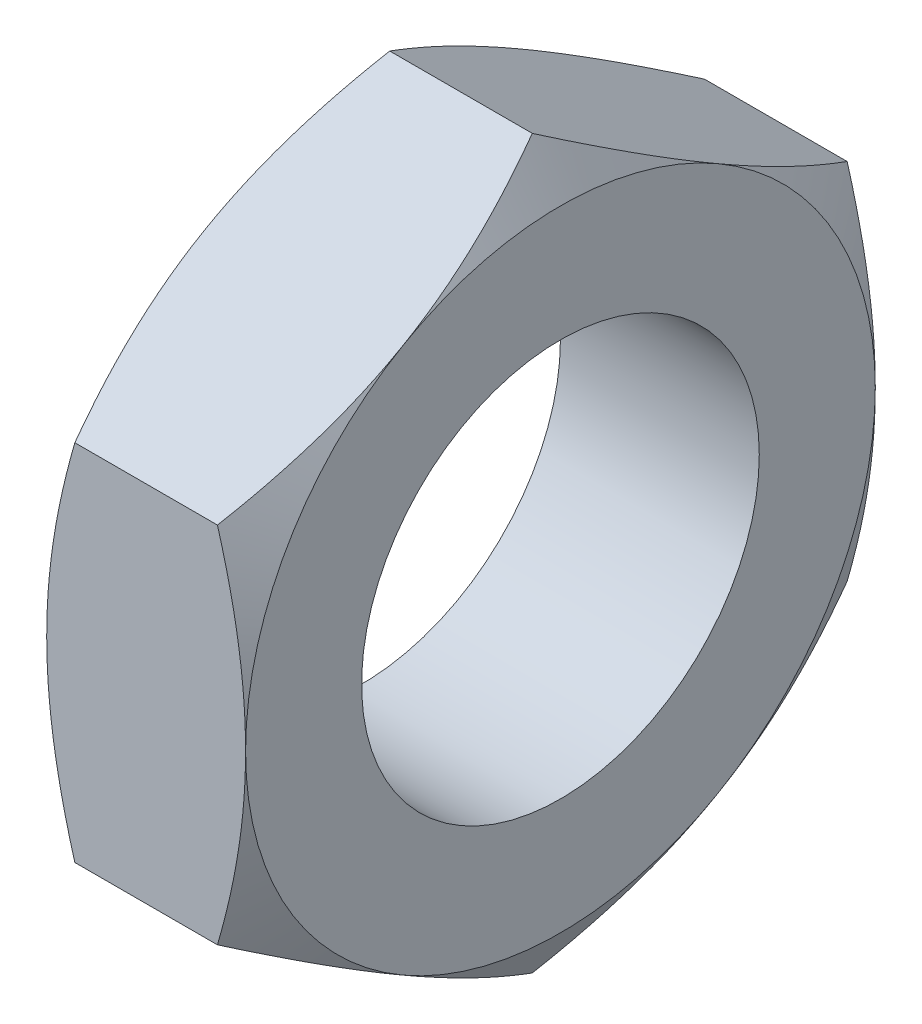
ISO-10303-21;
HEADER;
FILE_DESCRIPTION(('STEP AP214'),'2;1');
FILE_NAME('part.step','',(''),(''),'','','');
FILE_SCHEMA(('AUTOMOTIVE_DESIGN { 1 0 10303 214 1 1 1 1 }'));
ENDSEC;
DATA;
#1=APPLICATION_CONTEXT('core data for automotive mechanical design processes');
#2=APPLICATION_PROTOCOL_DEFINITION('international standard','automotive_design',2000,#1);
#3=PRODUCT_CONTEXT('',#1,'mechanical');
#4=PRODUCT('Part','Part','',(#3));
#5=PRODUCT_RELATED_PRODUCT_CATEGORY('part','',(#4));
#6=PRODUCT_DEFINITION_FORMATION('','',#4);
#7=PRODUCT_DEFINITION_CONTEXT('part definition',#1,'design');
#8=PRODUCT_DEFINITION('design','',#6,#7);
#9=PRODUCT_DEFINITION_SHAPE('','',#8);
#10=(LENGTH_UNIT() NAMED_UNIT(*) SI_UNIT(.MILLI.,.METRE.));
#11=(NAMED_UNIT(*) PLANE_ANGLE_UNIT() SI_UNIT($,.RADIAN.));
#12=(NAMED_UNIT(*) SI_UNIT($,.STERADIAN.) SOLID_ANGLE_UNIT());
#13=UNCERTAINTY_MEASURE_WITH_UNIT(LENGTH_MEASURE(1.E-05),#10,'distance_accuracy_value','');
#14=(GEOMETRIC_REPRESENTATION_CONTEXT(3) GLOBAL_UNCERTAINTY_ASSIGNED_CONTEXT((#13)) GLOBAL_UNIT_ASSIGNED_CONTEXT((#10,
#11,#12)) REPRESENTATION_CONTEXT('',''));
#15=CARTESIAN_POINT('',(0.,0.,0.));
#16=DIRECTION('',(0.,0.,1.));
#17=DIRECTION('',(1.,0.,0.));
#18=AXIS2_PLACEMENT_3D('',#15,#16,#17);
#19=CARTESIAN_POINT('',(0.84850577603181,0.,0.));
#20=DIRECTION('',(1.,0.,0.));
#21=DIRECTION('',(0.,-6.71256147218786E-08,1.));
#22=AXIS2_PLACEMENT_3D('',#19,#20,#21);
#23=CONICAL_SURFACE('',#22,10.9696551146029,1.04719755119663);
#24=CARTESIAN_POINT('',(0.,-8.22724137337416,4.74999993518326));
#25=CARTESIAN_POINT('',(5.07942469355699E-07,-8.19526239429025,4.8053917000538));
#26=CARTESIAN_POINT('',(0.000376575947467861,-8.16328674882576,4.86078524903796));
#27=CARTESIAN_POINT('',(0.00186036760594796,-8.09978574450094,4.97078227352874));
#28=CARTESIAN_POINT('',(0.00295771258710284,-8.06826038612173,5.02538588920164));
#29=CARTESIAN_POINT('',(0.00584245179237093,-8.00569772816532,5.13371409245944));
#30=CARTESIAN_POINT('',(0.00761875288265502,-7.97466052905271,5.18743903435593));
#31=CARTESIAN_POINT('',(0.0118203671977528,-7.91312322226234,5.29392084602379));
#32=CARTESIAN_POINT('',(0.0142338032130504,-7.8826232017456,5.34667823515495));
#33=CARTESIAN_POINT('',(0.0196882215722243,-7.82201161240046,5.45149640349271));
#34=CARTESIAN_POINT('',(0.0227209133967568,-7.79189999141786,5.5035575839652));
#35=CARTESIAN_POINT('',(0.0294434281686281,-7.73161938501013,5.60778160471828));
#36=CARTESIAN_POINT('',(0.0331349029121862,-7.70145044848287,5.65994436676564));
#37=CARTESIAN_POINT('',(0.0411836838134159,-7.64102156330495,5.76444261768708));
#38=CARTESIAN_POINT('',(0.0455435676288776,-7.6107617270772,5.81677797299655));
#39=CARTESIAN_POINT('',(0.0549373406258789,-7.55013376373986,5.92166241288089));
#40=CARTESIAN_POINT('',(0.0599743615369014,-7.51976581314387,5.97421131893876));
#41=CARTESIAN_POINT('',(0.0707303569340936,-7.45890188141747,6.07956317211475));
#42=CARTESIAN_POINT('',(0.0764530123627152,-7.42840614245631,6.13236588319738));
#43=CARTESIAN_POINT('',(0.0885804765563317,-7.36730538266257,6.2381956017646));
#44=CARTESIAN_POINT('',(0.0949886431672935,-7.3367006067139,6.29122236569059));
#45=CARTESIAN_POINT('',(0.108407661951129,-7.27574049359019,6.39687439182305));
#46=CARTESIAN_POINT('',(0.115414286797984,-7.24538483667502,6.44950000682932));
#47=CARTESIAN_POINT('',(0.129982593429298,-7.18500738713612,6.55419002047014));
#48=CARTESIAN_POINT('',(0.137538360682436,-7.15498516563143,6.60625499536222));
#49=CARTESIAN_POINT('',(0.153173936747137,-7.09527084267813,6.70981900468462));
#50=CARTESIAN_POINT('',(0.161248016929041,-7.06557833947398,6.7613186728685));
#51=CARTESIAN_POINT('',(0.17788915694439,-7.0065222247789,6.86374408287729));
#52=CARTESIAN_POINT('',(0.18645062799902,-6.97715823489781,6.91467051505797));
#53=CARTESIAN_POINT('',(0.204035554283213,-6.91876070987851,7.01593851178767));
#54=CARTESIAN_POINT('',(0.213053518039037,-6.88972681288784,7.06628082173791));
#55=CARTESIAN_POINT('',(0.231520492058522,-6.83199389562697,7.16636688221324));
#56=CARTESIAN_POINT('',(0.240964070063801,-6.80329452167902,7.21611143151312));
#57=CARTESIAN_POINT('',(0.260251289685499,-6.74623780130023,7.31498565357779));
#58=CARTESIAN_POINT('',(0.270089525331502,-6.71788010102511,7.36411617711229));
#59=CARTESIAN_POINT('',(0.290135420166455,-6.66151732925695,7.46174391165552));
#60=CARTESIAN_POINT('',(0.300337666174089,-6.63351188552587,7.51024201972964));
#61=CARTESIAN_POINT('',(0.321079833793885,-6.57786511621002,7.60658341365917));
#62=CARTESIAN_POINT('',(0.3316143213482,-6.55022340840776,7.65442764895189));
#63=CARTESIAN_POINT('',(0.352994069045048,-6.49532423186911,7.74944396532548));
#64=CARTESIAN_POINT('',(0.363833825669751,-6.46806626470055,7.79661699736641));
#65=CARTESIAN_POINT('',(0.385831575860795,-6.4138049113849,7.89047372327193));
#66=CARTESIAN_POINT('',(0.396986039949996,-6.3868013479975,7.93715814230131));
#67=CARTESIAN_POINT('',(0.419638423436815,-6.33296084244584,8.03020885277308));
#68=CARTESIAN_POINT('',(0.431134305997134,-6.30612375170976,8.07657555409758));
#69=CARTESIAN_POINT('',(0.454476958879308,-6.25260034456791,8.16905376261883));
#70=CARTESIAN_POINT('',(0.466322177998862,-6.22591384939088,8.21516555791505));
#71=CARTESIAN_POINT('',(0.490369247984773,-6.17266919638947,8.30719395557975));
#72=CARTESIAN_POINT('',(0.502570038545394,-6.14611088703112,8.3531107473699));
#73=CARTESIAN_POINT('',(0.527334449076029,-6.09309748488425,8.44480788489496));
#74=CARTESIAN_POINT('',(0.539897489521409,-6.06664229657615,8.49058833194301));
#75=CARTESIAN_POINT('',(0.56539248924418,-6.01380639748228,8.58206982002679));
#76=CARTESIAN_POINT('',(0.578324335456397,-5.98742566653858,8.62777088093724));
#77=CARTESIAN_POINT('',(0.604563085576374,-5.93470666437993,8.71914904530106));
#78=CARTESIAN_POINT('',(0.617870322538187,-5.90836845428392,8.7648260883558));
#79=CARTESIAN_POINT('',(0.644866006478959,-5.85569917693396,8.85621003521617));
#80=CARTESIAN_POINT('',(0.658555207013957,-5.82936824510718,8.90191679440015));
#81=CARTESIAN_POINT('',(0.686321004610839,-5.7766749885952,8.99341236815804));
#82=CARTESIAN_POINT('',(0.700398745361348,-5.75031285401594,9.03920094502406));
#83=CARTESIAN_POINT('',(0.728947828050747,-5.69751540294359,9.13091068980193));
#84=CARTESIAN_POINT('',(0.743420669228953,-5.67108029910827,9.17683151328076));
#85=CARTESIAN_POINT('',(0.772766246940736,-5.61809212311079,9.2688546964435));
#86=CARTESIAN_POINT('',(0.787640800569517,-5.59153924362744,9.31495658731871));
#87=CARTESIAN_POINT('',(0.817795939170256,-5.53826686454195,9.40738892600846));
#88=CARTESIAN_POINT('',(0.833078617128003,-5.51154747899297,9.45371875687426));
#89=CARTESIAN_POINT('',(0.848505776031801,-5.48482755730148,9.49999999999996));
#90=B_SPLINE_CURVE_WITH_KNOTS('',3,(#24,#25,#26,#27,#28,#29,#30,#31,#32,#33,#34,#35,#36,#37,#38,
#39,#40,#41,#42,#43,#44,#45,#46,#47,#48,#49,#50,#51,#52,#53,#54,#55,#56,#57,#58,#59,#60,#61,#62,
#63,#64,#65,#66,#67,#68,#69,#70,#71,#72,#73,#74,#75,#76,#77,#78,#79,#80,#81,#82,#83,#84,#85,#86,
#87,#88,#89),.UNSPECIFIED.,.F.,.F.,(4,2,2,2,2,2,2,2,2,2,2,2,2,2,2,2,2,2,2,2,2,2,2,2,2,2,2,2,2,2,
2,2,4),(0.,0.191879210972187,0.381056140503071,0.567265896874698,0.750223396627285,
0.930875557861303,1.11198720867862,1.29381573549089,1.47651616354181,1.66024554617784,
1.84492011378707,2.02838376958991,2.2101020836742,2.39007549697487,2.56829010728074,
2.74471821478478,2.91931889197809,3.09203857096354,3.26281164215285,3.43156105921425,
3.59820909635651,3.76342695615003,3.92780398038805,4.09153699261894,4.25482362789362,
4.41786213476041,4.58085118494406,4.74398969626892,4.90747667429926,5.07151107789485,
5.2362917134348,5.40201716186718,5.56888574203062),.UNSPECIFIED.);
#91=CARTESIAN_POINT('',(0.,-8.22724137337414,4.74999993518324));
#92=VERTEX_POINT('',#91);
#93=CARTESIAN_POINT('',(0.84850577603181,-5.48482755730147,9.5));
#94=VERTEX_POINT('',#93);
#95=EDGE_CURVE('E109',#92,#94,#90,.T.);
#96=ORIENTED_EDGE('',*,*,#95,.T.);
#97=CARTESIAN_POINT('',(0.848505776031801,-5.48482755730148,9.49999999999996));
#98=CARTESIAN_POINT('',(0.835570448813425,-5.44001820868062,9.50000001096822));
#99=CARTESIAN_POINT('',(0.8227448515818,-5.39517715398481,9.50000005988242));
#100=CARTESIAN_POINT('',(0.797326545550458,-5.30545984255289,9.50000017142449));
#101=CARTESIAN_POINT('',(0.784733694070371,-5.26058362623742,9.50000023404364));
#102=CARTESIAN_POINT('',(0.75978525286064,-5.17079387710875,9.50000031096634));
#103=CARTESIAN_POINT('',(0.747429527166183,-5.12588038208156,9.50000032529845));
#104=CARTESIAN_POINT('',(0.722959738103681,-5.03601357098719,9.50000030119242));
#105=CARTESIAN_POINT('',(0.710845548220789,-4.99106028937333,9.50000026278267));
#106=CARTESIAN_POINT('',(0.686863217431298,-4.90111098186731,9.50000014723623));
#107=CARTESIAN_POINT('',(0.674994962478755,-4.85611498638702,9.50000007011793));
#108=CARTESIAN_POINT('',(0.651508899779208,-4.76607689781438,9.49999993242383));
#109=CARTESIAN_POINT('',(0.639890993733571,-4.72103483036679,9.49999987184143));
#110=CARTESIAN_POINT('',(0.616909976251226,-4.63090081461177,9.49999972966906));
#111=CARTESIAN_POINT('',(0.605546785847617,-4.58580888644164,9.49999964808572));
#112=CARTESIAN_POINT('',(0.583079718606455,-4.49557087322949,9.49999975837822));
#113=CARTESIAN_POINT('',(0.571975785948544,-4.4504248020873,9.49999995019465));
#114=CARTESIAN_POINT('',(0.550031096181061,-4.36007391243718,9.49999957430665));
#115=CARTESIAN_POINT('',(0.539190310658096,-4.31486910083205,9.49999900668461));
#116=CARTESIAN_POINT('',(0.517778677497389,-4.22439708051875,9.50000086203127));
#117=CARTESIAN_POINT('',(0.507207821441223,-4.17912987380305,9.50000328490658));
#118=CARTESIAN_POINT('',(0.486355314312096,-4.08862788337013,9.49999551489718));
#119=CARTESIAN_POINT('',(0.476073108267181,-4.04339322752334,9.49998534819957));
#120=CARTESIAN_POINT('',(0.455809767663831,-3.95298469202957,9.49995569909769));
#121=CARTESIAN_POINT('',(0.445827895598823,-3.90781097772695,9.49993624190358));
#122=CARTESIAN_POINT('',(0.426165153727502,-3.81748889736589,9.49989627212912));
#123=CARTESIAN_POINT('',(0.416483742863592,-3.77234064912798,9.49987576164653));
#124=CARTESIAN_POINT('',(0.397420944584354,-3.68203411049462,9.49983849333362));
#125=CARTESIAN_POINT('',(0.388039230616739,-3.63687588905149,9.49982173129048));
#126=CARTESIAN_POINT('',(0.369575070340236,-3.54651380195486,9.4997955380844));
#127=CARTESIAN_POINT('',(0.360492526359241,-3.50130995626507,9.4997861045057));
#128=CARTESIAN_POINT('',(0.342625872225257,-3.41082087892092,9.49977630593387));
#129=CARTESIAN_POINT('',(0.333841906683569,-3.36553561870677,9.49977594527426));
#130=CARTESIAN_POINT('',(0.316571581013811,-3.27484781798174,9.49978433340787));
#131=CARTESIAN_POINT('',(0.308085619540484,-3.22944520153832,9.49979309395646));
#132=CARTESIAN_POINT('',(0.291410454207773,-3.13848665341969,9.49981799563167));
#133=CARTESIAN_POINT('',(0.28322191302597,-3.09293060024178,9.49983415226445));
#134=CARTESIAN_POINT('',(0.267140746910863,-3.0016290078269,9.4998703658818));
#135=CARTESIAN_POINT('',(0.259249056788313,-2.95588330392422,9.49989043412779));
#136=CARTESIAN_POINT('',(0.24376069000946,-2.86416612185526,9.49992908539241));
#137=CARTESIAN_POINT('',(0.236165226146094,-2.81819443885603,9.49994766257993));
#138=CARTESIAN_POINT('',(0.221268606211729,-2.72598887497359,9.49997646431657));
#139=CARTESIAN_POINT('',(0.213968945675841,-2.67975475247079,9.49998665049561));
#140=CARTESIAN_POINT('',(0.199679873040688,-2.58710076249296,9.49998856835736));
#141=CARTESIAN_POINT('',(0.192691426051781,-2.54068074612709,9.49998024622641));
#142=CARTESIAN_POINT('',(0.17908479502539,-2.44795291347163,9.49995997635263));
#143=CARTESIAN_POINT('',(0.172465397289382,-2.40164527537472,9.49994804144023));
#144=CARTESIAN_POINT('',(0.159597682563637,-2.30911897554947,9.49992571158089));
#145=CARTESIAN_POINT('',(0.153348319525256,-2.26290045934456,9.49991531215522));
#146=CARTESIAN_POINT('',(0.141218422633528,-2.17050568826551,9.49990026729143));
#147=CARTESIAN_POINT('',(0.135337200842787,-2.12432952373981,9.49989561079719));
#148=CARTESIAN_POINT('',(0.12394111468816,-2.03197272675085,9.49989358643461));
#149=CARTESIAN_POINT('',(0.118425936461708,-1.98579213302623,9.49989621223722));
#150=CARTESIAN_POINT('',(0.107759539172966,-1.89337970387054,9.49990814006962));
#151=CARTESIAN_POINT('',(0.102608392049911,-1.8471478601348,9.49991744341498));
#152=CARTESIAN_POINT('',(0.0926675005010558,-1.75458615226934,9.4999395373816));
#153=CARTESIAN_POINT('',(0.0878782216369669,-1.70825623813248,9.4999523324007));
#154=CARTESIAN_POINT('',(0.0786590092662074,-1.61545156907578,9.49997678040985));
#155=CARTESIAN_POINT('',(0.0742299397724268,-1.56897672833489,9.49998843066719));
#156=CARTESIAN_POINT('',(0.0657309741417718,-1.47587681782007,9.50000030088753));
#157=CARTESIAN_POINT('',(0.0616620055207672,-1.42925166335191,9.50000049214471));
#158=CARTESIAN_POINT('',(0.0539146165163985,-1.33610616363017,9.49999645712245));
#159=CARTESIAN_POINT('',(0.0502350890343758,-1.28958591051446,9.49999224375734));
#160=CARTESIAN_POINT('',(0.0432708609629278,-1.19668815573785,9.4999824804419));
#161=CARTESIAN_POINT('',(0.0399847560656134,-1.1503107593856,9.49997693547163));
#162=CARTESIAN_POINT('',(0.0338057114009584,-1.05768120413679,9.49996628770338));
#163=CARTESIAN_POINT('',(0.0309115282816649,-1.01142912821,9.49996118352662));
#164=CARTESIAN_POINT('',(0.0255147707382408,-0.919032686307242,9.49995279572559));
#165=CARTESIAN_POINT('',(0.0230111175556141,-0.872888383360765,9.49994950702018));
#166=CARTESIAN_POINT('',(0.0183938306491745,-0.780689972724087,9.49994548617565));
#167=CARTESIAN_POINT('',(0.0162792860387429,-0.734635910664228,9.49994474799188));
#168=CARTESIAN_POINT('',(0.0124386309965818,-0.642600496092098,9.49994598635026));
#169=CARTESIAN_POINT('',(0.0107117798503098,-0.59661917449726,9.4999479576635));
#170=CARTESIAN_POINT('',(0.00764492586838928,-0.50471180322,9.49995418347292));
#171=CARTESIAN_POINT('',(0.00630435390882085,-0.458785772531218,9.49995843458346));
#172=CARTESIAN_POINT('',(0.00400845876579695,-0.366971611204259,9.49996819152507));
#173=CARTESIAN_POINT('',(0.00305273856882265,-0.32108349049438,9.49997369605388));
#174=CARTESIAN_POINT('',(0.00152499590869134,-0.229327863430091,9.49998438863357));
#175=CARTESIAN_POINT('',(0.000952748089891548,-0.183460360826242,9.4999895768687));
#176=CARTESIAN_POINT('',(0.000190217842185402,-0.091728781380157,9.4999973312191));
#177=CARTESIAN_POINT('',(-1.19550571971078E-07,-0.0458647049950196,9.49999989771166));
#178=CARTESIAN_POINT('',(0.,-6.37693339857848E-07,9.50000000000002));
#179=B_SPLINE_CURVE_WITH_KNOTS('',3,(#97,#98,#99,#100,#101,#102,#103,#104,#105,#106,#107,#108,
#109,#110,#111,#112,#113,#114,#115,#116,#117,#118,#119,#120,#121,#122,#123,#124,#125,#126,#127,
#128,#129,#130,#131,#132,#133,#134,#135,#136,#137,#138,#139,#140,#141,#142,#143,#144,#145,#146,
#147,#148,#149,#150,#151,#152,#153,#154,#155,#156,#157,#158,#159,#160,#161,#162,#163,#164,#165,
#166,#167,#168,#169,#170,#171,#172,#173,#174,#175,#176,#177,#178),.UNSPECIFIED.,.F.,.F.,(4,2,2,
2,2,2,2,2,2,2,2,2,2,2,2,2,2,2,2,2,2,2,2,2,2,2,2,2,2,2,2,2,2,2,2,2,2,2,2,2,4),(0.,
0.139917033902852,0.279745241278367,0.419490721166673,0.559160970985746,0.698764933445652,
0.838313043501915,0.977817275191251,1.11729118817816,1.25674997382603,1.3962044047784,
1.53536924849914,1.6741585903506,1.81268149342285,1.9510479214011,2.0893687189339,
2.22775558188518,2.36632101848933,2.50517830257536,2.64444142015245,2.78422501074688,
2.9246443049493,3.06547240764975,3.20580612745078,3.34572207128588,3.4853682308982,
3.6248930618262,3.76444538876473,3.9041743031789,4.04422905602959,4.1846346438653,
4.32462971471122,4.46410915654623,4.60313518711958,4.74177011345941,4.88007625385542,
5.01811585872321,5.15595103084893,5.29364364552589,5.43125527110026,5.56884709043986),.UNSPECIFIED.);
#180=CARTESIAN_POINT('',(0.,-6.37693339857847E-07,9.5));
#181=VERTEX_POINT('',#180);
#182=EDGE_CURVE('E125',#94,#181,#179,.T.);
#183=ORIENTED_EDGE('',*,*,#182,.T.);
#184=CARTESIAN_POINT('',(0.,0.,0.));
#185=DIRECTION('',(1.,0.,0.));
#186=DIRECTION('',(0.,-6.71256147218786E-08,1.));
#187=AXIS2_PLACEMENT_3D('',#184,#185,#186);
#188=CIRCLE('',#187,9.5);
#189=EDGE_CURVE('E128',#181,#92,#188,.T.);
#190=ORIENTED_EDGE('',*,*,#189,.T.);
#191=EDGE_LOOP('',(#96,#183,#190));
#192=FACE_BOUND('',#191,.T.);
#193=ADVANCED_FACE('F15',(#192),#23,.T.);
#194=CARTESIAN_POINT('',(0.848505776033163,0.,0.));
#195=DIRECTION('',(1.,0.,0.));
#196=DIRECTION('',(0.,0.866025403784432,0.500000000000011));
#197=AXIS2_PLACEMENT_3D('',#194,#195,#196);
#198=CONICAL_SURFACE('',#197,10.9696551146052,1.04719755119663);
#199=CARTESIAN_POINT('',(0.,0.,0.));
#200=DIRECTION('',(1.,0.,0.));
#201=DIRECTION('',(0.,0.866025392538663,0.500000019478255));
#202=AXIS2_PLACEMENT_3D('',#199,#200,#201);
#203=CIRCLE('',#202,9.5);
#204=CARTESIAN_POINT('',(0.,8.22724122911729,4.75000018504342));
#205=VERTEX_POINT('',#204);
#206=EDGE_CURVE('E507',#205,#181,#203,.T.);
#207=ORIENTED_EDGE('',*,*,#206,.T.);
#208=CARTESIAN_POINT('',(0.,-6.37693343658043E-07,9.5));
#209=CARTESIAN_POINT('',(-1.69330841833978E-07,0.0484894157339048,9.49999984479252));
#210=CARTESIAN_POINT('',(0.000212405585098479,0.0969794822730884,9.49999665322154));
#211=CARTESIAN_POINT('',(0.00106432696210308,0.193963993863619,9.49998725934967));
#212=CARTESIAN_POINT('',(0.00170374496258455,0.242458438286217,9.49998105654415));
#213=CARTESIAN_POINT('',(0.00341124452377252,0.339474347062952,9.49996869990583));
#214=CARTESIAN_POINT('',(0.00447963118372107,0.387995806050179,9.49996254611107));
#215=CARTESIAN_POINT('',(0.00704670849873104,0.485088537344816,9.49995224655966));
#216=CARTESIAN_POINT('',(0.00854593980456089,0.53365979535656,9.49994810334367));
#217=CARTESIAN_POINT('',(0.01197640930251,0.630875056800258,9.49994296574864));
#218=CARTESIAN_POINT('',(0.0139084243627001,0.679519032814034,9.49994197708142));
#219=CARTESIAN_POINT('',(0.0182061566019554,0.776902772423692,9.49994341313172));
#220=CARTESIAN_POINT('',(0.0205728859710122,0.825642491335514,9.49994584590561));
#221=CARTESIAN_POINT('',(0.0257417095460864,0.923240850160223,9.49995344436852));
#222=CARTESIAN_POINT('',(0.0285450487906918,0.972099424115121,9.49995861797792));
#223=CARTESIAN_POINT('',(0.0345889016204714,1.06995867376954,9.49997039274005));
#224=CARTESIAN_POINT('',(0.0378308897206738,1.11895925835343,9.499976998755));
#225=CARTESIAN_POINT('',(0.0447533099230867,1.21712580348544,9.49998848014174));
#226=CARTESIAN_POINT('',(0.0484354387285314,1.26629164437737,9.49999334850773));
#227=CARTESIAN_POINT('',(0.0562339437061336,1.36471691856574,9.50000094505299));
#228=CARTESIAN_POINT('',(0.0603514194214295,1.41397626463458,9.50000366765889));
#229=CARTESIAN_POINT('',(0.0689410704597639,1.51188626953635,9.49997639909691));
#230=CARTESIAN_POINT('',(0.073408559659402,1.56053733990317,9.49994678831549));
#231=CARTESIAN_POINT('',(0.0826832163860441,1.65713719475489,9.49987696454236));
#232=CARTESIAN_POINT('',(0.0874849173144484,1.70508650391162,9.49983690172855));
#233=CARTESIAN_POINT('',(0.097421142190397,1.80034913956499,9.49975852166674));
#234=CARTESIAN_POINT('',(0.102550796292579,1.84766297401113,9.49972018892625));
#235=CARTESIAN_POINT('',(0.113136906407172,1.94172027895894,9.49965497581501));
#236=CARTESIAN_POINT('',(0.118589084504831,1.98846423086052,9.49962797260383));
#237=CARTESIAN_POINT('',(0.129813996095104,2.08144676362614,9.4995907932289));
#238=CARTESIAN_POINT('',(0.135583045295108,2.12768578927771,9.49958045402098));
#239=CARTESIAN_POINT('',(0.147435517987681,2.21972281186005,9.49957829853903));
#240=CARTESIAN_POINT('',(0.153515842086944,2.26552120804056,9.4995863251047));
#241=CARTESIAN_POINT('',(0.165984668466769,2.35674066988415,9.49961890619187));
#242=CARTESIAN_POINT('',(0.172370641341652,2.40216208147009,9.49964334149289));
#243=CARTESIAN_POINT('',(0.185444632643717,2.49269062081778,9.49970331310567));
#244=CARTESIAN_POINT('',(0.192130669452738,2.53779803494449,9.49973878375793));
#245=CARTESIAN_POINT('',(0.205798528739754,2.62776101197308,9.49981171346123));
#246=CARTESIAN_POINT('',(0.212778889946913,2.6726167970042,9.49984916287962));
#247=CARTESIAN_POINT('',(0.227029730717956,2.76213822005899,9.49991468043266));
#248=CARTESIAN_POINT('',(0.234299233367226,2.80680401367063,9.49994277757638));
#249=CARTESIAN_POINT('',(0.249120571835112,2.89600644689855,9.49997112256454));
#250=CARTESIAN_POINT('',(0.256671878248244,2.94054317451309,9.49997142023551));
#251=CARTESIAN_POINT('',(0.272031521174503,3.02939974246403,9.49993718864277));
#252=CARTESIAN_POINT('',(0.279838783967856,3.07371976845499,9.49990279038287));
#253=CARTESIAN_POINT('',(0.295700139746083,3.16206895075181,9.49981971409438));
#254=CARTESIAN_POINT('',(0.303752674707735,3.2060983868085,9.49977111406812));
#255=CARTESIAN_POINT('',(0.320106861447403,3.29390609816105,9.49966802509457));
#256=CARTESIAN_POINT('',(0.328407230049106,3.33768461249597,9.49961356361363));
#257=CARTESIAN_POINT('',(0.345260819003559,3.42503014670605,9.49950778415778));
#258=CARTESIAN_POINT('',(0.353813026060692,3.46859736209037,9.49945645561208));
#259=CARTESIAN_POINT('',(0.371173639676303,3.55556021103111,9.49936323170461));
#260=CARTESIAN_POINT('',(0.379981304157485,3.59895599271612,9.49932131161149));
#261=CARTESIAN_POINT('',(0.397856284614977,3.68561602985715,9.49925139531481));
#262=CARTESIAN_POINT('',(0.40692312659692,3.7288803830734,9.49922337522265));
#263=CARTESIAN_POINT('',(0.425319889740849,3.81531776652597,9.49918373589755));
#264=CARTESIAN_POINT('',(0.434649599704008,3.85849084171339,9.49917210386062));
#265=CARTESIAN_POINT('',(0.453575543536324,3.94478599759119,9.49916580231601));
#266=CARTESIAN_POINT('',(0.463171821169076,3.98790806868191,9.49917113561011));
#267=CARTESIAN_POINT('',(0.482634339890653,4.07414166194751,9.49919738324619));
#268=CARTESIAN_POINT('',(0.492500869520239,4.11725311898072,9.49921831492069));
#269=CARTESIAN_POINT('',(0.512507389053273,4.20350601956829,9.49927257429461));
#270=CARTESIAN_POINT('',(0.522647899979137,4.2466473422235,9.49930592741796));
#271=CARTESIAN_POINT('',(0.543205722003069,4.33300064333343,9.49937960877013));
#272=CARTESIAN_POINT('',(0.553623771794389,4.37621244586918,9.4994199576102));
#273=CARTESIAN_POINT('',(0.574740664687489,4.46274729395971,9.49950164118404));
#274=CARTESIAN_POINT('',(0.585440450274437,4.50607010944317,9.49954297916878));
#275=CARTESIAN_POINT('',(0.607122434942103,4.59286826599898,9.49961385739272));
#276=CARTESIAN_POINT('',(0.61810575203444,4.63634332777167,9.49964333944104));
#277=CARTESIAN_POINT('',(0.640386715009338,4.72356831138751,9.49969438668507));
#278=CARTESIAN_POINT('',(0.651686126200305,4.76731778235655,9.49971588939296));
#279=CARTESIAN_POINT('',(0.674631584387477,4.85519022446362,9.49976260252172));
#280=CARTESIAN_POINT('',(0.686279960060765,4.89931258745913,9.49978784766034));
#281=CARTESIAN_POINT('',(0.709926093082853,4.9879438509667,9.4998365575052));
#282=CARTESIAN_POINT('',(0.721926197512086,5.03245212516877,9.49986000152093));
#283=CARTESIAN_POINT('',(0.746280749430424,5.12186771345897,9.49990385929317));
#284=CARTESIAN_POINT('',(0.758637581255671,5.16677437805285,9.49992423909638));
#285=CARTESIAN_POINT('',(0.783709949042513,5.25699942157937,9.49995919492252));
#286=CARTESIAN_POINT('',(0.796427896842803,5.30231713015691,9.49997370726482));
#287=CARTESIAN_POINT('',(0.822227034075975,5.39337693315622,9.49999413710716));
#288=CARTESIAN_POINT('',(0.835310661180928,5.43911833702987,9.49999996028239));
#289=CARTESIAN_POINT('',(0.848505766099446,5.48482752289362,9.50000000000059));
#290=B_SPLINE_CURVE_WITH_KNOTS('',3,(#208,#209,#210,#211,#212,#213,#214,#215,#216,#217,#218,
#219,#220,#221,#222,#223,#224,#225,#226,#227,#228,#229,#230,#231,#232,#233,#234,#235,#236,#237,
#238,#239,#240,#241,#242,#243,#244,#245,#246,#247,#248,#249,#250,#251,#252,#253,#254,#255,#256,
#257,#258,#259,#260,#261,#262,#263,#264,#265,#266,#267,#268,#269,#270,#271,#272,#273,#274,#275,
#276,#277,#278,#279,#280,#281,#282,#283,#284,#285,#286,#287,#288,#289),.UNSPECIFIED.,.F.,.F.,(4,
2,2,2,2,2,2,2,2,2,2,2,2,2,2,2,2,2,2,2,2,2,2,2,2,2,2,2,2,2,2,2,2,2,2,2,2,2,2,2,4),(0.,
0.145469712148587,0.2909638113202,0.436561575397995,0.582342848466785,0.728387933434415,
0.874777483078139,1.02159239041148,1.16891367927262,1.31682239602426,1.46511403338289,
1.61167970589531,1.75624552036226,1.89901726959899,2.04019829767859,2.17998940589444,
2.31858876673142,2.45619185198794,2.59299138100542,2.72917729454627,2.86493675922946,
3.00045289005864,3.1354592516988,3.26973760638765,3.40341208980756,3.53660728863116,
3.66944815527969,3.80205992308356,3.93456802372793,4.06709800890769,4.19977547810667,
4.3327260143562,4.46607512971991,4.59994822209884,4.73447059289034,4.87002525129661,
5.00692681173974,5.14521901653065,5.28494564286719,5.42615047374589,5.56887727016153),.UNSPECIFIED.);
#291=CARTESIAN_POINT('',(0.848505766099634,5.48482752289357,9.5));
#292=VERTEX_POINT('',#291);
#293=EDGE_CURVE('E136',#181,#292,#290,.T.);
#294=ORIENTED_EDGE('',*,*,#293,.T.);
#295=CARTESIAN_POINT('',(0.848505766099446,5.48482752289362,9.50000000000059));
#296=CARTESIAN_POINT('',(0.835046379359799,5.50813984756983,9.45962180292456));
#297=CARTESIAN_POINT('',(0.821702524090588,5.53146280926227,9.41921118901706));
#298=CARTESIAN_POINT('',(0.795405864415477,5.57786419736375,9.33879243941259));
#299=CARTESIAN_POINT('',(0.782450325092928,5.60094234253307,9.29878503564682));
#300=CARTESIAN_POINT('',(0.756924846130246,5.64686441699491,9.21916191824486));
#301=CARTESIAN_POINT('',(0.744352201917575,5.66970804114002,9.17954689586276));
#302=CARTESIAN_POINT('',(0.719587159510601,5.71517113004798,9.10069766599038));
#303=CARTESIAN_POINT('',(0.707392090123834,5.73779026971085,9.06146411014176));
#304=CARTESIAN_POINT('',(0.683376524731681,5.78281349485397,8.98336654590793));
#305=CARTESIAN_POINT('',(0.671553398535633,5.80521724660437,8.94450315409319));
#306=CARTESIAN_POINT('',(0.648277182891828,5.84982059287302,8.86713543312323));
#307=CARTESIAN_POINT('',(0.636821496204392,5.872019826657,8.82863167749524));
#308=CARTESIAN_POINT('',(0.614254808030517,5.91624925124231,8.75191272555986));
#309=CARTESIAN_POINT('',(0.603141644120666,5.93827918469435,8.71369801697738));
#310=CARTESIAN_POINT('',(0.581227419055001,5.98222544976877,8.63745411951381));
#311=CARTESIAN_POINT('',(0.570424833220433,6.00414162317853,8.59942527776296));
#312=CARTESIAN_POINT('',(0.549128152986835,6.04788756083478,8.52352569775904));
#313=CARTESIAN_POINT('',(0.53863269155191,6.06971713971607,8.48565523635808));
#314=CARTESIAN_POINT('',(0.517944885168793,6.11331170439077,8.4100432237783));
#315=CARTESIAN_POINT('',(0.507751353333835,6.13507651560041,8.37230189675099));
#316=CARTESIAN_POINT('',(0.487662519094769,6.17856282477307,8.29691865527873));
#317=CARTESIAN_POINT('',(0.477766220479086,6.20028416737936,8.25927691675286));
#318=CARTESIAN_POINT('',(0.458266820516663,6.24370307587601,8.18406255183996));
#319=CARTESIAN_POINT('',(0.448662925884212,6.26540051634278,8.14649005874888));
#320=CARTESIAN_POINT('',(0.429743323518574,6.30878972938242,8.07138322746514));
#321=CARTESIAN_POINT('',(0.420427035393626,6.33048141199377,8.03384898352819));
#322=CARTESIAN_POINT('',(0.402077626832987,6.37387572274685,7.95878702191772));
#323=CARTESIAN_POINT('',(0.393044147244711,6.39557829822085,7.92125936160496));
#324=CARTESIAN_POINT('',(0.375255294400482,6.43900944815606,7.84617825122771));
#325=CARTESIAN_POINT('',(0.366499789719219,6.46073800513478,7.80862482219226));
#326=CARTESIAN_POINT('',(0.349261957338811,6.50423489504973,7.73345931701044));
#327=CARTESIAN_POINT('',(0.340779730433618,6.52600323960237,7.69584722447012));
#328=CARTESIAN_POINT('',(0.324083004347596,6.56959107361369,7.62053049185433));
#329=CARTESIAN_POINT('',(0.315868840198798,6.59141059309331,7.58282579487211));
#330=CARTESIAN_POINT('',(0.299704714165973,6.63511391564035,7.50729081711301));
#331=CARTESIAN_POINT('',(0.291755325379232,6.6569977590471,7.46946043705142));
#332=CARTESIAN_POINT('',(0.276109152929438,6.70083037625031,7.3936315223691));
#333=CARTESIAN_POINT('',(0.268413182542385,6.7227791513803,7.35563282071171));
#334=CARTESIAN_POINT('',(0.253277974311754,6.76676749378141,7.27943631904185));
#335=CARTESIAN_POINT('',(0.245839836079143,6.78880708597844,7.24123831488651));
#336=CARTESIAN_POINT('',(0.231228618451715,6.83300683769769,7.16461559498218));
#337=CARTESIAN_POINT('',(0.224056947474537,6.85516707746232,7.12619065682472));
#338=CARTESIAN_POINT('',(0.209985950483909,6.899634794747,7.04908396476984));
#339=CARTESIAN_POINT('',(0.203088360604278,6.92194240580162,7.01040197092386));
#340=CARTESIAN_POINT('',(0.189573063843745,6.96673058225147,6.93274954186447));
#341=CARTESIAN_POINT('',(0.182957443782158,6.98921133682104,6.89377885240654));
#342=CARTESIAN_POINT('',(0.170013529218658,7.03436992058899,6.81551556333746));
#343=CARTESIAN_POINT('',(0.163687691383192,7.05704798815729,6.77622269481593));
#344=CARTESIAN_POINT('',(0.151330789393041,7.10262383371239,6.69727976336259));
#345=CARTESIAN_POINT('',(0.145302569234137,7.12552188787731,6.65762941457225));
#346=CARTESIAN_POINT('',(0.133548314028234,7.17155872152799,6.57793433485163));
#347=CARTESIAN_POINT('',(0.127825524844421,7.19469779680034,6.53788929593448));
#348=CARTESIAN_POINT('',(0.116689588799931,7.2412361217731,6.45736575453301));
#349=CARTESIAN_POINT('',(0.111280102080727,7.2646356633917,6.41688691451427));
#350=CARTESIAN_POINT('',(0.100777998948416,7.31171228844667,6.33545451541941));
#351=CARTESIAN_POINT('',(0.0956894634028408,7.3353896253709,6.29450057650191));
#352=CARTESIAN_POINT('',(0.0858373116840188,7.3830386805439,6.21207533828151));
#353=CARTESIAN_POINT('',(0.0810782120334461,7.40701059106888,6.17060361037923));
#354=CARTESIAN_POINT('',(0.0718951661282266,7.45523076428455,6.08714397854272));
#355=CARTESIAN_POINT('',(0.0674756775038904,7.47947905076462,6.04515559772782));
#356=CARTESIAN_POINT('',(0.0590444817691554,7.52798065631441,5.96115400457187));
#357=CARTESIAN_POINT('',(0.0550326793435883,7.55223397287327,5.91914080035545));
#358=CARTESIAN_POINT('',(0.0474342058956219,7.60067996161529,5.83521396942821));
#359=CARTESIAN_POINT('',(0.0438462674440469,7.62487259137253,5.79330043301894));
#360=CARTESIAN_POINT('',(0.0370947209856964,7.67320928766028,5.70955632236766));
#361=CARTESIAN_POINT('',(0.0339300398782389,7.69735331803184,5.66772581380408));
#362=CARTESIAN_POINT('',(0.0280245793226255,7.74560492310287,5.58413095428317));
#363=CARTESIAN_POINT('',(0.025282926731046,7.76971246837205,5.54236664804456));
#364=CARTESIAN_POINT('',(0.0202229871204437,7.81790247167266,5.45888682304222));
#365=CARTESIAN_POINT('',(0.0179040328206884,7.84198490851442,5.41717133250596));
#366=CARTESIAN_POINT('',(0.0136889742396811,7.89013550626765,5.33377132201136));
#367=CARTESIAN_POINT('',(0.0117924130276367,7.91420365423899,5.29208681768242));
#368=CARTESIAN_POINT('',(0.00842161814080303,7.96233586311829,5.2087305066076));
#369=CARTESIAN_POINT('',(0.00694714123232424,7.98639991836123,5.16705870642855));
#370=CARTESIAN_POINT('',(0.0044199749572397,8.03453349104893,5.0837090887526));
#371=CARTESIAN_POINT('',(0.0033672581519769,8.05860300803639,5.04203127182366));
#372=CARTESIAN_POINT('',(0.00168313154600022,8.10675645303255,4.95865051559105));
#373=CARTESIAN_POINT('',(0.00105191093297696,8.13084038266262,4.91694757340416));
#374=CARTESIAN_POINT('',(0.000210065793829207,8.17903076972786,4.833496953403));
#375=CARTESIAN_POINT('',(-1.53564711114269E-07,8.20313722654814,4.79174927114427));
#376=CARTESIAN_POINT('',(0.,8.22724122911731,4.75000018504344));
#377=B_SPLINE_CURVE_WITH_KNOTS('',3,(#295,#296,#297,#298,#299,#300,#301,#302,#303,#304,#305,
#306,#307,#308,#309,#310,#311,#312,#313,#314,#315,#316,#317,#318,#319,#320,#321,#322,#323,#324,
#325,#326,#327,#328,#329,#330,#331,#332,#333,#334,#335,#336,#337,#338,#339,#340,#341,#342,#343,
#344,#345,#346,#347,#348,#349,#350,#351,#352,#353,#354,#355,#356,#357,#358,#359,#360,#361,#362,
#363,#364,#365,#366,#367,#368,#369,#370,#371,#372,#373,#374,#375,#376),.UNSPECIFIED.,.F.,.F.,(4,
2,2,2,2,2,2,2,2,2,2,2,2,2,2,2,2,2,2,2,2,2,2,2,2,2,2,2,2,2,2,2,2,2,2,2,2,2,2,2,4),(0.,
0.14558550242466,0.289492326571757,0.431770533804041,0.572470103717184,0.711640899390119,
0.849332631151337,0.985796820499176,1.12140167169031,1.2562627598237,1.3904938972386,
1.52420878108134,1.6575209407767,1.79054367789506,1.92338999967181,2.05617254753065,
2.18900352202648,2.32199460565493,2.45525696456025,2.58891196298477,2.72308031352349,
2.8578785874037,2.99342641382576,3.12984654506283,3.26726490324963,3.40581060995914,
3.54561599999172,3.6868166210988,3.8295512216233,3.97396172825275,4.12002449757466,
4.26605303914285,4.4116332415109,4.55683705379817,4.70173703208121,4.84640624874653,
4.99091819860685,5.1353467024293,5.27976580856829,5.42424969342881,5.5688725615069),.UNSPECIFIED.);
#378=EDGE_CURVE('E503',#292,#205,#377,.T.);
#379=ORIENTED_EDGE('',*,*,#378,.T.);
#380=EDGE_LOOP('',(#207,#294,#379));
#381=FACE_BOUND('',#380,.T.);
#382=ADVANCED_FACE('F482',(#381),#198,.T.);
#383=CARTESIAN_POINT('',(0.848505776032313,0.,0.));
#384=DIRECTION('',(1.,0.,0.));
#385=DIRECTION('',(0.,0.866025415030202,-0.499999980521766));
#386=AXIS2_PLACEMENT_3D('',#383,#384,#385);
#387=CONICAL_SURFACE('',#386,10.9696551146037,1.04719755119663);
#388=CARTESIAN_POINT('',(0.848505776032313,10.9696551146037,5.73010831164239E-13));
#389=CARTESIAN_POINT('',(0.835046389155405,10.9463427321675,-0.0403781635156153));
#390=CARTESIAN_POINT('',(0.821702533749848,10.9230075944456,-0.080781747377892));
#391=CARTESIAN_POINT('',(0.795405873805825,10.8765636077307,-0.16117590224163));
#392=CARTESIAN_POINT('',(0.782450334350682,10.8534552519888,-0.201165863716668));
#393=CARTESIAN_POINT('',(0.756924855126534,10.8074606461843,-0.280747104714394));
#394=CARTESIAN_POINT('',(0.744352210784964,10.7845748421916,-0.320337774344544));
#395=CARTESIAN_POINT('',(0.719587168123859,10.7390209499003,-0.399134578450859));
#396=CARTESIAN_POINT('',(0.707392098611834,10.7163532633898,-0.438340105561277));
#397=CARTESIAN_POINT('',(0.683376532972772,10.6712304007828,-0.516380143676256));
#398=CARTESIAN_POINT('',(0.671553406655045,10.6487755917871,-0.555214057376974));
#399=CARTESIAN_POINT('',(0.64827719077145,10.6040748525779,-0.632525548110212));
#400=CARTESIAN_POINT('',(0.636821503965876,10.5818292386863,-0.671002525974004));
#401=CARTESIAN_POINT('',(0.614254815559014,10.5375033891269,-0.747665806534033));
#402=CARTESIAN_POINT('',(0.603141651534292,10.5154234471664,-0.785851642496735));
#403=CARTESIAN_POINT('',(0.581227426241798,10.4713674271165,-0.86203217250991));
#404=CARTESIAN_POINT('',(0.570424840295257,10.4493915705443,-0.900026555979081));
#405=CARTESIAN_POINT('',(0.54912815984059,10.4055335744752,-0.97586143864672));
#406=CARTESIAN_POINT('',(0.538632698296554,10.3836515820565,-1.01370163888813));
#407=CARTESIAN_POINT('',(0.517944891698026,10.3399669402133,-1.08926164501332));
#408=CARTESIAN_POINT('',(0.507751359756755,10.3181643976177,-1.12698118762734));
#409=CARTESIAN_POINT('',(0.487662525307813,10.2746237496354,-1.20233305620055));
#410=CARTESIAN_POINT('',(0.477766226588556,10.2528857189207,-1.23996515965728));
#411=CARTESIAN_POINT('',(0.458266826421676,10.2094576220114,-1.31517421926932));
#412=CARTESIAN_POINT('',(0.448662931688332,10.1877676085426,-1.35275100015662));
#413=CARTESIAN_POINT('',(0.429743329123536,10.1444177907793,-1.42788057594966));
#414=CARTESIAN_POINT('',(0.420427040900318,10.1227580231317,-1.46543324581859));
#415=CARTESIAN_POINT('',(0.402077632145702,10.079449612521,-1.54054480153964));
#416=CARTESIAN_POINT('',(0.39304415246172,10.0578009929,-1.57810361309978));
#417=CARTESIAN_POINT('',(0.375255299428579,10.0144944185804,-1.65325664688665));
#418=CARTESIAN_POINT('',(0.366499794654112,9.99283647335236,-1.69085084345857));
#419=CARTESIAN_POINT('',(0.34926196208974,9.94948968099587,-1.76610300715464));
#420=CARTESIAN_POINT('',(0.340779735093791,9.92780082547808,-1.80376099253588));
#421=CARTESIAN_POINT('',(0.324083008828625,9.88436853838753,-1.87916752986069));
#422=CARTESIAN_POINT('',(0.315868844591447,9.86262507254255,-1.91691613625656));
#423=CARTESIAN_POINT('',(0.29970471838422,9.81906152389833,-1.99253181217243));
#424=CARTESIAN_POINT('',(0.291755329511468,9.79724137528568,-2.03039896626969));
#425=CARTESIAN_POINT('',(0.276109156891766,9.75348791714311,-2.10627358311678));
#426=CARTESIAN_POINT('',(0.268413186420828,9.73155446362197,-2.14428113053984));
#427=CARTESIAN_POINT('',(0.253277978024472,9.6875605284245,-2.22047440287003));
#428=CARTESIAN_POINT('',(0.245839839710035,9.66549988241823,-2.25866025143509));
#429=CARTESIAN_POINT('',(0.231228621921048,9.62124253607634,-2.33524971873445));
#430=CARTESIAN_POINT('',(0.224056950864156,9.59904568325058,-2.37365351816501));
#431=CARTESIAN_POINT('',(0.209985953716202,9.5545031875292,-2.45071703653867));
#432=CARTESIAN_POINT('',(0.203088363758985,9.53215740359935,-2.48937699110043));
#433=CARTESIAN_POINT('',(0.189573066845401,9.48730251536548,-2.56699090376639));
#434=CARTESIAN_POINT('',(0.18295744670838,9.46479328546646,-2.60594515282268));
#435=CARTESIAN_POINT('',(0.170013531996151,9.41959458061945,-2.68418527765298));
#436=CARTESIAN_POINT('',(0.163687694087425,9.39690499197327,-2.72347149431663));
#437=CARTESIAN_POINT('',(0.151330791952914,9.35132633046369,-2.80241279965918));
#438=CARTESIAN_POINT('',(0.145302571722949,9.32843714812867,-2.84206827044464));
#439=CARTESIAN_POINT('',(0.133548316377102,9.28243760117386,-2.92178487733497));
#440=CARTESIAN_POINT('',(0.12782552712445,9.25932711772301,-2.96184642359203));
#441=CARTESIAN_POINT('',(0.116689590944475,9.21286084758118,-3.04241156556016));
#442=CARTESIAN_POINT('',(0.111280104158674,9.18950491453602,-3.08291558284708));
#443=CARTESIAN_POINT('',(0.100778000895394,9.14252070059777,-3.16440133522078));
#444=CARTESIAN_POINT('',(0.0956894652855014,9.11889221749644,-3.20538347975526));
#445=CARTESIAN_POINT('',(0.085837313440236,9.07133439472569,-3.28786139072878));
#446=CARTESIAN_POINT('',(0.0810782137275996,9.04740478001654,-3.32935753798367));
#447=CARTESIAN_POINT('',(0.0718951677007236,8.9992367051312,-3.41284724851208));
#448=CARTESIAN_POINT('',(0.0674756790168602,8.97499784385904,-3.45484107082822));
#449=CARTESIAN_POINT('',(0.059044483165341,8.92650113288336,-3.53884548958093));
#450=CARTESIAN_POINT('',(0.0550326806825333,8.90224328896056,-3.58085607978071));
#451=CARTESIAN_POINT('',(0.0474342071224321,8.85378351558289,-3.66477495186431));
#452=CARTESIAN_POINT('',(0.0438462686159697,8.82958164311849,-3.7066831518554));
#453=CARTESIAN_POINT('',(0.0370947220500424,8.78122546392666,-3.79041601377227));
#454=CARTESIAN_POINT('',(0.0339300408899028,8.75707119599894,-3.83224061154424));
#455=CARTESIAN_POINT('',(0.0280245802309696,8.70880172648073,-3.91582515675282));
#456=CARTESIAN_POINT('',(0.0252829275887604,8.68468654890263,-3.95758505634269));
#457=CARTESIAN_POINT('',(0.0202229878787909,8.63648590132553,-4.04105873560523));
#458=CARTESIAN_POINT('',(0.0179040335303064,8.61240044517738,-4.08277248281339));
#459=CARTESIAN_POINT('',(0.013688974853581,8.56424921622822,-4.16617212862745));
#460=CARTESIAN_POINT('',(0.0117924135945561,8.5401834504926,-4.20785800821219));
#461=CARTESIAN_POINT('',(0.00842161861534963,8.49206087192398,-4.29121987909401));
#462=CARTESIAN_POINT('',(0.0069471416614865,8.4680040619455,-4.33289586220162));
#463=CARTESIAN_POINT('',(0.00441997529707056,8.4198879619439,-4.41625556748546));
#464=CARTESIAN_POINT('',(0.00336725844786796,8.39582867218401,-4.45793928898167));
#465=CARTESIAN_POINT('',(0.00168313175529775,8.34769554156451,-4.54133177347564));
#466=CARTESIAN_POINT('',(0.00105191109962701,8.32362169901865,-4.58304053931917));
#467=CARTESIAN_POINT('',(0.00021006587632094,8.27544653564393,-4.66649994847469));
#468=CARTESIAN_POINT('',(-1.53523725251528E-07,8.25134521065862,-4.7082505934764));
#469=CARTESIAN_POINT('',(0.,8.22724144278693,-4.74999981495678));
#470=B_SPLINE_CURVE_WITH_KNOTS('',3,(#388,#389,#390,#391,#392,#393,#394,#395,#396,#397,#398,
#399,#400,#401,#402,#403,#404,#405,#406,#407,#408,#409,#410,#411,#412,#413,#414,#415,#416,#417,
#418,#419,#420,#421,#422,#423,#424,#425,#426,#427,#428,#429,#430,#431,#432,#433,#434,#435,#436,
#437,#438,#439,#440,#441,#442,#443,#444,#445,#446,#447,#448,#449,#450,#451,#452,#453,#454,#455,
#456,#457,#458,#459,#460,#461,#462,#463,#464,#465,#466,#467,#468,#469),.UNSPECIFIED.,.F.,.F.,(4,
2,2,2,2,2,2,2,2,2,2,2,2,2,2,2,2,2,2,2,2,2,2,2,2,2,2,2,2,2,2,2,2,2,2,2,2,2,2,2,4),(0.,
0.145585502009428,0.289492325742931,0.431770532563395,0.572470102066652,0.711640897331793,
0.849332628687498,0.985796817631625,1.12140166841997,1.25626275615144,1.39049389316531,
1.52420877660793,1.65752093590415,1.7905436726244,1.92338999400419,2.05617254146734,
2.18900351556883,2.32199459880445,2.45525695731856,2.58891195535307,2.72308030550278,
2.85787857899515,2.99342640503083,3.12984653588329,3.26726489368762,3.40581060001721,
3.5456159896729,3.68681661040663,3.82955121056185,3.97396171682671,4.12002448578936,
4.26605302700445,4.41163322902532,4.55683704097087,4.70173701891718,4.84640623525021,
4.9909181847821,5.13534668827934,5.27976579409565,5.42424967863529,5.56887254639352),.UNSPECIFIED.);
#471=CARTESIAN_POINT('',(0.848505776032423,10.9696551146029,1.4210854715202E-13));
#472=VERTEX_POINT('',#471);
#473=CARTESIAN_POINT('',(0.,8.22724144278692,-4.74999981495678));
#474=VERTEX_POINT('',#473);
#475=EDGE_CURVE('E501',#472,#474,#470,.T.);
#476=ORIENTED_EDGE('',*,*,#475,.T.);
#477=CARTESIAN_POINT('',(0.,0.,0.));
#478=DIRECTION('',(1.,0.,0.));
#479=DIRECTION('',(0.,0.866025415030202,-0.499999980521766));
#480=AXIS2_PLACEMENT_3D('',#477,#478,#479);
#481=CIRCLE('',#480,9.5);
#482=EDGE_CURVE('E494',#474,#205,#481,.T.);
#483=ORIENTED_EDGE('',*,*,#482,.T.);
#484=CARTESIAN_POINT('',(0.,8.22724122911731,4.75000018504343));
#485=CARTESIAN_POINT('',(5.07942552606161E-07,8.25922241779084,4.69460969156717));
#486=CARTESIAN_POINT('',(0.00037657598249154,8.29120681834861,4.63922119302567));
#487=CARTESIAN_POINT('',(0.00186036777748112,8.35471653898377,4.5292291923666));
#488=CARTESIAN_POINT('',(0.00295771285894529,8.38624198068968,4.47462562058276));
#489=CARTESIAN_POINT('',(0.0058424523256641,8.44877563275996,4.36628066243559));
#490=CARTESIAN_POINT('',(0.00761875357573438,8.47978420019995,4.31253918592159));
#491=CARTESIAN_POINT('',(0.0118203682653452,8.54123150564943,4.20600540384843));
#492=CARTESIAN_POINT('',(0.0142338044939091,8.57167073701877,4.15321291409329));
#493=CARTESIAN_POINT('',(0.0196882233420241,8.63214014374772,4.04831264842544));
#494=CARTESIAN_POINT('',(0.0227209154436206,8.66217064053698,3.99620462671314));
#495=CARTESIAN_POINT('',(0.0294434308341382,8.72229099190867,3.89188807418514));
#496=CARTESIAN_POINT('',(0.0331349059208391,8.75238080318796,3.83967962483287));
#497=CARTESIAN_POINT('',(0.0411836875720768,8.81266450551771,3.73509754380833));
#498=CARTESIAN_POINT('',(0.0455435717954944,8.84285833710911,3.68272407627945));
#499=CARTESIAN_POINT('',(0.0549373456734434,8.90337694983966,3.57777649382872));
#500=CARTESIAN_POINT('',(0.059974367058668,8.93370166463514,3.52520262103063));
#501=CARTESIAN_POINT('',(0.070730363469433,8.99450708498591,3.41981697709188));
#502=CARTESIAN_POINT('',(0.0764530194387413,9.02498770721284,3.3670055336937));
#503=CARTESIAN_POINT('',(0.0885804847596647,9.08608855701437,3.2611758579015));
#504=CARTESIAN_POINT('',(0.0949886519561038,9.11670869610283,3.20815795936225));
#505=CARTESIAN_POINT('',(0.108407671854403,9.17772598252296,3.10253893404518));
#506=CARTESIAN_POINT('',(0.115414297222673,9.20812327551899,3.04993735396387));
#507=CARTESIAN_POINT('',(0.129982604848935,9.26859876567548,2.94530393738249));
#508=CARTESIAN_POINT('',(0.137538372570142,9.29867724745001,2.89327144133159));
#509=CARTESIAN_POINT('',(0.15317394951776,9.35850915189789,2.7897753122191));
#510=CARTESIAN_POINT('',(0.161248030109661,9.38826292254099,2.73831101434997));
#511=CARTESIAN_POINT('',(0.177889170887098,9.44743787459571,2.63595421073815));
#512=CARTESIAN_POINT('',(0.186450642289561,9.47685946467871,2.58506103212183));
#513=CARTESIAN_POINT('',(0.20403556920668,9.53536136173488,2.48385329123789));
#514=CARTESIAN_POINT('',(0.213053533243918,9.56444213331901,2.43353804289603));
#515=CARTESIAN_POINT('',(0.231520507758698,9.62225274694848,2.33349683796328));
#516=CARTESIAN_POINT('',(0.240964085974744,9.650983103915,2.28377017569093));
#517=CARTESIAN_POINT('',(0.260251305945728,9.70808233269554,2.18492049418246));
#518=CARTESIAN_POINT('',(0.270089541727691,9.73645176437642,2.13579674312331));
#519=CARTESIAN_POINT('',(0.290135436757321,9.79281847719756,2.03817128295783));
#520=CARTESIAN_POINT('',(0.300337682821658,9.8208163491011,1.98966880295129));
#521=CARTESIAN_POINT('',(0.321079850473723,9.8764270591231,1.8933065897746));
#522=CARTESIAN_POINT('',(0.331614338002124,9.90404052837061,1.84544605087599));
#523=CARTESIAN_POINT('',(0.352994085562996,9.95887748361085,1.75039381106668));
#524=CARTESIAN_POINT('',(0.363833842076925,9.9861015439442,1.70320120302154));
#525=CARTESIAN_POINT('',(0.385831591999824,10.0402531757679,1.60928112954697));
#526=CARTESIAN_POINT('',(0.39698605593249,10.0671812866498,1.56255314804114));
#527=CARTESIAN_POINT('',(0.419638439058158,10.120845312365,1.46940054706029));
#528=CARTESIAN_POINT('',(0.431134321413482,10.147581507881,1.42297559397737));
#529=CARTESIAN_POINT('',(0.454476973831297,10.2009082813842,1.33038385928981));
#530=CARTESIAN_POINT('',(0.466322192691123,10.2274990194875,1.28421677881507));
#531=CARTESIAN_POINT('',(0.490369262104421,10.2805756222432,1.19209135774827));
#532=CARTESIAN_POINT('',(0.502570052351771,10.3070615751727,1.14613279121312));
#533=CARTESIAN_POINT('',(0.527334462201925,10.3599669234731,1.05437326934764));
#534=CARTESIAN_POINT('',(0.539897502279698,10.3863863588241,1.00857218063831));
#535=CARTESIAN_POINT('',(0.565392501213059,10.4391937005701,0.917074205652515));
#536=CARTESIAN_POINT('',(0.578324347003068,10.4655816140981,0.871377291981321));
#537=CARTESIAN_POINT('',(0.604563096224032,10.5183579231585,0.780032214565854));
#538=CARTESIAN_POINT('',(0.617870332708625,10.5447462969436,0.734384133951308));
#539=CARTESIAN_POINT('',(0.644866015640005,10.5975524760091,0.643079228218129));
#540=CARTESIAN_POINT('',(0.658555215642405,10.6239702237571,0.597422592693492));
#541=CARTESIAN_POINT('',(0.686321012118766,10.6768610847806,0.506041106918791));
#542=CARTESIAN_POINT('',(0.700398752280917,10.7033340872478,0.460316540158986));
#543=CARTESIAN_POINT('',(0.728947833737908,10.7563583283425,0.368737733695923));
#544=CARTESIAN_POINT('',(0.743420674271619,10.7829093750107,0.322883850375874));
#545=CARTESIAN_POINT('',(0.772766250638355,10.8361096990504,0.230983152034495));
#546=CARTESIAN_POINT('',(0.787640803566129,10.8627586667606,0.184936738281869));
#547=CARTESIAN_POINT('',(0.817795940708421,10.9161712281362,0.0925853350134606));
#548=CARTESIAN_POINT('',(0.833078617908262,10.9429343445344,0.0462807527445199));
#549=CARTESIAN_POINT('',(0.848505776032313,10.9696551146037,5.73010831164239E-13));
#550=B_SPLINE_CURVE_WITH_KNOTS('',3,(#484,#485,#486,#487,#488,#489,#490,#491,#492,#493,#494,
#495,#496,#497,#498,#499,#500,#501,#502,#503,#504,#505,#506,#507,#508,#509,#510,#511,#512,#513,
#514,#515,#516,#517,#518,#519,#520,#521,#522,#523,#524,#525,#526,#527,#528,#529,#530,#531,#532,
#533,#534,#535,#536,#537,#538,#539,#540,#541,#542,#543,#544,#545,#546,#547,#548,#549),
.UNSPECIFIED.,.F.,.F.,(4,2,2,2,2,2,2,2,2,2,2,2,2,2,2,2,2,2,2,2,2,2,2,2,2,2,2,2,2,2,2,2,4),(0.,
0.191879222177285,0.381056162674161,0.567265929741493,0.750223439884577,0.930875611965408,
1.11198727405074,1.29381581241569,1.47651625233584,1.66024564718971,1.84492022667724,
2.02838389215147,2.21010221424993,2.39007563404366,2.56829024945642,2.74471836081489,
2.91931904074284,3.09203872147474,3.262811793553,3.43156121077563,3.59820924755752,
3.76342710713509,3.92780413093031,4.09153714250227,4.25482377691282,4.4178622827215,
4.58085133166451,4.74398984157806,4.90747681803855,5.07151121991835,5.23629185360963,
5.40201730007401,5.56888587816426),.UNSPECIFIED.);
#551=EDGE_CURVE('E467',#205,#472,#550,.T.);
#552=ORIENTED_EDGE('',*,*,#551,.T.);
#553=EDGE_LOOP('',(#476,#483,#552));
#554=FACE_BOUND('',#553,.T.);
#555=ADVANCED_FACE('F473',(#554),#387,.T.);
#556=CARTESIAN_POINT('',(0.848505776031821,0.,0.));
#557=DIRECTION('',(1.,0.,0.));
#558=DIRECTION('',(0.,6.71256147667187E-08,-1.));
#559=AXIS2_PLACEMENT_3D('',#556,#557,#558);
#560=CONICAL_SURFACE('',#559,10.9696551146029,1.04719755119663);
#561=CARTESIAN_POINT('',(0.,0.,0.));
#562=DIRECTION('',(1.,0.,0.));
#563=DIRECTION('',(0.,6.71256147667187E-08,-1.));
#564=AXIS2_PLACEMENT_3D('',#561,#562,#563);
#565=CIRCLE('',#564,9.5);
#566=CARTESIAN_POINT('',(0.,6.37693340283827E-07,-9.5));
#567=VERTEX_POINT('',#566);
#568=EDGE_CURVE('E440',#567,#474,#565,.T.);
#569=ORIENTED_EDGE('',*,*,#568,.T.);
#570=CARTESIAN_POINT('',(0.,8.22724144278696,-4.7499998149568));
#571=CARTESIAN_POINT('',(5.07942442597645E-07,8.19526246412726,-4.80539158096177));
#572=CARTESIAN_POINT('',(0.000376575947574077,8.16328681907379,-4.8607851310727));
#573=CARTESIAN_POINT('',(0.00186036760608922,8.09978581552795,-4.97078215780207));
#574=CARTESIAN_POINT('',(0.00295771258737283,8.06826045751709,-5.025385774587));
#575=CARTESIAN_POINT('',(0.0058424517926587,8.00569780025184,-5.1337139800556));
#576=CARTESIAN_POINT('',(0.00761875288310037,7.97466060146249,-5.1874389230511));
#577=CARTESIAN_POINT('',(0.0118203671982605,7.91312329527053,-5.29392073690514));
#578=CARTESIAN_POINT('',(0.0142338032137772,7.88262327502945,-5.34667812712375));
#579=CARTESIAN_POINT('',(0.0196882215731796,7.82201168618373,-5.45149629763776));
#580=CARTESIAN_POINT('',(0.0227209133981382,7.79190006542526,-5.50355747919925));
#581=CARTESIAN_POINT('',(0.0294434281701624,7.7316194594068,-5.60778150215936));
#582=CARTESIAN_POINT('',(0.0331349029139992,7.7014505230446,-5.6599442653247));
#583=CARTESIAN_POINT('',(0.0411836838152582,7.6410216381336,-5.76444251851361));
#584=CARTESIAN_POINT('',(0.0455435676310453,7.61076180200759,-5.81677787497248));
#585=CARTESIAN_POINT('',(0.0549373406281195,7.55013383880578,-5.92166231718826));
#586=CARTESIAN_POINT('',(0.0599743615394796,7.51976588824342,-5.97421122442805));
#587=CARTESIAN_POINT('',(0.0707303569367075,7.45890195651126,-6.0795630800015));
#588=CARTESIAN_POINT('',(0.0764530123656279,7.42840621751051,-6.13236579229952));
#589=CARTESIAN_POINT('',(0.0885804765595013,7.36730545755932,-6.23819551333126));
#590=CARTESIAN_POINT('',(0.0949886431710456,7.33670068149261,-6.29122227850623));
#591=CARTESIAN_POINT('',(0.108407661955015,7.27574056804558,-6.39687430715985));
#592=CARTESIAN_POINT('',(0.115414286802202,7.24538491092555,-6.44949992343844));
#593=CARTESIAN_POINT('',(0.129982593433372,7.1850074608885,-6.55418993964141));
#594=CARTESIAN_POINT('',(0.137538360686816,7.15498523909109,-6.60625491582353));
#595=CARTESIAN_POINT('',(0.153173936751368,7.09527091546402,-6.70981892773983));
#596=CARTESIAN_POINT('',(0.161248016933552,7.0655784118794,-6.76131859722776));
#597=CARTESIAN_POINT('',(0.177889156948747,7.00652229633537,-6.86374400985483));
#598=CARTESIAN_POINT('',(0.186450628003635,6.97715830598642,-6.91467044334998));
#599=CARTESIAN_POINT('',(0.20403555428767,6.91876077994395,-7.0159384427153));
#600=CARTESIAN_POINT('',(0.213053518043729,6.88972688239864,-7.06628075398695));
#601=CARTESIAN_POINT('',(0.231520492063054,6.83199396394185,-7.16636681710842));
#602=CARTESIAN_POINT('',(0.240964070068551,6.80329458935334,-7.21611136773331));
#603=CARTESIAN_POINT('',(0.260251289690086,6.74623786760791,-7.3149855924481));
#604=CARTESIAN_POINT('',(0.270089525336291,6.71788016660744,-7.36411611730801));
#605=CARTESIAN_POINT('',(0.290135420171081,6.66151739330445,-7.46174385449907));
#606=CARTESIAN_POINT('',(0.300337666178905,6.63351194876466,-7.51024196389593));
#607=CARTESIAN_POINT('',(0.321079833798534,6.57786517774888,-7.606583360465));
#608=CARTESIAN_POINT('',(0.33161432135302,6.55022346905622,-7.65442759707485));
#609=CARTESIAN_POINT('',(0.352994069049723,6.49532429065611,-7.74944391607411));
#610=CARTESIAN_POINT('',(0.363833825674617,6.46806632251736,-7.79661694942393));
#611=CARTESIAN_POINT('',(0.385831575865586,6.41380496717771,-7.8904736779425));
#612=CARTESIAN_POINT('',(0.396986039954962,6.3868014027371,-7.93715809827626));
#613=CARTESIAN_POINT('',(0.419638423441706,6.33296089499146,-8.03020881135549));
#614=CARTESIAN_POINT('',(0.431134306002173,6.30612380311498,-8.07657551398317));
#615=CARTESIAN_POINT('',(0.454476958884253,6.25260039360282,-8.1690537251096));
#616=CARTESIAN_POINT('',(0.466322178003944,6.22591389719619,-8.21516552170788));
#617=CARTESIAN_POINT('',(0.49036924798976,6.1726692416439,-8.30719392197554));
#618=CARTESIAN_POINT('',(0.502570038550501,6.14611093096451,-8.35311071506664));
#619=CARTESIAN_POINT('',(0.527334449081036,6.0930975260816,-8.4448078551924));
#620=CARTESIAN_POINT('',(0.539897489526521,6.06664233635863,-8.49058830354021));
#621=CARTESIAN_POINT('',(0.565392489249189,6.01380643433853,-8.58206979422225));
#622=CARTESIAN_POINT('',(0.578324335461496,5.98742570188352,-8.62777085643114));
#623=CARTESIAN_POINT('',(0.604563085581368,5.93470669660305,-8.71914902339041));
#624=CARTESIAN_POINT('',(0.617870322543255,5.90836848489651,-8.76482606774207));
#625=CARTESIAN_POINT('',(0.644866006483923,5.85569920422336,-8.85621001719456));
#626=CARTESIAN_POINT('',(0.658555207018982,5.8293682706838,-8.9019167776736));
#627=CARTESIAN_POINT('',(0.686321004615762,5.77667501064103,-8.99341235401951));
#628=CARTESIAN_POINT('',(0.700398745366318,5.75031287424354,-9.0392009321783));
#629=CARTESIAN_POINT('',(0.728947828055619,5.69751541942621,-9.13091067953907));
#630=CARTESIAN_POINT('',(0.743420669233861,5.67108031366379,-9.1768315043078));
#631=CARTESIAN_POINT('',(0.772766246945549,5.61809213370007,-9.26885469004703));
#632=CARTESIAN_POINT('',(0.787640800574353,5.59153925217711,-9.31495658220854));
#633=CARTESIAN_POINT('',(0.817795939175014,5.53826686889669,-9.40738892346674));
#634=CARTESIAN_POINT('',(0.83307861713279,5.51154748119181,-9.45371875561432));
#635=CARTESIAN_POINT('',(0.848505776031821,5.4848275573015,-9.49999999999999));
#636=B_SPLINE_CURVE_WITH_KNOTS('',3,(#570,#571,#572,#573,#574,#575,#576,#577,#578,#579,#580,
#581,#582,#583,#584,#585,#586,#587,#588,#589,#590,#591,#592,#593,#594,#595,#596,#597,#598,#599,
#600,#601,#602,#603,#604,#605,#606,#607,#608,#609,#610,#611,#612,#613,#614,#615,#616,#617,#618,
#619,#620,#621,#622,#623,#624,#625,#626,#627,#628,#629,#630,#631,#632,#633,#634,#635),
.UNSPECIFIED.,.F.,.F.,(4,2,2,2,2,2,2,2,2,2,2,2,2,2,2,2,2,2,2,2,2,2,2,2,2,2,2,2,2,2,2,2,4),(0.,
0.191879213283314,0.38105614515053,0.567265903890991,0.750223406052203,0.930875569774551,
1.11198722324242,1.29381575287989,1.47651618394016,1.66024556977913,1.84492014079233,
2.02838380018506,2.21010211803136,2.39007553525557,2.56829014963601,2.74471826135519,
2.9193189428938,3.09203862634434,3.26281170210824,3.43156112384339,3.5982091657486,
3.76342703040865,3.92780405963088,4.09153707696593,4.25482371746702,4.41786222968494,
4.58085128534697,4.74398980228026,4.90747678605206,5.07151119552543,5.23629183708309,
5.40201729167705,5.56888587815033),.UNSPECIFIED.);
#637=CARTESIAN_POINT('',(0.848505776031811,5.48482755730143,-9.5));
#638=VERTEX_POINT('',#637);
#639=EDGE_CURVE('E442',#474,#638,#636,.T.);
#640=ORIENTED_EDGE('',*,*,#639,.T.);
#641=CARTESIAN_POINT('',(0.848505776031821,5.4848275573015,-9.49999999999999));
#642=CARTESIAN_POINT('',(0.835570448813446,5.44001820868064,-9.50000001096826));
#643=CARTESIAN_POINT('',(0.822744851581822,5.39517715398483,-9.50000005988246));
#644=CARTESIAN_POINT('',(0.797326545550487,5.30545984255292,-9.50000017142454));
#645=CARTESIAN_POINT('',(0.784733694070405,5.26058362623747,-9.50000023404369));
#646=CARTESIAN_POINT('',(0.759785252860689,5.17079387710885,-9.50000031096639));
#647=CARTESIAN_POINT('',(0.74742952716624,5.12588038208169,-9.5000003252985));
#648=CARTESIAN_POINT('',(0.722959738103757,5.0360135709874,-9.50000030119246));
#649=CARTESIAN_POINT('',(0.710845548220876,4.99106028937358,-9.50000026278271));
#650=CARTESIAN_POINT('',(0.686863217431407,4.90111098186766,-9.50000014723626));
#651=CARTESIAN_POINT('',(0.674994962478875,4.85611498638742,-9.50000007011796));
#652=CARTESIAN_POINT('',(0.651508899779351,4.76607689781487,-9.49999993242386));
#653=CARTESIAN_POINT('',(0.639890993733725,4.72103483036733,-9.49999987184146));
#654=CARTESIAN_POINT('',(0.616909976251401,4.63090081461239,-9.49999972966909));
#655=CARTESIAN_POINT('',(0.605546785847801,4.58580888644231,-9.49999964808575));
#656=CARTESIAN_POINT('',(0.583079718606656,4.49557087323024,-9.49999975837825));
#657=CARTESIAN_POINT('',(0.57197578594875,4.45042480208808,-9.49999995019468));
#658=CARTESIAN_POINT('',(0.550031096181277,4.360073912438,-9.49999957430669));
#659=CARTESIAN_POINT('',(0.539190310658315,4.3148691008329,-9.49999900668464));
#660=CARTESIAN_POINT('',(0.517778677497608,4.22439708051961,-9.5000008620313));
#661=CARTESIAN_POINT('',(0.50720782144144,4.1791298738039,-9.50000328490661));
#662=CARTESIAN_POINT('',(0.486355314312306,4.08862788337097,-9.49999551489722));
#663=CARTESIAN_POINT('',(0.476073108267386,4.04339322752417,-9.4999853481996));
#664=CARTESIAN_POINT('',(0.455809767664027,3.95298469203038,-9.49995569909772));
#665=CARTESIAN_POINT('',(0.445827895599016,3.90781097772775,-9.49993624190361));
#666=CARTESIAN_POINT('',(0.426165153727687,3.81748889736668,-9.49989627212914));
#667=CARTESIAN_POINT('',(0.416483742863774,3.77234064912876,-9.49987576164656));
#668=CARTESIAN_POINT('',(0.397420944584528,3.68203411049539,-9.49983849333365));
#669=CARTESIAN_POINT('',(0.388039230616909,3.63687588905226,-9.4998217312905));
#670=CARTESIAN_POINT('',(0.3695750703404,3.54651380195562,-9.49979553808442));
#671=CARTESIAN_POINT('',(0.360492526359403,3.50130995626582,-9.49978610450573));
#672=CARTESIAN_POINT('',(0.342625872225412,3.41082087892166,-9.49977630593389));
#673=CARTESIAN_POINT('',(0.333841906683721,3.3655356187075,-9.49977594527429));
#674=CARTESIAN_POINT('',(0.316571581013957,3.27484781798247,-9.49978433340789));
#675=CARTESIAN_POINT('',(0.308085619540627,3.22944520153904,-9.49979309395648));
#676=CARTESIAN_POINT('',(0.29141045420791,3.1384866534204,-9.49981799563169));
#677=CARTESIAN_POINT('',(0.283221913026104,3.09293060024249,-9.49983415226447));
#678=CARTESIAN_POINT('',(0.267140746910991,3.00162900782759,-9.49987036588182));
#679=CARTESIAN_POINT('',(0.259249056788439,2.95588330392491,-9.49989043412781));
#680=CARTESIAN_POINT('',(0.24376069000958,2.86416612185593,-9.49992908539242));
#681=CARTESIAN_POINT('',(0.236165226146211,2.8181944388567,-9.49994766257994));
#682=CARTESIAN_POINT('',(0.221268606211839,2.72598887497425,-9.49997646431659));
#683=CARTESIAN_POINT('',(0.213968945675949,2.67975475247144,-9.49998665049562));
#684=CARTESIAN_POINT('',(0.19967987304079,2.58710076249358,-9.49998856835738));
#685=CARTESIAN_POINT('',(0.192691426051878,2.5406807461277,-9.49998024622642));
#686=CARTESIAN_POINT('',(0.179084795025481,2.44795291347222,-9.49995997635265));
#687=CARTESIAN_POINT('',(0.172465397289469,2.4016452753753,-9.49994804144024));
#688=CARTESIAN_POINT('',(0.159597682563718,2.30911897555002,-9.4999257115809));
#689=CARTESIAN_POINT('',(0.153348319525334,2.2629004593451,-9.49991531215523));
#690=CARTESIAN_POINT('',(0.1412184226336,2.17050568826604,-9.49990026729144));
#691=CARTESIAN_POINT('',(0.135337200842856,2.12432952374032,-9.4998956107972));
#692=CARTESIAN_POINT('',(0.123941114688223,2.03197272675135,-9.49989358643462));
#693=CARTESIAN_POINT('',(0.118425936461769,1.98579213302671,-9.49989621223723));
#694=CARTESIAN_POINT('',(0.107759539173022,1.893379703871,-9.49990814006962));
#695=CARTESIAN_POINT('',(0.102608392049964,1.84714786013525,-9.49991744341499));
#696=CARTESIAN_POINT('',(0.092667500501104,1.75458615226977,-9.49993953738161));
#697=CARTESIAN_POINT('',(0.0878782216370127,1.7082562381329,-9.49995233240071));
#698=CARTESIAN_POINT('',(0.0786590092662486,1.61545156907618,-9.49997678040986));
#699=CARTESIAN_POINT('',(0.0742299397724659,1.56897672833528,-9.49998843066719));
#700=CARTESIAN_POINT('',(0.0657309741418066,1.47587681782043,-9.50000030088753));
#701=CARTESIAN_POINT('',(0.0616620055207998,1.42925166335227,-9.50000049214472));
#702=CARTESIAN_POINT('',(0.0539146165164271,1.3361061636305,-9.49999645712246));
#703=CARTESIAN_POINT('',(0.0502350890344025,1.28958591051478,-9.49999224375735));
#704=CARTESIAN_POINT('',(0.0432708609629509,1.19668815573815,-9.4999824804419));
#705=CARTESIAN_POINT('',(0.0399847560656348,1.15031075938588,-9.49997693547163));
#706=CARTESIAN_POINT('',(0.0338057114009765,1.05768120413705,-9.49996628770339));
#707=CARTESIAN_POINT('',(0.0309115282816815,1.01142912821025,-9.49996118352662));
#708=CARTESIAN_POINT('',(0.0255147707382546,0.919032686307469,-9.49995279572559));
#709=CARTESIAN_POINT('',(0.0230111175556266,0.872888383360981,-9.49994950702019));
#710=CARTESIAN_POINT('',(0.0183938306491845,0.780689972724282,-9.49994548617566));
#711=CARTESIAN_POINT('',(0.0162792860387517,0.734635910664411,-9.49994474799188));
#712=CARTESIAN_POINT('',(0.0124386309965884,0.64260049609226,-9.49994598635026));
#713=CARTESIAN_POINT('',(0.0107117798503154,0.596619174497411,-9.4999479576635));
#714=CARTESIAN_POINT('',(0.0076449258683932,0.504711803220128,-9.49995418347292));
#715=CARTESIAN_POINT('',(0.00630435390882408,0.458785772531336,-9.49995843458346));
#716=CARTESIAN_POINT('',(0.00400845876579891,0.366971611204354,-9.49996819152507));
#717=CARTESIAN_POINT('',(0.00305273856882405,0.321083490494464,-9.49997369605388));
#718=CARTESIAN_POINT('',(0.00152499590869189,0.229327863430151,-9.49998438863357));
#719=CARTESIAN_POINT('',(0.000952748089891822,0.183460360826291,-9.4999895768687));
#720=CARTESIAN_POINT('',(0.000190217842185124,0.0917287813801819,-9.4999973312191));
#721=CARTESIAN_POINT('',(-1.1955057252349E-07,0.0458647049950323,-9.49999989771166));
#722=CARTESIAN_POINT('',(0.,6.37693340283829E-07,-9.50000000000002));
#723=B_SPLINE_CURVE_WITH_KNOTS('',3,(#641,#642,#643,#644,#645,#646,#647,#648,#649,#650,#651,
#652,#653,#654,#655,#656,#657,#658,#659,#660,#661,#662,#663,#664,#665,#666,#667,#668,#669,#670,
#671,#672,#673,#674,#675,#676,#677,#678,#679,#680,#681,#682,#683,#684,#685,#686,#687,#688,#689,
#690,#691,#692,#693,#694,#695,#696,#697,#698,#699,#700,#701,#702,#703,#704,#705,#706,#707,#708,
#709,#710,#711,#712,#713,#714,#715,#716,#717,#718,#719,#720,#721,#722),.UNSPECIFIED.,.F.,.F.,(4,
2,2,2,2,2,2,2,2,2,2,2,2,2,2,2,2,2,2,2,2,2,2,2,2,2,2,2,2,2,2,2,2,2,2,2,2,2,2,2,4),(0.,
0.139917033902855,0.279745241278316,0.419490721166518,0.559160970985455,0.698764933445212,
0.838313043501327,0.977817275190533,1.11729118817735,1.25674997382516,1.39620440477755,
1.53536924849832,1.6741585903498,1.81268149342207,1.95104792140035,2.08936871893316,
2.22775558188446,2.36632101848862,2.50517830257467,2.64444142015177,2.78422501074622,
2.92464430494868,3.06547240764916,3.20580612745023,3.34572207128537,3.48536823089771,
3.62489306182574,3.76444538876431,3.90417430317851,4.04422905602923,4.18463464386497,
4.32462971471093,4.46410915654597,4.60313518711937,4.74177011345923,4.88007625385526,
5.01811585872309,5.15595103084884,5.29364364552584,5.43125527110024,5.56884709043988),.UNSPECIFIED.);
#724=EDGE_CURVE('E441',#638,#567,#723,.T.);
#725=ORIENTED_EDGE('',*,*,#724,.T.);
#726=EDGE_LOOP('',(#569,#640,#725));
#727=FACE_BOUND('',#726,.T.);
#728=ADVANCED_FACE('F395',(#727),#560,.T.);
#729=CARTESIAN_POINT('',(0.848505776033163,0.,0.));
#730=DIRECTION('',(1.,0.,0.));
#731=DIRECTION('',(0.,-0.866025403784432,-0.500000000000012));
#732=AXIS2_PLACEMENT_3D('',#729,#730,#731);
#733=CONICAL_SURFACE('',#732,10.9696551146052,1.04719755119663);
#734=CARTESIAN_POINT('',(0.,0.,0.));
#735=DIRECTION('',(1.,0.,0.));
#736=DIRECTION('',(0.,-0.866025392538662,-0.500000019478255));
#737=AXIS2_PLACEMENT_3D('',#734,#735,#736);
#738=CIRCLE('',#737,9.5);
#739=CARTESIAN_POINT('',(0.,-8.22724122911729,-4.75000018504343));
#740=VERTEX_POINT('',#739);
#741=EDGE_CURVE('E377',#740,#567,#738,.T.);
#742=ORIENTED_EDGE('',*,*,#741,.T.);
#743=CARTESIAN_POINT('',(0.,6.37693352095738E-07,-9.5));
#744=CARTESIAN_POINT('',(-1.69330842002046E-07,-0.0484894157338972,-9.49999984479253));
#745=CARTESIAN_POINT('',(0.000212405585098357,-0.0969794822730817,-9.49999665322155));
#746=CARTESIAN_POINT('',(0.0010643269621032,-0.193963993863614,-9.49998725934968));
#747=CARTESIAN_POINT('',(0.00170374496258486,-0.242458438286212,-9.49998105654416));
#748=CARTESIAN_POINT('',(0.00341124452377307,-0.339474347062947,-9.49996869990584));
#749=CARTESIAN_POINT('',(0.00447963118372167,-0.387995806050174,-9.49996254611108));
#750=CARTESIAN_POINT('',(0.00704670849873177,-0.485088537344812,-9.49995224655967));
#751=CARTESIAN_POINT('',(0.00854593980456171,-0.533659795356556,-9.49994810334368));
#752=CARTESIAN_POINT('',(0.0119764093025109,-0.630875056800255,-9.49994296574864));
#753=CARTESIAN_POINT('',(0.0139084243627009,-0.67951903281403,-9.49994197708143));
#754=CARTESIAN_POINT('',(0.0182061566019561,-0.776902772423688,-9.49994341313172));
#755=CARTESIAN_POINT('',(0.0205728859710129,-0.825642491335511,-9.49994584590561));
#756=CARTESIAN_POINT('',(0.025741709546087,-0.923240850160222,-9.49995344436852));
#757=CARTESIAN_POINT('',(0.0285450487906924,-0.97209942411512,-9.49995861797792));
#758=CARTESIAN_POINT('',(0.0345889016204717,-1.06995867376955,-9.49997039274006));
#759=CARTESIAN_POINT('',(0.0378308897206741,-1.11895925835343,-9.49997699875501));
#760=CARTESIAN_POINT('',(0.0447533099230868,-1.21712580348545,-9.49998848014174));
#761=CARTESIAN_POINT('',(0.0484354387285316,-1.26629164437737,-9.49999334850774));
#762=CARTESIAN_POINT('',(0.0562339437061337,-1.36471691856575,-9.50000094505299));
#763=CARTESIAN_POINT('',(0.0603514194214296,-1.41397626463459,-9.50000366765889));
#764=CARTESIAN_POINT('',(0.0689410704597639,-1.51188626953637,-9.49997639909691));
#765=CARTESIAN_POINT('',(0.073408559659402,-1.56053733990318,-9.49994678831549));
#766=CARTESIAN_POINT('',(0.0826832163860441,-1.6571371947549,-9.49987696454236));
#767=CARTESIAN_POINT('',(0.0874849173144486,-1.70508650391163,-9.49983690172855));
#768=CARTESIAN_POINT('',(0.0974211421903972,-1.800349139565,-9.49975852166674));
#769=CARTESIAN_POINT('',(0.102550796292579,-1.84766297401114,-9.49972018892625));
#770=CARTESIAN_POINT('',(0.113136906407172,-1.94172027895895,-9.49965497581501));
#771=CARTESIAN_POINT('',(0.118589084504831,-1.98846423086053,-9.49962797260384));
#772=CARTESIAN_POINT('',(0.129813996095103,-2.08144676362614,-9.49959079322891));
#773=CARTESIAN_POINT('',(0.135583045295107,-2.12768578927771,-9.49958045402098));
#774=CARTESIAN_POINT('',(0.147435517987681,-2.21972281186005,-9.49957829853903));
#775=CARTESIAN_POINT('',(0.153515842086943,-2.26552120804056,-9.49958632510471));
#776=CARTESIAN_POINT('',(0.165984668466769,-2.35674066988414,-9.49961890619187));
#777=CARTESIAN_POINT('',(0.172370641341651,-2.40216208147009,-9.4996433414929));
#778=CARTESIAN_POINT('',(0.185444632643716,-2.49269062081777,-9.49970331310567));
#779=CARTESIAN_POINT('',(0.192130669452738,-2.53779803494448,-9.49973878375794));
#780=CARTESIAN_POINT('',(0.205798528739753,-2.62776101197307,-9.49981171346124));
#781=CARTESIAN_POINT('',(0.212778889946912,-2.67261679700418,-9.49984916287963));
#782=CARTESIAN_POINT('',(0.227029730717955,-2.76213822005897,-9.49991468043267));
#783=CARTESIAN_POINT('',(0.234299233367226,-2.80680401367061,-9.49994277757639));
#784=CARTESIAN_POINT('',(0.249120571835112,-2.89600644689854,-9.49997112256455));
#785=CARTESIAN_POINT('',(0.256671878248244,-2.94054317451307,-9.49997142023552));
#786=CARTESIAN_POINT('',(0.272031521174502,-3.02939974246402,-9.49993718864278));
#787=CARTESIAN_POINT('',(0.279838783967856,-3.07371976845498,-9.49990279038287));
#788=CARTESIAN_POINT('',(0.295700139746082,-3.16206895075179,-9.49981971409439));
#789=CARTESIAN_POINT('',(0.303752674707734,-3.20609838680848,-9.49977111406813));
#790=CARTESIAN_POINT('',(0.320106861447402,-3.29390609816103,-9.49966802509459));
#791=CARTESIAN_POINT('',(0.328407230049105,-3.33768461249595,-9.49961356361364));
#792=CARTESIAN_POINT('',(0.345260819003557,-3.42503014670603,-9.49950778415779));
#793=CARTESIAN_POINT('',(0.35381302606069,-3.46859736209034,-9.49945645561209));
#794=CARTESIAN_POINT('',(0.3711736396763,-3.55556021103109,-9.49936323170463));
#795=CARTESIAN_POINT('',(0.379981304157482,-3.5989559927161,-9.4993213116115));
#796=CARTESIAN_POINT('',(0.397856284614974,-3.68561602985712,-9.49925139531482));
#797=CARTESIAN_POINT('',(0.406923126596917,-3.72888038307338,-9.49922337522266));
#798=CARTESIAN_POINT('',(0.425319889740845,-3.81531776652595,-9.49918373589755));
#799=CARTESIAN_POINT('',(0.434649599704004,-3.85849084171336,-9.49917210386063));
#800=CARTESIAN_POINT('',(0.453575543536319,-3.94478599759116,-9.49916580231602));
#801=CARTESIAN_POINT('',(0.463171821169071,-3.98790806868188,-9.49917113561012));
#802=CARTESIAN_POINT('',(0.482634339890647,-4.07414166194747,-9.4991973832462));
#803=CARTESIAN_POINT('',(0.492500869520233,-4.11725311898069,-9.4992183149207));
#804=CARTESIAN_POINT('',(0.512507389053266,-4.20350601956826,-9.49927257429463));
#805=CARTESIAN_POINT('',(0.522647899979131,-4.24664734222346,-9.49930592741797));
#806=CARTESIAN_POINT('',(0.543205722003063,-4.33300064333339,-9.49937960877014));
#807=CARTESIAN_POINT('',(0.553623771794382,-4.37621244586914,-9.4994199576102));
#808=CARTESIAN_POINT('',(0.574740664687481,-4.46274729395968,-9.49950164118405));
#809=CARTESIAN_POINT('',(0.58544045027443,-4.50607010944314,-9.49954297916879));
#810=CARTESIAN_POINT('',(0.607122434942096,-4.59286826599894,-9.49961385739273));
#811=CARTESIAN_POINT('',(0.618105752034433,-4.63634332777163,-9.49964333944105));
#812=CARTESIAN_POINT('',(0.640386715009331,-4.72356831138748,-9.49969438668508));
#813=CARTESIAN_POINT('',(0.651686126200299,-4.76731778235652,-9.49971588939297));
#814=CARTESIAN_POINT('',(0.674631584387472,-4.8551902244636,-9.49976260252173));
#815=CARTESIAN_POINT('',(0.686279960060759,-4.89931258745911,-9.49978784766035));
#816=CARTESIAN_POINT('',(0.709926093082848,-4.98794385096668,-9.49983655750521));
#817=CARTESIAN_POINT('',(0.721926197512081,-5.03245212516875,-9.49986000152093));
#818=CARTESIAN_POINT('',(0.74628074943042,-5.12186771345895,-9.49990385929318));
#819=CARTESIAN_POINT('',(0.758637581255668,-5.16677437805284,-9.49992423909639));
#820=CARTESIAN_POINT('',(0.783709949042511,-5.25699942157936,-9.49995919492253));
#821=CARTESIAN_POINT('',(0.796427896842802,-5.3023171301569,-9.49997370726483));
#822=CARTESIAN_POINT('',(0.822227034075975,-5.39337693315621,-9.49999413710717));
#823=CARTESIAN_POINT('',(0.835310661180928,-5.43911833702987,-9.49999996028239));
#824=CARTESIAN_POINT('',(0.848505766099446,-5.48482752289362,-9.50000000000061));
#825=B_SPLINE_CURVE_WITH_KNOTS('',3,(#743,#744,#745,#746,#747,#748,#749,#750,#751,#752,#753,
#754,#755,#756,#757,#758,#759,#760,#761,#762,#763,#764,#765,#766,#767,#768,#769,#770,#771,#772,
#773,#774,#775,#776,#777,#778,#779,#780,#781,#782,#783,#784,#785,#786,#787,#788,#789,#790,#791,
#792,#793,#794,#795,#796,#797,#798,#799,#800,#801,#802,#803,#804,#805,#806,#807,#808,#809,#810,
#811,#812,#813,#814,#815,#816,#817,#818,#819,#820,#821,#822,#823,#824),.UNSPECIFIED.,.F.,.F.,(4,
2,2,2,2,2,2,2,2,2,2,2,2,2,2,2,2,2,2,2,2,2,2,2,2,2,2,2,2,2,2,2,2,2,2,2,2,2,2,2,4),(0.,
0.145469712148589,0.290963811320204,0.436561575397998,0.58234284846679,0.72838793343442,
0.874777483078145,1.02159239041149,1.16891367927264,1.31682239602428,1.46511403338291,
1.61167970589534,1.75624552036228,1.89901726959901,2.0401982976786,2.17998940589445,
2.31858876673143,2.45619185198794,2.59299138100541,2.72917729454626,2.86493675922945,
3.00045289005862,3.13545925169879,3.26973760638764,3.40341208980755,3.53660728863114,
3.66944815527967,3.80205992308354,3.93456802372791,4.06709800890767,4.19977547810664,
4.33272601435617,4.46607512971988,4.59994822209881,4.73447059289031,4.87002525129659,
5.00692681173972,5.14521901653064,5.28494564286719,5.42615047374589,5.56887727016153),.UNSPECIFIED.);
#826=CARTESIAN_POINT('',(0.848505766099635,-5.48482752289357,-9.5));
#827=VERTEX_POINT('',#826);
#828=EDGE_CURVE('E367',#567,#827,#825,.T.);
#829=ORIENTED_EDGE('',*,*,#828,.T.);
#830=CARTESIAN_POINT('',(0.848505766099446,-5.48482752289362,-9.50000000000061));
#831=CARTESIAN_POINT('',(0.8350463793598,-5.50813984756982,-9.45962180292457));
#832=CARTESIAN_POINT('',(0.821702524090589,-5.53146280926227,-9.41921118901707));
#833=CARTESIAN_POINT('',(0.795405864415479,-5.57786419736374,-9.33879243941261));
#834=CARTESIAN_POINT('',(0.78245032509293,-5.60094234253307,-9.29878503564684));
#835=CARTESIAN_POINT('',(0.756924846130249,-5.6468644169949,-9.21916191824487));
#836=CARTESIAN_POINT('',(0.744352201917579,-5.66970804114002,-9.17954689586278));
#837=CARTESIAN_POINT('',(0.719587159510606,-5.71517113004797,-9.1006976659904));
#838=CARTESIAN_POINT('',(0.70739209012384,-5.73779026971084,-9.06146411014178));
#839=CARTESIAN_POINT('',(0.683376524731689,-5.78281349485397,-8.98336654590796));
#840=CARTESIAN_POINT('',(0.67155339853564,-5.80521724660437,-8.94450315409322));
#841=CARTESIAN_POINT('',(0.648277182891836,-5.84982059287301,-8.86713543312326));
#842=CARTESIAN_POINT('',(0.6368214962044,-5.87201982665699,-8.82863167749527));
#843=CARTESIAN_POINT('',(0.614254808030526,-5.91624925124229,-8.75191272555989));
#844=CARTESIAN_POINT('',(0.603141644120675,-5.93827918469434,-8.71369801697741));
#845=CARTESIAN_POINT('',(0.58122741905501,-5.98222544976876,-8.63745411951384));
#846=CARTESIAN_POINT('',(0.570424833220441,-6.00414162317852,-8.59942527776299));
#847=CARTESIAN_POINT('',(0.549128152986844,-6.04788756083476,-8.52352569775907));
#848=CARTESIAN_POINT('',(0.538632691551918,-6.06971713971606,-8.48565523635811));
#849=CARTESIAN_POINT('',(0.517944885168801,-6.11331170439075,-8.41004322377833));
#850=CARTESIAN_POINT('',(0.507751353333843,-6.1350765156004,-8.37230189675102));
#851=CARTESIAN_POINT('',(0.487662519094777,-6.17856282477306,-8.29691865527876));
#852=CARTESIAN_POINT('',(0.477766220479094,-6.20028416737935,-8.25927691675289));
#853=CARTESIAN_POINT('',(0.458266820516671,-6.243703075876,-8.18406255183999));
#854=CARTESIAN_POINT('',(0.44866292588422,-6.26540051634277,-8.14649005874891));
#855=CARTESIAN_POINT('',(0.429743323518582,-6.30878972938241,-8.07138322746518));
#856=CARTESIAN_POINT('',(0.420427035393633,-6.33048141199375,-8.03384898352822));
#857=CARTESIAN_POINT('',(0.402077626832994,-6.37387572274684,-7.95878702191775));
#858=CARTESIAN_POINT('',(0.393044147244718,-6.39557829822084,-7.92125936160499));
#859=CARTESIAN_POINT('',(0.375255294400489,-6.43900944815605,-7.84617825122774));
#860=CARTESIAN_POINT('',(0.366499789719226,-6.46073800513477,-7.80862482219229));
#861=CARTESIAN_POINT('',(0.349261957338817,-6.50423489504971,-7.73345931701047));
#862=CARTESIAN_POINT('',(0.340779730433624,-6.52600323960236,-7.69584722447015));
#863=CARTESIAN_POINT('',(0.324083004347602,-6.56959107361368,-7.62053049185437));
#864=CARTESIAN_POINT('',(0.315868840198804,-6.5914105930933,-7.58282579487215));
#865=CARTESIAN_POINT('',(0.299704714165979,-6.63511391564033,-7.50729081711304));
#866=CARTESIAN_POINT('',(0.291755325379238,-6.65699775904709,-7.46946043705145));
#867=CARTESIAN_POINT('',(0.276109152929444,-6.7008303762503,-7.39363152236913));
#868=CARTESIAN_POINT('',(0.26841318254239,-6.72277915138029,-7.35563282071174));
#869=CARTESIAN_POINT('',(0.253277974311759,-6.7667674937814,-7.27943631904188));
#870=CARTESIAN_POINT('',(0.245839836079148,-6.78880708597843,-7.24123831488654));
#871=CARTESIAN_POINT('',(0.23122861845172,-6.83300683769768,-7.16461559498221));
#872=CARTESIAN_POINT('',(0.224056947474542,-6.85516707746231,-7.12619065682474));
#873=CARTESIAN_POINT('',(0.209985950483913,-6.899634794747,-7.04908396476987));
#874=CARTESIAN_POINT('',(0.203088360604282,-6.92194240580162,-7.01040197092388));
#875=CARTESIAN_POINT('',(0.189573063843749,-6.96673058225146,-6.9327495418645));
#876=CARTESIAN_POINT('',(0.182957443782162,-6.98921133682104,-6.89377885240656));
#877=CARTESIAN_POINT('',(0.170013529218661,-7.03436992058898,-6.81551556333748));
#878=CARTESIAN_POINT('',(0.163687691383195,-7.05704798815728,-6.77622269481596));
#879=CARTESIAN_POINT('',(0.151330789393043,-7.10262383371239,-6.69727976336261));
#880=CARTESIAN_POINT('',(0.14530256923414,-7.1255218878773,-6.65762941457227));
#881=CARTESIAN_POINT('',(0.133548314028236,-7.17155872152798,-6.57793433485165));
#882=CARTESIAN_POINT('',(0.127825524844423,-7.19469779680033,-6.5378892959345));
#883=CARTESIAN_POINT('',(0.116689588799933,-7.2412361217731,-6.45736575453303));
#884=CARTESIAN_POINT('',(0.111280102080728,-7.26463566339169,-6.41688691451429));
#885=CARTESIAN_POINT('',(0.100777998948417,-7.31171228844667,-6.33545451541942));
#886=CARTESIAN_POINT('',(0.095689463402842,-7.3353896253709,-6.29450057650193));
#887=CARTESIAN_POINT('',(0.0858373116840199,-7.3830386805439,-6.21207533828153));
#888=CARTESIAN_POINT('',(0.0810782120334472,-7.40701059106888,-6.17060361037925));
#889=CARTESIAN_POINT('',(0.0718951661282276,-7.45523076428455,-6.08714397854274));
#890=CARTESIAN_POINT('',(0.0674756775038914,-7.47947905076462,-6.04515559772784));
#891=CARTESIAN_POINT('',(0.0590444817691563,-7.52798065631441,-5.96115400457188));
#892=CARTESIAN_POINT('',(0.0550326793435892,-7.55223397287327,-5.91914080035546));
#893=CARTESIAN_POINT('',(0.0474342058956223,-7.60067996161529,-5.83521396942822));
#894=CARTESIAN_POINT('',(0.0438462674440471,-7.62487259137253,-5.79330043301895));
#895=CARTESIAN_POINT('',(0.0370947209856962,-7.67320928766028,-5.70955632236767));
#896=CARTESIAN_POINT('',(0.0339300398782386,-7.69735331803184,-5.66772581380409));
#897=CARTESIAN_POINT('',(0.0280245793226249,-7.74560492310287,-5.58413095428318));
#898=CARTESIAN_POINT('',(0.0252829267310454,-7.76971246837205,-5.54236664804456));
#899=CARTESIAN_POINT('',(0.0202229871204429,-7.81790247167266,-5.45888682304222));
#900=CARTESIAN_POINT('',(0.0179040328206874,-7.84198490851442,-5.41717133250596));
#901=CARTESIAN_POINT('',(0.0136889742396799,-7.89013550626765,-5.33377132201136));
#902=CARTESIAN_POINT('',(0.0117924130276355,-7.91420365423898,-5.29208681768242));
#903=CARTESIAN_POINT('',(0.00842161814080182,-7.96233586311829,-5.2087305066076));
#904=CARTESIAN_POINT('',(0.00694714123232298,-7.98639991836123,-5.16705870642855));
#905=CARTESIAN_POINT('',(0.00441997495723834,-8.03453349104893,-5.0837090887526));
#906=CARTESIAN_POINT('',(0.00336725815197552,-8.05860300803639,-5.04203127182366));
#907=CARTESIAN_POINT('',(0.00168313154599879,-8.10675645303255,-4.95865051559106));
#908=CARTESIAN_POINT('',(0.0010519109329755,-8.13084038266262,-4.91694757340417));
#909=CARTESIAN_POINT('',(0.000210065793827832,-8.17903076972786,-4.83349695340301));
#910=CARTESIAN_POINT('',(-1.53564712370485E-07,-8.20313722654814,-4.79174927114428));
#911=CARTESIAN_POINT('',(0.,-8.22724122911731,-4.75000018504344));
#912=B_SPLINE_CURVE_WITH_KNOTS('',3,(#830,#831,#832,#833,#834,#835,#836,#837,#838,#839,#840,
#841,#842,#843,#844,#845,#846,#847,#848,#849,#850,#851,#852,#853,#854,#855,#856,#857,#858,#859,
#860,#861,#862,#863,#864,#865,#866,#867,#868,#869,#870,#871,#872,#873,#874,#875,#876,#877,#878,
#879,#880,#881,#882,#883,#884,#885,#886,#887,#888,#889,#890,#891,#892,#893,#894,#895,#896,#897,
#898,#899,#900,#901,#902,#903,#904,#905,#906,#907,#908,#909,#910,#911),.UNSPECIFIED.,.F.,.F.,(4,
2,2,2,2,2,2,2,2,2,2,2,2,2,2,2,2,2,2,2,2,2,2,2,2,2,2,2,2,2,2,2,2,2,2,2,2,2,2,2,4),(0.,
0.145585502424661,0.289492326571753,0.431770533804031,0.572470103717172,0.7116408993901,
0.849332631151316,0.985796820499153,1.12140167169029,1.25626275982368,1.39049389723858,
1.52420878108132,1.65752094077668,1.79054367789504,1.92338999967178,2.05617254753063,
2.18900352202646,2.32199460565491,2.45525696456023,2.58891196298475,2.72308031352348,
2.85787858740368,2.99342641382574,3.12984654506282,3.26726490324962,3.40581060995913,
3.54561599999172,3.6868166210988,3.82955122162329,3.97396172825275,4.12002449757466,
4.26605303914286,4.41163324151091,4.55683705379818,4.70173703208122,4.84640624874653,
4.99091819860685,5.13534670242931,5.27976580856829,5.42424969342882,5.56887256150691),.UNSPECIFIED.);
#913=EDGE_CURVE('E358',#827,#740,#912,.T.);
#914=ORIENTED_EDGE('',*,*,#913,.T.);
#915=EDGE_LOOP('',(#742,#829,#914));
#916=FACE_BOUND('',#915,.T.);
#917=ADVANCED_FACE('F376',(#916),#733,.T.);
#918=CARTESIAN_POINT('',(0.,-9.4999999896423,9.50000002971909));
#919=DIRECTION('',(-1.,0.,0.));
#920=DIRECTION('',(0.,1.,0.));
#921=AXIS2_PLACEMENT_3D('',#918,#919,#920);
#922=PLANE('',#921);
#923=ORIENTED_EDGE('',*,*,#482,.F.);
#924=ORIENTED_EDGE('',*,*,#568,.F.);
#925=ORIENTED_EDGE('',*,*,#741,.F.);
#926=CARTESIAN_POINT('',(0.,0.,0.));
#927=DIRECTION('',(-1.,0.,0.));
#928=DIRECTION('',(0.,-0.866025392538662,-0.500000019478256));
#929=AXIS2_PLACEMENT_3D('',#926,#927,#928);
#930=CIRCLE('',#929,9.5);
#931=EDGE_CURVE('E366',#92,#740,#930,.F.);
#932=ORIENTED_EDGE('',*,*,#931,.F.);
#933=ORIENTED_EDGE('',*,*,#189,.F.);
#934=ORIENTED_EDGE('',*,*,#206,.F.);
#935=EDGE_LOOP('',(#923,#924,#925,#932,#933,#934));
#936=FACE_BOUND('',#935,.T.);
#937=CARTESIAN_POINT('',(0.,0.,0.));
#938=DIRECTION('',(-1.,0.,0.));
#939=DIRECTION('',(0.,0.,1.));
#940=AXIS2_PLACEMENT_3D('',#937,#938,#939);
#941=CIRCLE('',#940,6.);
#942=CARTESIAN_POINT('',(0.,0.,6.));
#943=VERTEX_POINT('',#942);
#944=EDGE_CURVE('E129',#943,#943,#941,.F.);
#945=ORIENTED_EDGE('',*,*,#944,.T.);
#946=EDGE_LOOP('',(#945));
#947=FACE_BOUND('',#946,.T.);
#948=ADVANCED_FACE('F394',(#936,#947),#922,.T.);
#949=CARTESIAN_POINT('',(0.848505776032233,0.,0.));
#950=DIRECTION('',(1.,0.,0.));
#951=DIRECTION('',(0.,-0.866025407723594,0.499999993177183));
#952=AXIS2_PLACEMENT_3D('',#949,#950,#951);
#953=CONICAL_SURFACE('',#952,10.9696551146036,1.04719755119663);
#954=ORIENTED_EDGE('',*,*,#931,.T.);
#955=CARTESIAN_POINT('',(0.,-8.22724122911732,-4.75000018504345));
#956=CARTESIAN_POINT('',(5.07942549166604E-07,-8.25922241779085,-4.69460969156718));
#957=CARTESIAN_POINT('',(0.000376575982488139,-8.29120681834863,-4.63922119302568));
#958=CARTESIAN_POINT('',(0.00186036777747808,-8.3547165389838,-4.52922919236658));
#959=CARTESIAN_POINT('',(0.00295771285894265,-8.38624198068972,-4.47462562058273));
#960=CARTESIAN_POINT('',(0.00584245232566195,-8.44877563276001,-4.36628066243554));
#961=CARTESIAN_POINT('',(0.00761875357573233,-8.47978420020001,-4.31253918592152));
#962=CARTESIAN_POINT('',(0.0118203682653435,-8.54123150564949,-4.20600540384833));
#963=CARTESIAN_POINT('',(0.0142338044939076,-8.57167073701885,-4.15321291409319));
#964=CARTESIAN_POINT('',(0.0196882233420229,-8.6321401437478,-4.04831264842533));
#965=CARTESIAN_POINT('',(0.0227209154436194,-8.66217064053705,-3.99620462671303));
#966=CARTESIAN_POINT('',(0.0294434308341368,-8.72229099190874,-3.89188807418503));
#967=CARTESIAN_POINT('',(0.0331349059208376,-8.75238080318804,-3.83967962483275));
#968=CARTESIAN_POINT('',(0.0411836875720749,-8.81266450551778,-3.73509754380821));
#969=CARTESIAN_POINT('',(0.0455435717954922,-8.84285833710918,-3.68272407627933));
#970=CARTESIAN_POINT('',(0.0549373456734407,-8.90337694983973,-3.57777649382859));
#971=CARTESIAN_POINT('',(0.0599743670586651,-8.93370166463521,-3.52520262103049));
#972=CARTESIAN_POINT('',(0.0707303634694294,-8.99450708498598,-3.41981697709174));
#973=CARTESIAN_POINT('',(0.0764530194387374,-9.02498770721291,-3.36700553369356));
#974=CARTESIAN_POINT('',(0.0885804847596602,-9.08608855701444,-3.26117585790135));
#975=CARTESIAN_POINT('',(0.094988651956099,-9.1167086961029,-3.2081579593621));
#976=CARTESIAN_POINT('',(0.108407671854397,-9.17772598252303,-3.10253893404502));
#977=CARTESIAN_POINT('',(0.115414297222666,-9.20812327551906,-3.04993735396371));
#978=CARTESIAN_POINT('',(0.129982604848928,-9.26859876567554,-2.94530393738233));
#979=CARTESIAN_POINT('',(0.137538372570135,-9.29867724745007,-2.89327144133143));
#980=CARTESIAN_POINT('',(0.153173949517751,-9.35850915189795,-2.78977531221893));
#981=CARTESIAN_POINT('',(0.161248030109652,-9.38826292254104,-2.7383110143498));
#982=CARTESIAN_POINT('',(0.177889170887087,-9.44743787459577,-2.63595421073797));
#983=CARTESIAN_POINT('',(0.18645064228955,-9.47685946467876,-2.58506103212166));
#984=CARTESIAN_POINT('',(0.204035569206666,-9.53536136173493,-2.48385329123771));
#985=CARTESIAN_POINT('',(0.213053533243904,-9.56444213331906,-2.43353804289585));
#986=CARTESIAN_POINT('',(0.231520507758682,-9.62225274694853,-2.33349683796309));
#987=CARTESIAN_POINT('',(0.240964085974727,-9.65098310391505,-2.28377017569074));
#988=CARTESIAN_POINT('',(0.26025130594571,-9.70808233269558,-2.18492049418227));
#989=CARTESIAN_POINT('',(0.270089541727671,-9.73645176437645,-2.13579674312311));
#990=CARTESIAN_POINT('',(0.290135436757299,-9.79281847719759,-2.03817128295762));
#991=CARTESIAN_POINT('',(0.300337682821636,-9.82081634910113,-1.98966880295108));
#992=CARTESIAN_POINT('',(0.321079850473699,-9.87642705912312,-1.89330658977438));
#993=CARTESIAN_POINT('',(0.331614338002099,-9.90404052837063,-1.84544605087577));
#994=CARTESIAN_POINT('',(0.352994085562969,-9.95887748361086,-1.75039381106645));
#995=CARTESIAN_POINT('',(0.363833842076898,-9.98610154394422,-1.7032012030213));
#996=CARTESIAN_POINT('',(0.385831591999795,-10.0402531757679,-1.60928112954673));
#997=CARTESIAN_POINT('',(0.39698605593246,-10.0671812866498,-1.56255314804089));
#998=CARTESIAN_POINT('',(0.419638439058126,-10.120845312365,-1.46940054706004));
#999=CARTESIAN_POINT('',(0.431134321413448,-10.147581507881,-1.42297559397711));
#1000=CARTESIAN_POINT('',(0.454476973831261,-10.2009082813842,-1.33038385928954));
#1001=CARTESIAN_POINT('',(0.466322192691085,-10.2274990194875,-1.2842167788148));
#1002=CARTESIAN_POINT('',(0.49036926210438,-10.2805756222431,-1.19209135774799));
#1003=CARTESIAN_POINT('',(0.502570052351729,-10.3070615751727,-1.14613279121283));
#1004=CARTESIAN_POINT('',(0.527334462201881,-10.3599669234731,-1.05437326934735));
#1005=CARTESIAN_POINT('',(0.539897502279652,-10.3863863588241,-1.00857218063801));
#1006=CARTESIAN_POINT('',(0.56539250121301,-10.43919370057,-0.91707420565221));
#1007=CARTESIAN_POINT('',(0.578324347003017,-10.4655816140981,-0.871377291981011));
#1008=CARTESIAN_POINT('',(0.604563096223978,-10.5183579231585,-0.780032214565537));
#1009=CARTESIAN_POINT('',(0.61787033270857,-10.5447462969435,-0.734384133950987));
#1010=CARTESIAN_POINT('',(0.644866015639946,-10.5975524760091,-0.6430792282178));
#1011=CARTESIAN_POINT('',(0.658555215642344,-10.623970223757,-0.597422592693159));
#1012=CARTESIAN_POINT('',(0.686321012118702,-10.6768610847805,-0.506041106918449));
#1013=CARTESIAN_POINT('',(0.700398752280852,-10.7033340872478,-0.46031654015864));
#1014=CARTESIAN_POINT('',(0.728947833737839,-10.7563583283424,-0.368737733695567));
#1015=CARTESIAN_POINT('',(0.743420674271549,-10.7829093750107,-0.322883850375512));
#1016=CARTESIAN_POINT('',(0.772766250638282,-10.8361096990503,-0.230983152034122));
#1017=CARTESIAN_POINT('',(0.787640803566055,-10.8627586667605,-0.184936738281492));
#1018=CARTESIAN_POINT('',(0.817795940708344,-10.9161712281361,-0.0925853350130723));
#1019=CARTESIAN_POINT('',(0.833078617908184,-10.9429343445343,-0.0462807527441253));
#1020=CARTESIAN_POINT('',(0.848505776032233,-10.9696551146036,-1.7050269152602E-13));
#1021=B_SPLINE_CURVE_WITH_KNOTS('',3,(#955,#956,#957,#958,#959,#960,#961,#962,#963,#964,#965,
#966,#967,#968,#969,#970,#971,#972,#973,#974,#975,#976,#977,#978,#979,#980,#981,#982,#983,#984,
#985,#986,#987,#988,#989,#990,#991,#992,#993,#994,#995,#996,#997,#998,#999,#1000,#1001,#1002,
#1003,#1004,#1005,#1006,#1007,#1008,#1009,#1010,#1011,#1012,#1013,#1014,#1015,#1016,#1017,#1018,
#1019,#1020),.UNSPECIFIED.,.F.,.F.,(4,2,2,2,2,2,2,2,2,2,2,2,2,2,2,2,2,2,2,2,2,2,2,2,2,2,2,2,2,2,
2,2,4),(0.,0.191879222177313,0.381056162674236,0.567265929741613,0.75022343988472,
0.930875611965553,1.11198727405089,1.29381581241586,1.476516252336,1.66024564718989,
1.84492022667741,2.02838389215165,2.21010221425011,2.39007563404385,2.56829024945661,
2.74471836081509,2.91931904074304,3.09203872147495,3.26281179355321,3.43156121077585,
3.59820924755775,3.76342710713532,3.92780413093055,4.09153714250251,4.25482377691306,
4.41786228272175,4.58085133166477,4.74398984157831,4.9074768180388,5.07151121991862,
5.2362918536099,5.40201730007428,5.56888587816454),.UNSPECIFIED.);
#1022=CARTESIAN_POINT('',(0.848505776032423,-10.969655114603,0.));
#1023=VERTEX_POINT('',#1022);
#1024=EDGE_CURVE('E360',#740,#1023,#1021,.T.);
#1025=ORIENTED_EDGE('',*,*,#1024,.T.);
#1026=CARTESIAN_POINT('',(0.848505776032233,-10.9696551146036,-1.7050269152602E-13));
#1027=CARTESIAN_POINT('',(0.835046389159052,-10.9463427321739,0.0403781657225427));
#1028=CARTESIAN_POINT('',(0.821702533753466,-10.9230075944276,0.0807817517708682));
#1029=CARTESIAN_POINT('',(0.795405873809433,-10.8765636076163,0.161175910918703));
#1030=CARTESIAN_POINT('',(0.782450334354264,-10.8534552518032,0.201165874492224));
#1031=CARTESIAN_POINT('',(0.756924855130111,-10.8074606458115,0.280747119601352));
#1032=CARTESIAN_POINT('',(0.744352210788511,-10.7845748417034,0.320337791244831));
#1033=CARTESIAN_POINT('',(0.719587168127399,-10.7390209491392,0.399134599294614));
#1034=CARTESIAN_POINT('',(0.707392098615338,-10.7163532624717,0.43834012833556));
#1035=CARTESIAN_POINT('',(0.683376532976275,-10.6712303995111,0.516380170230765));
#1036=CARTESIAN_POINT('',(0.671553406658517,-10.6487755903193,0.555214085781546));
#1037=CARTESIAN_POINT('',(0.648277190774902,-10.6040748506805,0.632525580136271));
#1038=CARTESIAN_POINT('',(0.636821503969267,-10.581829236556,0.671002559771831));
#1039=CARTESIAN_POINT('',(0.614254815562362,-10.5375033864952,0.747665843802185));
#1040=CARTESIAN_POINT('',(0.60314165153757,-10.5154234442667,0.785851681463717));
#1041=CARTESIAN_POINT('',(0.581227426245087,-10.4713674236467,0.86203221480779));
#1042=CARTESIAN_POINT('',(0.570424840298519,-10.4493915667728,0.900026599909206));
#1043=CARTESIAN_POINT('',(0.549128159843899,-10.4055335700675,0.975861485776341));
#1044=CARTESIAN_POINT('',(0.538632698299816,-10.3836515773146,1.01370168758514));
#1045=CARTESIAN_POINT('',(0.517944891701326,-10.3399669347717,1.08926169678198));
#1046=CARTESIAN_POINT('',(0.507751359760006,-10.318164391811,1.12698124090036));
#1047=CARTESIAN_POINT('',(0.487662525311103,-10.2746237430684,1.20233311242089));
#1048=CARTESIAN_POINT('',(0.477766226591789,-10.2528857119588,1.23996521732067));
#1049=CARTESIAN_POINT('',(0.458266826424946,-10.2094576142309,1.31517427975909));
#1050=CARTESIAN_POINT('',(0.448662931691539,-10.1877676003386,1.35275106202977));
#1051=CARTESIAN_POINT('',(0.42974332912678,-10.1444177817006,1.4278806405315));
#1052=CARTESIAN_POINT('',(0.420427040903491,-10.122758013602,1.46543331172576));
#1053=CARTESIAN_POINT('',(0.402077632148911,-10.0794496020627,1.54054487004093));
#1054=CARTESIAN_POINT('',(0.393044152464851,-10.0578009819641,1.57810368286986));
#1055=CARTESIAN_POINT('',(0.375255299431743,-10.0144944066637,1.65325671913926));
#1056=CARTESIAN_POINT('',(0.366499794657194,-9.99283646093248,1.69085091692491));
#1057=CARTESIAN_POINT('',(0.349261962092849,-9.94948966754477,1.76610308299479));
#1058=CARTESIAN_POINT('',(0.340779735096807,-9.92780081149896,1.80376106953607));
#1059=CARTESIAN_POINT('',(0.32408300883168,-9.88436852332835,1.87916760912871));
#1060=CARTESIAN_POINT('',(0.315868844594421,-9.86262505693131,1.9169162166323));
#1061=CARTESIAN_POINT('',(0.299704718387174,-9.81906150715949,1.99253189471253));
#1062=CARTESIAN_POINT('',(0.291755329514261,-9.79724135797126,2.03039904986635));
#1063=CARTESIAN_POINT('',(0.276109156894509,-9.75348789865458,2.10627366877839));
#1064=CARTESIAN_POINT('',(0.268413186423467,-9.73155444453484,2.14428121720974));
#1065=CARTESIAN_POINT('',(0.253277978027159,-9.68756050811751,2.22047449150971));
#1066=CARTESIAN_POINT('',(0.245839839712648,-9.6654998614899,2.25866034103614));
#1067=CARTESIAN_POINT('',(0.231228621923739,-9.62124251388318,2.33524981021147));
#1068=CARTESIAN_POINT('',(0.224056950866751,-9.5990456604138,2.37365361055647));
#1069=CARTESIAN_POINT('',(0.209985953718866,-9.55450316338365,2.4507171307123));
#1070=CARTESIAN_POINT('',(0.203088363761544,-9.53215737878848,2.48937708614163));
#1071=CARTESIAN_POINT('',(0.189573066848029,-9.48730248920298,2.566991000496));
#1072=CARTESIAN_POINT('',(0.182957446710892,-9.46479325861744,2.60594525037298));
#1073=CARTESIAN_POINT('',(0.170013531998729,-9.41959455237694,2.68418537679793));
#1074=CARTESIAN_POINT('',(0.163687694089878,-9.39690496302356,2.72347159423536));
#1075=CARTESIAN_POINT('',(0.151330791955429,-9.35132630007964,2.80241290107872));
#1076=CARTESIAN_POINT('',(0.145302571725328,-9.32843711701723,2.842068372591));
#1077=CARTESIAN_POINT('',(0.133548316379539,-9.28243756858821,2.92178498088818));
#1078=CARTESIAN_POINT('',(0.12782552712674,-9.25932708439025,2.96184652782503));
#1079=CARTESIAN_POINT('',(0.116689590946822,-9.21286081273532,3.04241167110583));
#1080=CARTESIAN_POINT('',(0.111280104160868,-9.18950487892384,3.0829156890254));
#1081=CARTESIAN_POINT('',(0.100778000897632,-9.14252066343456,3.16440144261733));
#1082=CARTESIAN_POINT('',(0.0956894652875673,-9.11889217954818,3.20538358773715));
#1083=CARTESIAN_POINT('',(0.08583731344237,-9.07133435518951,3.28786149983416));
#1084=CARTESIAN_POINT('',(0.0810782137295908,-9.04740473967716,3.32935764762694));
#1085=CARTESIAN_POINT('',(0.0718951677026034,-8.99923666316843,3.4128473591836));
#1086=CARTESIAN_POINT('',(0.0674756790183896,-8.97499780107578,3.45484118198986));
#1087=CARTESIAN_POINT('',(0.0590444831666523,-8.92650108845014,3.53884560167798));
#1088=CARTESIAN_POINT('',(0.0550326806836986,-8.90224324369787,3.58085619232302));
#1089=CARTESIAN_POINT('',(0.0474342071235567,-8.8537834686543,3.66477506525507));
#1090=CARTESIAN_POINT('',(0.0438462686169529,-8.82958159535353,3.70668326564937));
#1091=CARTESIAN_POINT('',(0.0370947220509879,-8.78122541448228,3.79041612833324));
#1092=CARTESIAN_POINT('',(0.0339300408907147,-8.75707114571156,3.83224072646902));
#1093=CARTESIAN_POINT('',(0.0280245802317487,-8.7088016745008,3.91582527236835));
#1094=CARTESIAN_POINT('',(0.0252829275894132,-8.6846864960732,3.95758517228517));
#1095=CARTESIAN_POINT('',(0.0202229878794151,-8.63648584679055,4.04105885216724));
#1096=CARTESIAN_POINT('',(0.0179040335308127,-8.6124003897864,4.08277259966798));
#1097=CARTESIAN_POINT('',(0.0136889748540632,-8.56424915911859,4.16617224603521));
#1098=CARTESIAN_POINT('',(0.011792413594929,-8.54018339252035,4.20785812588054));
#1099=CARTESIAN_POINT('',(0.00842161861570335,-8.4920608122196,4.29121999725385));
#1100=CARTESIAN_POINT('',(0.00694714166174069,-8.46800400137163,4.33289598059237));
#1101=CARTESIAN_POINT('',(0.00441997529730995,-8.41988789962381,4.41625568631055));
#1102=CARTESIAN_POINT('',(0.0033672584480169,-8.39582860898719,4.4579394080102));
#1103=CARTESIAN_POINT('',(0.0016831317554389,-8.34769547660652,4.54133189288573));
#1104=CARTESIAN_POINT('',(0.0010519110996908,-8.3236216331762,4.58304065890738));
#1105=CARTESIAN_POINT('',(0.000210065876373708,-8.27544646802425,4.66650006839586));
#1106=CARTESIAN_POINT('',(-1.5352375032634E-07,-8.25134514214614,4.70825071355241));
#1107=CARTESIAN_POINT('',(0.,-8.22724137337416,4.74999993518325));
#1108=B_SPLINE_CURVE_WITH_KNOTS('',3,(#1026,#1027,#1028,#1029,#1030,#1031,#1032,#1033,#1034,
#1035,#1036,#1037,#1038,#1039,#1040,#1041,#1042,#1043,#1044,#1045,#1046,#1047,#1048,#1049,#1050,
#1051,#1052,#1053,#1054,#1055,#1056,#1057,#1058,#1059,#1060,#1061,#1062,#1063,#1064,#1065,#1066,
#1067,#1068,#1069,#1070,#1071,#1072,#1073,#1074,#1075,#1076,#1077,#1078,#1079,#1080,#1081,#1082,
#1083,#1084,#1085,#1086,#1087,#1088,#1089,#1090,#1091,#1092,#1093,#1094,#1095,#1096,#1097,#1098,
#1099,#1100,#1101,#1102,#1103,#1104,#1105,#1106,#1107),.UNSPECIFIED.,.F.,.F.,(4,2,2,2,2,2,2,2,2,
2,2,2,2,2,2,2,2,2,2,2,2,2,2,2,2,2,2,2,2,2,2,2,2,2,2,2,2,2,2,2,4),(0.,0.145585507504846,
0.289492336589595,0.431770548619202,0.572470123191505,0.711640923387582,0.849332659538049,
0.98579685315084,1.12140170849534,1.25626280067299,1.39049394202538,1.52420882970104,
1.65752099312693,1.79054373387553,1.92339005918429,2.05617261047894,2.18900358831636,
2.32199467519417,2.45525703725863,2.58891203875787,2.7230803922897,2.85787866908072,
2.99342649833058,3.12984663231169,3.26726499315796,3.40581070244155,3.545616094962,
3.68681671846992,3.82955132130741,3.97396183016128,4.12002460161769,4.26605314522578,
4.41163334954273,4.55683716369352,4.70173714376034,4.84640636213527,4.99091831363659,
5.13534681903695,5.27976592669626,5.42424981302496,5.56887268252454),.UNSPECIFIED.);
#1109=EDGE_CURVE('E119',#1023,#92,#1108,.T.);
#1110=ORIENTED_EDGE('',*,*,#1109,.T.);
#1111=EDGE_LOOP('',(#954,#1025,#1110));
#1112=FACE_BOUND('',#1111,.T.);
#1113=ADVANCED_FACE('F158',(#1112),#953,.T.);
#1114=CARTESIAN_POINT('',(6.00000009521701,-5.4848327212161,9.5));
#1115=DIRECTION('',(0.,0.,1.));
#1116=DIRECTION('',(0.,1.,0.));
#1117=AXIS2_PLACEMENT_3D('',#1114,#1115,#1116);
#1118=PLANE('',#1117);
#1119=DIRECTION('',(1.,2.29704217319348E-09,0.));
#1120=VECTOR('',#1119,1.);
#1121=CARTESIAN_POINT('',(0.84850577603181,-5.48482755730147,9.5));
#1122=LINE('',#1121,#1120);
#1123=CARTESIAN_POINT('',(5.15149422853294,-5.48482754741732,9.5));
#1124=VERTEX_POINT('',#1123);
#1125=EDGE_CURVE('E105',#1124,#94,#1122,.F.);
#1126=ORIENTED_EDGE('',*,*,#1125,.F.);
#1127=CARTESIAN_POINT('',(5.99999999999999,6.37732777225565E-07,9.5));
#1128=CARTESIAN_POINT('',(6.00000016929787,-0.0484894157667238,9.49999984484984));
#1129=CARTESIAN_POINT('',(5.9997875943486,-0.0969794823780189,9.49999665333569));
#1130=CARTESIAN_POINT('',(5.99893567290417,-0.193963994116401,9.49998725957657));
#1131=CARTESIAN_POINT('',(5.99829625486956,-0.242458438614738,9.49998105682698));
#1132=CARTESIAN_POINT('',(5.99658875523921,-0.339474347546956,9.49996870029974));
#1133=CARTESIAN_POINT('',(5.99552036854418,-0.387995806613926,9.49996254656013));
#1134=CARTESIAN_POINT('',(5.99295329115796,-0.485088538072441,9.49995224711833));
#1135=CARTESIAN_POINT('',(5.99145405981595,-0.53365979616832,9.49994810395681));
#1136=CARTESIAN_POINT('',(5.98802359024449,-0.630875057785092,9.49994296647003));
#1137=CARTESIAN_POINT('',(5.98609157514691,-0.679519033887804,9.49994197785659));
#1138=CARTESIAN_POINT('',(5.98179384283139,-0.77690277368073,9.49994341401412));
#1139=CARTESIAN_POINT('',(5.9794271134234,-0.82564249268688,9.49994584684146));
#1140=CARTESIAN_POINT('',(5.9742582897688,-0.923240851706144,9.499953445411));
#1141=CARTESIAN_POINT('',(5.97145495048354,-0.972099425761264,9.49995861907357));
#1142=CARTESIAN_POINT('',(5.96541109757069,-1.06995867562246,9.49997039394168));
#1143=CARTESIAN_POINT('',(5.962169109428,-1.1189592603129,9.49997700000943));
#1144=CARTESIAN_POINT('',(5.95524668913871,-1.21712580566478,9.49998848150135));
#1145=CARTESIAN_POINT('',(5.95156456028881,-1.26629164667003,9.49999334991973));
#1146=CARTESIAN_POINT('',(5.94376605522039,-1.36471692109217,9.50000094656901));
#1147=CARTESIAN_POINT('',(5.93964857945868,-1.41397626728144,9.50000366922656));
#1148=CARTESIAN_POINT('',(5.93105892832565,-1.51188627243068,9.49997640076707));
#1149=CARTESIAN_POINT('',(5.92659143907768,-1.56053734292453,9.49994679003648));
#1150=CARTESIAN_POINT('',(5.91731678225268,-1.65713719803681,9.49987696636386));
#1151=CARTESIAN_POINT('',(5.91251508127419,-1.70508650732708,9.49983690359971));
#1152=CARTESIAN_POINT('',(5.90257885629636,-1.80034914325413,9.49975852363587));
#1153=CARTESIAN_POINT('',(5.89744920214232,-1.8476629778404,9.4997201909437));
#1154=CARTESIAN_POINT('',(5.88686309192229,-1.94172028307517,9.49965497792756));
#1155=CARTESIAN_POINT('',(5.88141091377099,-1.98846423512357,9.49962797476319));
#1156=CARTESIAN_POINT('',(5.87018600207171,-2.08144676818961,9.49959079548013));
#1157=CARTESIAN_POINT('',(5.86441695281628,-2.12768579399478,9.49958045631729));
#1158=CARTESIAN_POINT('',(5.85256448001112,-2.2197228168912,9.49957830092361));
#1159=CARTESIAN_POINT('',(5.84648415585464,-2.26552121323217,9.49958632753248));
#1160=CARTESIAN_POINT('',(5.83401532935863,-2.35674067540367,9.4996189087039));
#1161=CARTESIAN_POINT('',(5.82762935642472,-2.40216208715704,9.49964334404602));
#1162=CARTESIAN_POINT('',(5.81455536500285,-2.49269062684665,9.49970331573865));
#1163=CARTESIAN_POINT('',(5.80786932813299,-2.53779804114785,9.49973878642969));
#1164=CARTESIAN_POINT('',(5.79420146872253,-2.62776101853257,9.499811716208));
#1165=CARTESIAN_POINT('',(5.78722110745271,-2.67261680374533,9.49984916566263));
#1166=CARTESIAN_POINT('',(5.77297026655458,-2.76213822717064,9.49991468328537));
#1167=CARTESIAN_POINT('',(5.76570076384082,-2.80680402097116,9.49994278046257));
#1168=CARTESIAN_POINT('',(5.75087942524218,-2.8960064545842,9.49997112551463));
#1169=CARTESIAN_POINT('',(5.74332811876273,-2.94054318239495,9.49997142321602));
#1170=CARTESIAN_POINT('',(5.72796847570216,-3.0293997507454,9.49993719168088));
#1171=CARTESIAN_POINT('',(5.72016121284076,-3.07371977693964,9.49990279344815));
#1172=CARTESIAN_POINT('',(5.70429985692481,-3.16206895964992,9.49981971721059));
#1173=CARTESIAN_POINT('',(5.69624732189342,-3.20609839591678,9.49977111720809));
#1174=CARTESIAN_POINT('',(5.67989313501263,-3.29390610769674,9.49966802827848));
#1175=CARTESIAN_POINT('',(5.67159276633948,-3.33768462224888,9.49961356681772));
#1176=CARTESIAN_POINT('',(5.65473917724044,-3.42503015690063,9.49950778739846));
#1177=CARTESIAN_POINT('',(5.64618697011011,-3.46859737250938,9.49945645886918));
#1178=CARTESIAN_POINT('',(5.62882635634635,-3.55556022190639,9.49936323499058));
#1179=CARTESIAN_POINT('',(5.62001869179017,-3.59895600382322,9.49932131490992));
#1180=CARTESIAN_POINT('',(5.6021437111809,-3.68561604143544,9.49925139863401));
#1181=CARTESIAN_POINT('',(5.59307686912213,-3.72888039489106,9.49922337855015));
#1182=CARTESIAN_POINT('',(5.57468010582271,-3.81531777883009,9.49918373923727));
#1183=CARTESIAN_POINT('',(5.56535039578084,-3.85849085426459,9.49917210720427));
#1184=CARTESIAN_POINT('',(5.54642445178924,-3.94478601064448,9.49916580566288));
#1185=CARTESIAN_POINT('',(5.53682817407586,-3.98790808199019,9.4991711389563));
#1186=CARTESIAN_POINT('',(5.51736565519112,-4.07414167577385,9.49919738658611));
#1187=CARTESIAN_POINT('',(5.50749912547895,-4.11725313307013,9.49921831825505));
#1188=CARTESIAN_POINT('',(5.4874926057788,-4.2035060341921,9.49927257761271));
#1189=CARTESIAN_POINT('',(5.47735209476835,-4.24664735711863,9.49930593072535));
#1190=CARTESIAN_POINT('',(5.45679427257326,-4.33300065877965,9.49937961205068));
#1191=CARTESIAN_POINT('',(5.44637622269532,-4.37621246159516,9.4994199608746));
#1192=CARTESIAN_POINT('',(5.42525932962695,-4.46274731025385,9.49950164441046));
#1193=CARTESIAN_POINT('',(5.4145595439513,-4.5060701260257,9.49954298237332));
#1194=CARTESIAN_POINT('',(5.39287755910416,-4.5928682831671,9.49961386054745));
#1195=CARTESIAN_POINT('',(5.38189424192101,-4.63634334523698,9.49964334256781));
#1196=CARTESIAN_POINT('',(5.35961327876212,-4.723568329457,9.49969438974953));
#1197=CARTESIAN_POINT('',(5.34831386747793,-4.76731780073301,9.49971589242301));
#1198=CARTESIAN_POINT('',(5.32536840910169,-4.85519024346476,9.49976260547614));
#1199=CARTESIAN_POINT('',(5.31372003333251,-4.89931260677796,9.49978785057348));
#1200=CARTESIAN_POINT('',(5.29007390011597,-4.98794387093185,9.49983656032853));
#1201=CARTESIAN_POINT('',(5.27807379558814,-5.03245214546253,9.49986000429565));
#1202=CARTESIAN_POINT('',(5.25371924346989,-5.12186773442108,9.49990386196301));
#1203=CARTESIAN_POINT('',(5.24136241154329,-5.1667743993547,9.49992424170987));
#1204=CARTESIAN_POINT('',(5.21629004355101,-5.25699944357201,9.49995919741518));
#1205=CARTESIAN_POINT('',(5.20357209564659,-5.3023171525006,9.49997370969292));
#1206=CARTESIAN_POINT('',(5.17777295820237,-5.39337695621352,9.49999413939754));
#1207=CARTESIAN_POINT('',(5.16468933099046,-5.43911836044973,9.49999996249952));
#1208=CARTESIAN_POINT('',(5.15149422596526,-5.4848275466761,9.50000000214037));
#1209=B_SPLINE_CURVE_WITH_KNOTS('',3,(#1127,#1128,#1129,#1130,#1131,#1132,#1133,#1134,#1135,
#1136,#1137,#1138,#1139,#1140,#1141,#1142,#1143,#1144,#1145,#1146,#1147,#1148,#1149,#1150,#1151,
#1152,#1153,#1154,#1155,#1156,#1157,#1158,#1159,#1160,#1161,#1162,#1163,#1164,#1165,#1166,#1167,
#1168,#1169,#1170,#1171,#1172,#1173,#1174,#1175,#1176,#1177,#1178,#1179,#1180,#1181,#1182,#1183,
#1184,#1185,#1186,#1187,#1188,#1189,#1190,#1191,#1192,#1193,#1194,#1195,#1196,#1197,#1198,#1199,
#1200,#1201,#1202,#1203,#1204,#1205,#1206,#1207,#1208),.UNSPECIFIED.,.F.,.F.,(4,2,2,2,2,2,2,2,2,
2,2,2,2,2,2,2,2,2,2,2,2,2,2,2,2,2,2,2,2,2,2,2,2,2,2,2,2,2,2,2,4),(0.,0.145469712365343,
0.290963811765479,0.436561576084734,0.582342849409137,0.728387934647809,0.874777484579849,
1.02159239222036,1.16891368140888,1.31682239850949,1.46511403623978,1.61167970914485,
1.75624552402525,1.89901727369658,2.04019830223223,2.17998941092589,2.3185887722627,
2.45619185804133,2.59299138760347,2.72917730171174,2.86493676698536,3.00045289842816,
3.13545926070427,3.2697376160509,3.40341210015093,3.53660729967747,3.66944816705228,
3.80205993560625,3.93456803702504,4.06709802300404,4.19977549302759,4.33272603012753,
4.46607514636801,4.59994823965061,4.73447061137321,4.87002527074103,5.00692683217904,
5.14521903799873,5.28494566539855,5.42615049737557,5.56887729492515),.UNSPECIFIED.);
#1210=CARTESIAN_POINT('',(6.,6.37732785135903E-07,9.5));
#1211=VERTEX_POINT('',#1210);
#1212=EDGE_CURVE('E118',#1211,#1124,#1209,.T.);
#1213=ORIENTED_EDGE('',*,*,#1212,.F.);
#1214=CARTESIAN_POINT('',(5.15149422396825,5.48482755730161,9.49999999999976));
#1215=CARTESIAN_POINT('',(5.16442955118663,5.44001820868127,9.50000001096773));
#1216=CARTESIAN_POINT('',(5.17725514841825,5.39517715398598,9.50000005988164));
#1217=CARTESIAN_POINT('',(5.20267345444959,5.30545984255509,9.50000017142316));
#1218=CARTESIAN_POINT('',(5.21526630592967,5.26058362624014,9.50000023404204));
#1219=CARTESIAN_POINT('',(5.24021474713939,5.17079387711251,9.50000031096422));
#1220=CARTESIAN_POINT('',(5.25257047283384,5.12588038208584,9.50000032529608));
#1221=CARTESIAN_POINT('',(5.27704026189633,5.03601357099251,9.50000030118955));
#1222=CARTESIAN_POINT('',(5.28915445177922,4.99106028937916,9.50000026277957));
#1223=CARTESIAN_POINT('',(5.3131367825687,4.90111098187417,9.50000014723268));
#1224=CARTESIAN_POINT('',(5.32500503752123,4.85611498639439,9.50000007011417));
#1225=CARTESIAN_POINT('',(5.34849110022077,4.76607689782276,9.49999993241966));
#1226=CARTESIAN_POINT('',(5.3601090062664,4.72103483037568,9.49999987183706));
#1227=CARTESIAN_POINT('',(5.38309002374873,4.63090081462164,9.49999972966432));
#1228=CARTESIAN_POINT('',(5.39445321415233,4.585808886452,9.4999996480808));
#1229=CARTESIAN_POINT('',(5.41692028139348,4.49557087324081,9.49999975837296));
#1230=CARTESIAN_POINT('',(5.42802421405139,4.4504248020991,9.49999995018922));
#1231=CARTESIAN_POINT('',(5.44996890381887,4.3600739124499,9.49999957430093));
#1232=CARTESIAN_POINT('',(5.46080968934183,4.31486910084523,9.49999900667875));
#1233=CARTESIAN_POINT('',(5.48222132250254,4.22439708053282,9.50000086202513));
#1234=CARTESIAN_POINT('',(5.49279217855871,4.17912987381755,9.50000328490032));
#1235=CARTESIAN_POINT('',(5.51364468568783,4.08862788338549,9.49999551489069));
#1236=CARTESIAN_POINT('',(5.52392689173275,4.04339322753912,9.49998534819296));
#1237=CARTESIAN_POINT('',(5.54419023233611,3.95298469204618,9.49995569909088));
#1238=CARTESIAN_POINT('',(5.55417210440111,3.90781097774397,9.49993624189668));
#1239=CARTESIAN_POINT('',(5.57383484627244,3.81748889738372,9.49989627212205));
#1240=CARTESIAN_POINT('',(5.58351625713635,3.77234064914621,9.49987576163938));
#1241=CARTESIAN_POINT('',(5.60257905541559,3.68203411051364,9.49983849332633));
#1242=CARTESIAN_POINT('',(5.61196076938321,3.6368758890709,9.49982173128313));
#1243=CARTESIAN_POINT('',(5.63042492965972,3.54651380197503,9.49979553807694));
#1244=CARTESIAN_POINT('',(5.63950747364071,3.50130995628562,9.4997861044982));
#1245=CARTESIAN_POINT('',(5.6573741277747,3.41082087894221,9.49977630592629));
#1246=CARTESIAN_POINT('',(5.66615809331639,3.36553561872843,9.49977594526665));
#1247=CARTESIAN_POINT('',(5.68342841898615,3.27484781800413,9.49978433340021));
#1248=CARTESIAN_POINT('',(5.69191438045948,3.22944520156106,9.49979309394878));
#1249=CARTESIAN_POINT('',(5.7085895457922,3.13848665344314,9.49981799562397));
#1250=CARTESIAN_POINT('',(5.716778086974,3.09293060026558,9.49983415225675));
#1251=CARTESIAN_POINT('',(5.73285925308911,3.00162900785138,9.49987036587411));
#1252=CARTESIAN_POINT('',(5.74075094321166,2.95588330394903,9.49989043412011));
#1253=CARTESIAN_POINT('',(5.75623930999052,2.86416612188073,9.49992908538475));
#1254=CARTESIAN_POINT('',(5.76383477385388,2.81819443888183,9.4999476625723));
#1255=CARTESIAN_POINT('',(5.77873139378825,2.72598887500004,9.49997646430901));
#1256=CARTESIAN_POINT('',(5.78603105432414,2.67975475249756,9.49998665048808));
#1257=CARTESIAN_POINT('',(5.8003201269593,2.58710076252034,9.49998856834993));
#1258=CARTESIAN_POINT('',(5.8073085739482,2.54068074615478,9.49998024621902));
#1259=CARTESIAN_POINT('',(5.8209152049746,2.44795291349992,9.49995997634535));
#1260=CARTESIAN_POINT('',(5.82753460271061,2.40164527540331,9.49994804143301));
#1261=CARTESIAN_POINT('',(5.84040231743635,2.30911897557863,9.49992571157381));
#1262=CARTESIAN_POINT('',(5.84665168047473,2.262900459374,9.49991531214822));
#1263=CARTESIAN_POINT('',(5.85878157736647,2.17050568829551,9.49990026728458));
#1264=CARTESIAN_POINT('',(5.86466279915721,2.12432952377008,9.49989561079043));
#1265=CARTESIAN_POINT('',(5.87605888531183,2.03197272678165,9.49989358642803));
#1266=CARTESIAN_POINT('',(5.88157406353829,1.98579213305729,9.49989621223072));
#1267=CARTESIAN_POINT('',(5.89224046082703,1.89337970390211,9.49990814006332));
#1268=CARTESIAN_POINT('',(5.89739160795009,1.84714786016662,9.49991744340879));
#1269=CARTESIAN_POINT('',(5.90733249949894,1.75458615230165,9.49993953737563));
#1270=CARTESIAN_POINT('',(5.91212177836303,1.70825623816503,9.49995233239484));
#1271=CARTESIAN_POINT('',(5.92134099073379,1.61545156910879,9.49997678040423));
#1272=CARTESIAN_POINT('',(5.92577006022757,1.56897672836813,9.49998843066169));
#1273=CARTESIAN_POINT('',(5.93426902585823,1.47587681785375,9.50000030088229));
#1274=CARTESIAN_POINT('',(5.93833799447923,1.42925166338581,9.5000004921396));
#1275=CARTESIAN_POINT('',(5.9460853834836,1.33610616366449,9.49999645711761));
#1276=CARTESIAN_POINT('',(5.94976491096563,1.28958591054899,9.49999224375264));
#1277=CARTESIAN_POINT('',(5.95672913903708,1.19668815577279,9.49998248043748));
#1278=CARTESIAN_POINT('',(5.96001524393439,1.15031075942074,9.49997693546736));
#1279=CARTESIAN_POINT('',(5.96619428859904,1.05768120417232,9.49996628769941));
#1280=CARTESIAN_POINT('',(5.96908847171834,1.01142912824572,9.4999611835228));
#1281=CARTESIAN_POINT('',(5.97448522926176,0.919032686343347,9.49995279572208));
#1282=CARTESIAN_POINT('',(5.97698888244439,0.872888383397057,9.49994950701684));
#1283=CARTESIAN_POINT('',(5.98160616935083,0.780689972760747,9.49994548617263));
#1284=CARTESIAN_POINT('',(5.98372071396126,0.734635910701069,9.49994474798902));
#1285=CARTESIAN_POINT('',(5.98756136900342,0.642600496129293,9.49994598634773));
#1286=CARTESIAN_POINT('',(5.98928822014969,0.59661917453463,9.49994795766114));
#1287=CARTESIAN_POINT('',(5.99235507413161,0.50471180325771,9.49995418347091));
#1288=CARTESIAN_POINT('',(5.99369564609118,0.458785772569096,9.49995843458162));
#1289=CARTESIAN_POINT('',(5.99599154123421,0.366971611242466,9.49996819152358));
#1290=CARTESIAN_POINT('',(5.99694726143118,0.321083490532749,9.49997369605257));
#1291=CARTESIAN_POINT('',(5.99847500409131,0.229327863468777,9.49998438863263));
#1292=CARTESIAN_POINT('',(5.99904725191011,0.183460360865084,9.49998957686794));
#1293=CARTESIAN_POINT('',(5.99980978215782,0.0917287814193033,9.49999733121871));
#1294=CARTESIAN_POINT('',(6.00000011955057,0.0458647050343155,9.49999989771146));
#1295=CARTESIAN_POINT('',(5.99999999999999,6.37732785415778E-07,9.50000000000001));
#1296=B_SPLINE_CURVE_WITH_KNOTS('',3,(#1214,#1215,#1216,#1217,#1218,#1219,#1220,#1221,#1222,
#1223,#1224,#1225,#1226,#1227,#1228,#1229,#1230,#1231,#1232,#1233,#1234,#1235,#1236,#1237,#1238,
#1239,#1240,#1241,#1242,#1243,#1244,#1245,#1246,#1247,#1248,#1249,#1250,#1251,#1252,#1253,#1254,
#1255,#1256,#1257,#1258,#1259,#1260,#1261,#1262,#1263,#1264,#1265,#1266,#1267,#1268,#1269,#1270,
#1271,#1272,#1273,#1274,#1275,#1276,#1277,#1278,#1279,#1280,#1281,#1282,#1283,#1284,#1285,#1286,
#1287,#1288,#1289,#1290,#1291,#1292,#1293,#1294,#1295),.UNSPECIFIED.,.F.,.F.,(4,2,2,2,2,2,2,2,2,
2,2,2,2,2,2,2,2,2,2,2,2,2,2,2,2,2,2,2,2,2,2,2,2,2,2,2,2,2,2,2,4),(0.,0.139917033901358,
0.279745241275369,0.419490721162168,0.55916097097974,0.698764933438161,0.838313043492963,
0.977817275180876,1.11729118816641,1.25674997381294,1.39620440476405,1.53536924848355,
1.67415859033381,1.81268149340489,1.95104792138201,2.08936871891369,2.2277555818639,
2.36632101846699,2.505178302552,2.64444142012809,2.78422501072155,2.92464430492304,
3.06547240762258,3.20580612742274,3.345722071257,3.48536823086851,3.62489306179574,
3.76444538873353,3.90417430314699,4.044229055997,4.18463464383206,4.32462971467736,
4.46410915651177,4.60313518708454,4.74177011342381,4.88007625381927,5.01811585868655,
5.15595103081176,5.29364364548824,5.43125527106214,5.56884709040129),.UNSPECIFIED.);
#1297=CARTESIAN_POINT('',(5.15149422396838,5.48482755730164,9.5));
#1298=VERTEX_POINT('',#1297);
#1299=EDGE_CURVE('E184',#1298,#1211,#1296,.T.);
#1300=ORIENTED_EDGE('',*,*,#1299,.F.);
#1301=DIRECTION('',(-1.,-7.99631797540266E-09,0.));
#1302=VECTOR('',#1301,1.);
#1303=CARTESIAN_POINT('',(5.15149422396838,5.48482755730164,9.5));
#1304=LINE('',#1303,#1302);
#1305=EDGE_CURVE('E176',#1298,#292,#1304,.T.);
#1306=ORIENTED_EDGE('',*,*,#1305,.T.);
#1307=ORIENTED_EDGE('',*,*,#293,.F.);
#1308=ORIENTED_EDGE('',*,*,#182,.F.);
#1309=EDGE_LOOP('',(#1126,#1213,#1300,#1306,#1307,#1308));
#1310=FACE_BOUND('',#1309,.T.);
#1311=ADVANCED_FACE('F133',(#1310),#1118,.T.);
#1312=CARTESIAN_POINT('',(-3.18110008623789E-08,5.48482754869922,9.5000000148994));
#1313=DIRECTION('',(0.,0.866025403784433,0.500000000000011));
#1314=DIRECTION('',(1.,0.,0.));
#1315=AXIS2_PLACEMENT_3D('',#1312,#1313,#1314);
#1316=PLANE('',#1315);
#1317=ORIENTED_EDGE('',*,*,#1305,.F.);
#1318=CARTESIAN_POINT('',(5.99999999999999,8.22724144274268,4.74999981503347));
#1319=CARTESIAN_POINT('',(5.99999949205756,8.19526246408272,4.80539158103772));
#1320=CARTESIAN_POINT('',(5.99962342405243,8.16328681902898,4.86078513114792));
#1321=CARTESIAN_POINT('',(5.99813963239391,8.09978581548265,4.97078215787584));
#1322=CARTESIAN_POINT('',(5.99704228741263,8.06826045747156,5.02538577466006));
#1323=CARTESIAN_POINT('',(5.99415754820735,8.00569780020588,5.13371398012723));
#1324=CARTESIAN_POINT('',(5.99238124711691,7.97466060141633,5.18743892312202));
#1325=CARTESIAN_POINT('',(5.98817963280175,7.91312329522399,5.29392073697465));
#1326=CARTESIAN_POINT('',(5.98576619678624,7.88262327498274,5.34667812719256));
#1327=CARTESIAN_POINT('',(5.98031177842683,7.8220116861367,5.45149629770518));
#1328=CARTESIAN_POINT('',(5.97727908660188,7.79190006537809,5.50355747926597));
#1329=CARTESIAN_POINT('',(5.97055657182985,7.73161945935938,5.60778150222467));
#1330=CARTESIAN_POINT('',(5.96686509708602,7.70145052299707,5.6599442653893));
#1331=CARTESIAN_POINT('',(5.95881631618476,7.6410216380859,5.76444251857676));
#1332=CARTESIAN_POINT('',(5.95445643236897,7.61076180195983,5.8167778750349));
#1333=CARTESIAN_POINT('',(5.9450626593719,7.55013383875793,5.92166231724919));
#1334=CARTESIAN_POINT('',(5.94002563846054,7.51976588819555,5.97421122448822));
#1335=CARTESIAN_POINT('',(5.92926964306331,7.45890195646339,6.07956308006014));
#1336=CARTESIAN_POINT('',(5.9235469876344,7.42840621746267,6.13236579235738));
#1337=CARTESIAN_POINT('',(5.91141952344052,7.36730545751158,6.23819551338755));
#1338=CARTESIAN_POINT('',(5.90501135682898,7.33670068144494,6.29122227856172));
#1339=CARTESIAN_POINT('',(5.89159233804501,7.27574056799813,6.39687430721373));
#1340=CARTESIAN_POINT('',(5.88458571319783,7.24538491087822,6.44949992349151));
#1341=CARTESIAN_POINT('',(5.87001740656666,7.18500746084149,6.55418993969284));
#1342=CARTESIAN_POINT('',(5.86246163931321,7.15498523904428,6.60625491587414));
#1343=CARTESIAN_POINT('',(5.84682606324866,7.09527091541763,6.70981892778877));
#1344=CARTESIAN_POINT('',(5.83875198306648,7.06557841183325,6.76131859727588));
#1345=CARTESIAN_POINT('',(5.82211084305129,7.00652229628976,6.86374400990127));
#1346=CARTESIAN_POINT('',(5.8135493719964,6.97715830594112,6.91467044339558));
#1347=CARTESIAN_POINT('',(5.79596444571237,6.9187607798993,7.01593844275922));
#1348=CARTESIAN_POINT('',(5.78694648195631,6.88972688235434,7.06628075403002));
#1349=CARTESIAN_POINT('',(5.76847950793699,6.83199396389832,7.1663668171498));
#1350=CARTESIAN_POINT('',(5.75903592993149,6.80329458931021,7.21611136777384));
#1351=CARTESIAN_POINT('',(5.73974871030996,6.74623786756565,7.31498559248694));
#1352=CARTESIAN_POINT('',(5.72991047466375,6.71788016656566,7.364116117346));
#1353=CARTESIAN_POINT('',(5.70986457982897,6.66151739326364,7.46174385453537));
#1354=CARTESIAN_POINT('',(5.69966233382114,6.63351194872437,7.51024196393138));
#1355=CARTESIAN_POINT('',(5.67892016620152,6.57786517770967,7.60658336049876));
#1356=CARTESIAN_POINT('',(5.66838567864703,6.55022346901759,7.65442759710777));
#1357=CARTESIAN_POINT('',(5.64700593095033,6.49532429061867,7.74944391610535));
#1358=CARTESIAN_POINT('',(5.63616617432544,6.46806632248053,7.79661694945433));
#1359=CARTESIAN_POINT('',(5.61416842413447,6.41380496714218,7.89047367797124));
#1360=CARTESIAN_POINT('',(5.60301396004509,6.38680140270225,7.93715809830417));
#1361=CARTESIAN_POINT('',(5.58036157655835,6.33296089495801,8.03020881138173));
#1362=CARTESIAN_POINT('',(5.56886569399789,6.30612380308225,8.07657551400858));
#1363=CARTESIAN_POINT('',(5.54552304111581,6.25260039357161,8.16905372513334));
#1364=CARTESIAN_POINT('',(5.53367782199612,6.22591389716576,8.21516552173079));
#1365=CARTESIAN_POINT('',(5.5096307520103,6.1726692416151,8.30719392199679));
#1366=CARTESIAN_POINT('',(5.49742996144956,6.14611093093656,8.35311071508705));
#1367=CARTESIAN_POINT('',(5.47266555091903,6.09309752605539,8.44480785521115));
#1368=CARTESIAN_POINT('',(5.46010251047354,6.06664233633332,8.49058830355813));
#1369=CARTESIAN_POINT('',(5.43460751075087,6.01380643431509,8.58206979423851));
#1370=CARTESIAN_POINT('',(5.42167566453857,5.98742570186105,8.62777085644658));
#1371=CARTESIAN_POINT('',(5.3954369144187,5.93470669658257,8.7191490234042));
#1372=CARTESIAN_POINT('',(5.38212967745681,5.90836848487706,8.76482606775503));
#1373=CARTESIAN_POINT('',(5.35513399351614,5.85569920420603,8.85621001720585));
#1374=CARTESIAN_POINT('',(5.34144479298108,5.82936827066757,8.90191677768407));
#1375=CARTESIAN_POINT('',(5.31367899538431,5.77667501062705,8.99341235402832));
#1376=CARTESIAN_POINT('',(5.29960125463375,5.75031287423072,9.03920093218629));
#1377=CARTESIAN_POINT('',(5.27105217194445,5.69751541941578,9.13091067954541));
#1378=CARTESIAN_POINT('',(5.25657933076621,5.6710803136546,9.17683150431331));
#1379=CARTESIAN_POINT('',(5.22723375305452,5.61809213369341,9.2688546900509));
#1380=CARTESIAN_POINT('',(5.21235919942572,5.59153925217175,9.31495658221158));
#1381=CARTESIAN_POINT('',(5.18220406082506,5.53826686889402,9.40738892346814));
#1382=CARTESIAN_POINT('',(5.16692138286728,5.51154748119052,9.4537187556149));
#1383=CARTESIAN_POINT('',(5.15149422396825,5.48482755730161,9.49999999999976));
#1384=B_SPLINE_CURVE_WITH_KNOTS('',3,(#1318,#1319,#1320,#1321,#1322,#1323,#1324,#1325,#1326,
#1327,#1328,#1329,#1330,#1331,#1332,#1333,#1334,#1335,#1336,#1337,#1338,#1339,#1340,#1341,#1342,
#1343,#1344,#1345,#1346,#1347,#1348,#1349,#1350,#1351,#1352,#1353,#1354,#1355,#1356,#1357,#1358,
#1359,#1360,#1361,#1362,#1363,#1364,#1365,#1366,#1367,#1368,#1369,#1370,#1371,#1372,#1373,#1374,
#1375,#1376,#1377,#1378,#1379,#1380,#1381,#1382,#1383),.UNSPECIFIED.,.F.,.F.,(4,2,2,2,2,2,2,2,2,
2,2,2,2,2,2,2,2,2,2,2,2,2,2,2,2,2,2,2,2,2,2,2,4),(0.,0.19187921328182,0.381056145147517,
0.56726590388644,0.7502234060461,0.930875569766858,1.11198722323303,1.2938157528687,
1.47651618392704,1.66024556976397,1.84492014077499,2.02838380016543,2.21010211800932,
2.39007553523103,2.56829014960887,2.74471826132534,2.91931894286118,3.09203862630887,
3.26281170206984,3.431561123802,3.59820916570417,3.7634270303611,3.92780405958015,
4.09153707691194,4.2548237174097,4.41786222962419,4.58085128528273,4.74398980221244,
4.90747678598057,5.07151119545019,5.23629183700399,5.40201729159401,5.56888587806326),.UNSPECIFIED.);
#1385=CARTESIAN_POINT('',(6.,8.22724144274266,4.74999981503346));
#1386=VERTEX_POINT('',#1385);
#1387=EDGE_CURVE('E183',#1386,#1298,#1384,.T.);
#1388=ORIENTED_EDGE('',*,*,#1387,.F.);
#1389=CARTESIAN_POINT('',(5.15149422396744,10.9696551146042,-1.63621690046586E-12));
#1390=CARTESIAN_POINT('',(5.16495361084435,10.946342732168,0.040378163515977));
#1391=CARTESIAN_POINT('',(5.17829746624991,10.9230075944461,0.080781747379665));
#1392=CARTESIAN_POINT('',(5.20459412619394,10.8765636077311,0.161175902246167));
#1393=CARTESIAN_POINT('',(5.21754966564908,10.8534552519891,0.201165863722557));
#1394=CARTESIAN_POINT('',(5.24307514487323,10.8074606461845,0.280747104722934));
#1395=CARTESIAN_POINT('',(5.25564778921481,10.7845748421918,0.320337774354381));
#1396=CARTESIAN_POINT('',(5.28041283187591,10.7390209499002,0.399134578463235));
#1397=CARTESIAN_POINT('',(5.29260790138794,10.7163532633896,0.438340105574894));
#1398=CARTESIAN_POINT('',(5.31662346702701,10.6712304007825,0.516380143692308));
#1399=CARTESIAN_POINT('',(5.32844659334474,10.6487755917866,0.555214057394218));
#1400=CARTESIAN_POINT('',(5.35172280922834,10.6040748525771,0.632525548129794));
#1401=CARTESIAN_POINT('',(5.36317849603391,10.5818292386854,0.671002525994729));
#1402=CARTESIAN_POINT('',(5.38574518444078,10.5375033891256,0.747665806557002));
#1403=CARTESIAN_POINT('',(5.39685834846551,10.5154234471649,0.785851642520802));
#1404=CARTESIAN_POINT('',(5.41877257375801,10.4713674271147,0.862032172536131));
#1405=CARTESIAN_POINT('',(5.42957515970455,10.4493915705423,0.900026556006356));
#1406=CARTESIAN_POINT('',(5.45087184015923,10.4055335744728,0.975861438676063));
#1407=CARTESIAN_POINT('',(5.46136730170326,10.3836515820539,1.01370163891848));
#1408=CARTESIAN_POINT('',(5.4820551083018,10.3399669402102,1.08926164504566));
#1409=CARTESIAN_POINT('',(5.49224864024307,10.3181643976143,1.12698118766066));
#1410=CARTESIAN_POINT('',(5.51233747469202,10.2746237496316,1.20233305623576));
#1411=CARTESIAN_POINT('',(5.52223377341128,10.2528857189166,1.23996515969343));
#1412=CARTESIAN_POINT('',(5.54173317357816,10.2094576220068,1.31517421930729));
#1413=CARTESIAN_POINT('',(5.55133706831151,10.1877676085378,1.35275100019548));
#1414=CARTESIAN_POINT('',(5.57025667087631,10.1444177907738,1.42788057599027));
#1415=CARTESIAN_POINT('',(5.57957295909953,10.1227580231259,1.46543324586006));
#1416=CARTESIAN_POINT('',(5.59792236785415,10.0794496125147,1.54054480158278));
#1417=CARTESIAN_POINT('',(5.60695584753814,10.0578009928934,1.57810361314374));
#1418=CARTESIAN_POINT('',(5.62474470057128,10.0144944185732,1.65325664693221));
#1419=CARTESIAN_POINT('',(5.63350020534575,9.99283647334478,1.69085084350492));
#1420=CARTESIAN_POINT('',(5.65073803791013,9.94948968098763,1.76610300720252));
#1421=CARTESIAN_POINT('',(5.65922026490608,9.9278008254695,1.80376099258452));
#1422=CARTESIAN_POINT('',(5.67591699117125,9.88436853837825,1.87916752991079));
#1423=CARTESIAN_POINT('',(5.68413115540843,9.86262507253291,1.91691613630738));
#1424=CARTESIAN_POINT('',(5.70029528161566,9.81906152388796,1.99253181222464));
#1425=CARTESIAN_POINT('',(5.70824467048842,9.79724137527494,2.03039896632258));
#1426=CARTESIAN_POINT('',(5.72389084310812,9.75348791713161,2.10627358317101));
#1427=CARTESIAN_POINT('',(5.73158681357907,9.73155446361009,2.14428113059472));
#1428=CARTESIAN_POINT('',(5.74672202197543,9.68756052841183,2.22047440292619));
#1429=CARTESIAN_POINT('',(5.75416016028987,9.66549988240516,2.25866025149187));
#1430=CARTESIAN_POINT('',(5.76877137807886,9.62124253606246,2.33524971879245));
#1431=CARTESIAN_POINT('',(5.77594304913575,9.59904568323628,2.37365351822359));
#1432=CARTESIAN_POINT('',(5.79001404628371,9.55450318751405,2.4507170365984));
#1433=CARTESIAN_POINT('',(5.79691163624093,9.53215740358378,2.48937699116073));
#1434=CARTESIAN_POINT('',(5.81042693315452,9.48730251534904,2.56699090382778));
#1435=CARTESIAN_POINT('',(5.81704255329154,9.46479328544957,2.6059451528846));
#1436=CARTESIAN_POINT('',(5.82998646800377,9.41959458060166,2.68418527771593));
#1437=CARTESIAN_POINT('',(5.8363123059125,9.39690499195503,2.72347149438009));
#1438=CARTESIAN_POINT('',(5.84866920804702,9.35132633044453,2.80241279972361));
#1439=CARTESIAN_POINT('',(5.85469742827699,9.32843714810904,2.84206827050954));
#1440=CARTESIAN_POINT('',(5.86645168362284,9.28243760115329,2.92178487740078));
#1441=CARTESIAN_POINT('',(5.87217447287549,9.25932711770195,2.96184642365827));
#1442=CARTESIAN_POINT('',(5.88331040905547,9.21286084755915,3.04241156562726));
#1443=CARTESIAN_POINT('',(5.88871989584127,9.1895049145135,3.08291558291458));
#1444=CARTESIAN_POINT('',(5.89922199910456,9.14252070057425,3.16440133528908));
#1445=CARTESIAN_POINT('',(5.90431053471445,9.11889221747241,3.20538347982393));
#1446=CARTESIAN_POINT('',(5.91416268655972,9.07133439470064,3.28786139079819));
#1447=CARTESIAN_POINT('',(5.91892178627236,9.04740477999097,3.32935753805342));
#1448=CARTESIAN_POINT('',(5.92810483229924,8.99923670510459,3.4128472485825));
#1449=CARTESIAN_POINT('',(5.9325243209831,8.9749978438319,3.45484107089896));
#1450=CARTESIAN_POINT('',(5.94095551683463,8.92650113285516,3.53884548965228));
#1451=CARTESIAN_POINT('',(5.94496731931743,8.90224328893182,3.58085607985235));
#1452=CARTESIAN_POINT('',(5.95256579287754,8.85378351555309,3.6647749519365));
#1453=CARTESIAN_POINT('',(5.956153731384,8.82958164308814,3.70668315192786));
#1454=CARTESIAN_POINT('',(5.96290527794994,8.78122546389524,3.79041601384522));
#1455=CARTESIAN_POINT('',(5.96606995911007,8.75707119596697,3.83224061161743));
#1456=CARTESIAN_POINT('',(5.97197541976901,8.70880172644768,3.91582515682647));
#1457=CARTESIAN_POINT('',(5.97471707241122,8.68468654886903,3.95758505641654));
#1458=CARTESIAN_POINT('',(5.9797770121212,8.63648590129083,4.04105873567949));
#1459=CARTESIAN_POINT('',(5.98209596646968,8.61240044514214,4.08277248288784));
#1460=CARTESIAN_POINT('',(5.98631102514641,8.56424921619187,4.16617212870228));
#1461=CARTESIAN_POINT('',(5.98820758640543,8.5401834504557,4.20785800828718));
#1462=CARTESIAN_POINT('',(5.99157838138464,8.49206087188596,4.29121987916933));
#1463=CARTESIAN_POINT('',(5.99305285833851,8.46800406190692,4.33289586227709));
#1464=CARTESIAN_POINT('',(5.99558002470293,8.4198879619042,4.41625556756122));
#1465=CARTESIAN_POINT('',(5.99663274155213,8.39582867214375,4.45793928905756));
#1466=CARTESIAN_POINT('',(5.9983168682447,8.34769554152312,4.54133177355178));
#1467=CARTESIAN_POINT('',(5.99894808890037,8.32362169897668,4.58304053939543));
#1468=CARTESIAN_POINT('',(5.99978993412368,8.27544653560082,4.66649994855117));
#1469=CARTESIAN_POINT('',(6.00000015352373,8.25134521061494,4.70825059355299));
#1470=CARTESIAN_POINT('',(5.99999999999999,8.22724144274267,4.74999981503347));
#1471=B_SPLINE_CURVE_WITH_KNOTS('',3,(#1389,#1390,#1391,#1392,#1393,#1394,#1395,#1396,#1397,
#1398,#1399,#1400,#1401,#1402,#1403,#1404,#1405,#1406,#1407,#1408,#1409,#1410,#1411,#1412,#1413,
#1414,#1415,#1416,#1417,#1418,#1419,#1420,#1421,#1422,#1423,#1424,#1425,#1426,#1427,#1428,#1429,
#1430,#1431,#1432,#1433,#1434,#1435,#1436,#1437,#1438,#1439,#1440,#1441,#1442,#1443,#1444,#1445,
#1446,#1447,#1448,#1449,#1450,#1451,#1452,#1453,#1454,#1455,#1456,#1457,#1458,#1459,#1460,#1461,
#1462,#1463,#1464,#1465,#1466,#1467,#1468,#1469,#1470),.UNSPECIFIED.,.F.,.F.,(4,2,2,2,2,2,2,2,2,
2,2,2,2,2,2,2,2,2,2,2,2,2,2,2,2,2,2,2,2,2,2,2,2,2,2,2,2,2,2,2,4),(0.,0.145585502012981,
0.289492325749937,0.431770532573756,0.572470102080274,0.711640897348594,0.849332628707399,
0.98579681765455,1.12140166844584,1.25626275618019,1.39049389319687,1.52420877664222,
1.6575209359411,1.79054367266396,1.92338999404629,2.0561725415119,2.18900351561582,
2.32199459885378,2.45525695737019,2.58891195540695,2.72308030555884,2.85787857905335,
2.9934264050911,3.12984653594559,3.26726489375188,3.40581060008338,3.54561598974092,
3.68681661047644,3.82955121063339,3.97396171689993,4.1200244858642,4.26605302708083,
4.41163322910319,4.55683704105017,4.70173701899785,4.84640623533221,4.99091818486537,
5.13534668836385,5.27976579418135,5.42424967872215,5.5688725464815),.UNSPECIFIED.);
#1472=CARTESIAN_POINT('',(5.15149422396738,10.969655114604,-1.71773706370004E-12));
#1473=VERTEX_POINT('',#1472);
#1474=EDGE_CURVE('E187',#1473,#1386,#1471,.T.);
#1475=ORIENTED_EDGE('',*,*,#1474,.F.);
#1476=DIRECTION('',(-1.,-2.49755699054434E-13,4.32221846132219E-13));
#1477=VECTOR('',#1476,1.);
#1478=CARTESIAN_POINT('',(5.15149422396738,10.969655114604,-1.71773706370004E-12));
#1479=LINE('',#1478,#1477);
#1480=EDGE_CURVE('E714',#1473,#472,#1479,.T.);
#1481=ORIENTED_EDGE('',*,*,#1480,.T.);
#1482=ORIENTED_EDGE('',*,*,#551,.F.);
#1483=ORIENTED_EDGE('',*,*,#378,.F.);
#1484=EDGE_LOOP('',(#1317,#1388,#1475,#1481,#1482,#1483));
#1485=FACE_BOUND('',#1484,.T.);
#1486=ADVANCED_FACE('F157',(#1485),#1316,.T.);
#1487=CARTESIAN_POINT('',(-3.18111770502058E-08,10.9696551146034,7.20189279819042E-13));
#1488=DIRECTION('',(0.,0.866025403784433,-0.500000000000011));
#1489=DIRECTION('',(1.,0.,0.));
#1490=AXIS2_PLACEMENT_3D('',#1487,#1488,#1489);
#1491=PLANE('',#1490);
#1492=ORIENTED_EDGE('',*,*,#1480,.F.);
#1493=CARTESIAN_POINT('',(5.99999999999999,8.22724122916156,-4.75000018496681));
#1494=CARTESIAN_POINT('',(5.99999949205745,8.25922241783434,-4.69460969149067));
#1495=CARTESIAN_POINT('',(5.99962342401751,8.29120681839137,-4.63922119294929));
#1496=CARTESIAN_POINT('',(5.99813963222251,8.35471653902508,-4.52922919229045));
#1497=CARTESIAN_POINT('',(5.99704228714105,8.38624198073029,-4.47462562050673));
#1498=CARTESIAN_POINT('',(5.99415754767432,8.44877563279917,-4.36628066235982));
#1499=CARTESIAN_POINT('',(5.99238124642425,8.47978420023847,-4.31253918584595));
#1500=CARTESIAN_POINT('',(5.98817963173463,8.54123150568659,-4.2060054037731));
#1501=CARTESIAN_POINT('',(5.98576619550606,8.57167073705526,-4.15321291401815));
#1502=CARTESIAN_POINT('',(5.98031177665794,8.63214014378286,-4.04831264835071));
#1503=CARTESIAN_POINT('',(5.97727908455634,8.66217064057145,-3.99620462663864));
#1504=CARTESIAN_POINT('',(5.97055656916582,8.72229099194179,-3.89188807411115));
#1505=CARTESIAN_POINT('',(5.96686509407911,8.75238080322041,-3.83967962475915));
#1506=CARTESIAN_POINT('',(5.95881631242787,8.81266450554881,-3.7350975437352));
#1507=CARTESIAN_POINT('',(5.95445642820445,8.84285833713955,-3.68272407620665));
#1508=CARTESIAN_POINT('',(5.9450626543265,8.90337694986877,-3.57777649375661));
#1509=CARTESIAN_POINT('',(5.94002563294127,8.93370166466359,-3.52520262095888));
#1510=CARTESIAN_POINT('',(5.9292696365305,8.99450708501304,-3.41981697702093));
#1511=CARTESIAN_POINT('',(5.92354698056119,9.02498770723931,-3.36700553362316));
#1512=CARTESIAN_POINT('',(5.91141951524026,9.08608855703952,-3.26117585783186));
#1513=CARTESIAN_POINT('',(5.90501134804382,9.11670869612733,-3.20815795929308));
#1514=CARTESIAN_POINT('',(5.89159232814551,9.17772598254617,-3.10253893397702));
#1515=CARTESIAN_POINT('',(5.88458570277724,9.20812327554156,-3.04993735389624));
#1516=CARTESIAN_POINT('',(5.87001739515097,9.26859876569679,-2.94530393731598));
#1517=CARTESIAN_POINT('',(5.86246162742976,9.2986772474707,-2.89327144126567));
#1518=CARTESIAN_POINT('',(5.84682605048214,9.35850915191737,-2.7897753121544));
#1519=CARTESIAN_POINT('',(5.83875196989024,9.38826292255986,-2.73831101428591));
#1520=CARTESIAN_POINT('',(5.8221108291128,9.44743787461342,-2.63595421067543));
#1521=CARTESIAN_POINT('',(5.81354935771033,9.47685946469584,-2.5850610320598));
#1522=CARTESIAN_POINT('',(5.79596443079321,9.53536136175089,-2.4838532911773));
#1523=CARTESIAN_POINT('',(5.78694646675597,9.56444213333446,-2.43353804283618));
#1524=CARTESIAN_POINT('',(5.76847949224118,9.62225274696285,-2.33349683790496));
#1525=CARTESIAN_POINT('',(5.75903591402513,9.65098310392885,-2.28377017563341));
#1526=CARTESIAN_POINT('',(5.73974869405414,9.70808233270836,-2.18492049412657));
#1527=CARTESIAN_POINT('',(5.72991045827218,9.73645176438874,-2.13579674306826));
#1528=CARTESIAN_POINT('',(5.70986456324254,9.79281847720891,-2.0381712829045));
#1529=CARTESIAN_POINT('',(5.6996623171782,9.82081634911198,-1.98966880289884));
#1530=CARTESIAN_POINT('',(5.67892014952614,9.87642705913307,-1.89330658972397));
#1531=CARTESIAN_POINT('',(5.66838566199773,9.90404052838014,-1.84544605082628));
#1532=CARTESIAN_POINT('',(5.64700591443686,9.95887748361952,-1.75039381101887));
#1533=CARTESIAN_POINT('',(5.63616615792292,9.98610154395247,-1.7032012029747));
#1534=CARTESIAN_POINT('',(5.61416840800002,10.0402531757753,-1.60928112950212));
#1535=CARTESIAN_POINT('',(5.60301394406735,10.0671812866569,-1.5625531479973));
#1536=CARTESIAN_POINT('',(5.58036156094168,10.1208453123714,-1.46940054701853));
#1537=CARTESIAN_POINT('',(5.56886567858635,10.147581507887,-1.42297559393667));
#1538=CARTESIAN_POINT('',(5.54552302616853,10.2009082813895,-1.33038385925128));
#1539=CARTESIAN_POINT('',(5.5336778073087,10.2274990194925,-1.28421677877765));
#1540=CARTESIAN_POINT('',(5.5096307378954,10.2805756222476,-1.19209135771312));
#1541=CARTESIAN_POINT('',(5.49742994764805,10.3070615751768,-1.14613279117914));
#1542=CARTESIAN_POINT('',(5.47266553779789,10.3599669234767,-1.05437326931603));
#1543=CARTESIAN_POINT('',(5.46010249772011,10.3863863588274,-1.00857218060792));
#1544=CARTESIAN_POINT('',(5.43460749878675,10.4391937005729,-0.917074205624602));
#1545=CARTESIAN_POINT('',(5.42167565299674,10.4655816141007,-0.871377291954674));
#1546=CARTESIAN_POINT('',(5.39543690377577,10.5183579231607,-0.780032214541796));
#1547=CARTESIAN_POINT('',(5.38212966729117,10.5447462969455,-0.734384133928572));
#1548=CARTESIAN_POINT('',(5.35513398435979,10.5975524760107,-0.643079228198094));
#1549=CARTESIAN_POINT('',(5.34144478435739,10.6239702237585,-0.597422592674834));
#1550=CARTESIAN_POINT('',(5.31367898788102,10.6768610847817,-0.506041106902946));
#1551=CARTESIAN_POINT('',(5.29960124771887,10.7033340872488,-0.460316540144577));
#1552=CARTESIAN_POINT('',(5.27105216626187,10.7563583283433,-0.368737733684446));
#1553=CARTESIAN_POINT('',(5.25657932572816,10.7829093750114,-0.322883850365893));
#1554=CARTESIAN_POINT('',(5.22723374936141,10.836109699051,-0.230983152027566));
#1555=CARTESIAN_POINT('',(5.21235919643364,10.8627586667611,-0.184936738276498));
#1556=CARTESIAN_POINT('',(5.18220405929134,10.9161712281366,-0.0925853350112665));
#1557=CARTESIAN_POINT('',(5.1669213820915,10.9429343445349,-0.0462807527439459));
#1558=CARTESIAN_POINT('',(5.15149422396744,10.9696551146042,-1.63621690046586E-12));
#1559=B_SPLINE_CURVE_WITH_KNOTS('',3,(#1493,#1494,#1495,#1496,#1497,#1498,#1499,#1500,#1501,
#1502,#1503,#1504,#1505,#1506,#1507,#1508,#1509,#1510,#1511,#1512,#1513,#1514,#1515,#1516,#1517,
#1518,#1519,#1520,#1521,#1522,#1523,#1524,#1525,#1526,#1527,#1528,#1529,#1530,#1531,#1532,#1533,
#1534,#1535,#1536,#1537,#1538,#1539,#1540,#1541,#1542,#1543,#1544,#1545,#1546,#1547,#1548,#1549,
#1550,#1551,#1552,#1553,#1554,#1555,#1556,#1557,#1558),.UNSPECIFIED.,.F.,.F.,(4,2,2,2,2,2,2,2,2,
2,2,2,2,2,2,2,2,2,2,2,2,2,2,2,2,2,2,2,2,2,2,2,4),(0.,0.19187922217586,0.38105616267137,
0.567265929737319,0.750223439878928,0.930875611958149,1.11198727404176,1.29381581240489,
1.47651625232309,1.6602456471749,1.84492022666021,2.02838389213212,2.21010221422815,
2.39007563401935,2.56829024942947,2.74471836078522,2.91931904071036,3.09203872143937,
3.26281179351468,3.43156121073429,3.59820924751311,3.76342710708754,3.92780413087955,
4.09153714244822,4.2548237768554,4.41786228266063,4.58085133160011,4.74398984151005,
4.90747681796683,5.07151121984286,5.23629185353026,5.40201729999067,5.56888587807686),.UNSPECIFIED.);
#1560=CARTESIAN_POINT('',(6.,8.22724122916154,-4.7500001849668));
#1561=VERTEX_POINT('',#1560);
#1562=EDGE_CURVE('E260',#1561,#1473,#1559,.T.);
#1563=ORIENTED_EDGE('',*,*,#1562,.F.);
#1564=CARTESIAN_POINT('',(5.15149422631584,5.4848275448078,-9.50000000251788));
#1565=CARTESIAN_POINT('',(5.16495361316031,5.50813986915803,-9.45962180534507));
#1566=CARTESIAN_POINT('',(5.17829746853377,5.53146283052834,-9.41921119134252));
#1567=CARTESIAN_POINT('',(5.20459412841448,5.57786421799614,-9.33879244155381));
#1568=CARTESIAN_POINT('',(5.21754966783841,5.60094236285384,-9.29878503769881));
#1569=CARTESIAN_POINT('',(5.243075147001,5.64686443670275,-9.21916192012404));
#1570=CARTESIAN_POINT('',(5.25564779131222,5.66970806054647,-9.17954689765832));
#1571=CARTESIAN_POINT('',(5.28041283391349,5.71517114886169,-9.10069766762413));
#1572=CARTESIAN_POINT('',(5.29260790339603,5.73779028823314,-9.06146411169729));
#1573=CARTESIAN_POINT('',(5.31662346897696,5.7828135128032,-8.98336654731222));
#1574=CARTESIAN_POINT('',(5.32844659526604,5.80521726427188,-8.94450315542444));
#1575=CARTESIAN_POINT('',(5.35172281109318,5.84982060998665,-8.86713543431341));
#1576=CARTESIAN_POINT('',(5.36317849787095,5.87201984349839,-8.82863167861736));
#1577=CARTESIAN_POINT('',(5.38574518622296,5.91624926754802,-8.75191272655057));
#1578=CARTESIAN_POINT('',(5.39685835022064,5.93827920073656,-8.71369801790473));
#1579=CARTESIAN_POINT('',(5.41877257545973,5.98222546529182,-8.63745412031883));
#1580=CARTESIAN_POINT('',(5.42957516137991,6.00414163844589,-8.599425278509));
#1581=CARTESIAN_POINT('',(5.45087184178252,6.04788757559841,-8.52352569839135));
#1582=CARTESIAN_POINT('',(5.46136730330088,6.06971715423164,-8.48565523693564));
#1583=CARTESIAN_POINT('',(5.48205510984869,6.11331171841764,-8.4100432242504));
#1584=CARTESIAN_POINT('',(5.49224864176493,6.13507652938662,-8.37230189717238));
#1585=CARTESIAN_POINT('',(5.51233747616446,6.17856283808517,-8.29691865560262));
#1586=CARTESIAN_POINT('',(5.52223377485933,6.20028418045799,-8.25927691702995));
#1587=CARTESIAN_POINT('',(5.54173317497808,6.2437030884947,-8.18406255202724));
#1588=CARTESIAN_POINT('',(5.55133706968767,6.26540052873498,-8.14649005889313));
#1589=CARTESIAN_POINT('',(5.57025667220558,6.30878974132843,-8.07138322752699));
#1590=CARTESIAN_POINT('',(5.57957296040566,6.33048142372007,-8.03384898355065));
#1591=CARTESIAN_POINT('',(5.59792236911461,6.37387573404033,-7.95878702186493));
#1592=CARTESIAN_POINT('',(5.60695584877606,6.39557830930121,-7.92125936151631));
#1593=CARTESIAN_POINT('',(5.62474470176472,6.43900945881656,-7.84617825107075));
#1594=CARTESIAN_POINT('',(5.63350020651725,6.46073801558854,-7.80862482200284));
#1595=CARTESIAN_POINT('',(5.65073803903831,6.50423490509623,-7.73345931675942));
#1596=CARTESIAN_POINT('',(5.65922026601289,6.52600324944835,-7.69584722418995));
#1597=CARTESIAN_POINT('',(5.67591699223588,6.56959108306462,-7.62053049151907));
#1598=CARTESIAN_POINT('',(5.68413115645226,6.59141060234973,-7.58282579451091));
#1599=CARTESIAN_POINT('',(5.70029528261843,6.63511392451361,-7.50729081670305));
#1600=CARTESIAN_POINT('',(5.70824467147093,6.65699776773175,-7.46946043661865));
#1601=CARTESIAN_POINT('',(5.72389084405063,6.7008303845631,-7.39363152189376));
#1602=CARTESIAN_POINT('',(5.73158681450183,6.72277915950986,-7.35563282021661));
#1603=CARTESIAN_POINT('',(5.74672202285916,6.76676750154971,-7.27943631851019));
#1604=CARTESIAN_POINT('',(5.75416016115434,6.78880709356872,-7.24123831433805));
#1605=CARTESIAN_POINT('',(5.76877137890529,6.83300684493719,-7.164615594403));
#1606=CARTESIAN_POINT('',(5.77594304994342,6.85516708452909,-7.12619065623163));
#1607=CARTESIAN_POINT('',(5.79001404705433,6.89963480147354,-7.04908396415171));
#1608=CARTESIAN_POINT('',(5.79691163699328,6.9219424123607,-7.0104019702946));
#1609=CARTESIAN_POINT('',(5.81042693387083,6.96673058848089,-6.93274954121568));
#1610=CARTESIAN_POINT('',(5.81704255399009,6.98921134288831,-6.89377885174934));
#1611=CARTESIAN_POINT('',(5.82998646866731,7.03436992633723,-6.81551556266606));
#1612=CARTESIAN_POINT('',(5.83631230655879,7.05704799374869,-6.77622269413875));
#1613=CARTESIAN_POINT('',(5.84866920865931,7.10262383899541,-6.69727976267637));
#1614=CARTESIAN_POINT('',(5.85469742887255,7.12552189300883,-6.6576294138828));
#1615=CARTESIAN_POINT('',(5.86645168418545,7.17155872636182,-6.57793433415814));
#1616=CARTESIAN_POINT('',(5.8721744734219,7.19469780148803,-6.53788929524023));
#1617=CARTESIAN_POINT('',(5.88331040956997,7.24123612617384,-6.45736575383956));
#1618=CARTESIAN_POINT('',(5.8887198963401,7.26463566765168,-6.41688691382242));
#1619=CARTESIAN_POINT('',(5.89922199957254,7.31171229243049,-6.33545451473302));
#1620=CARTESIAN_POINT('',(5.9043105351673,7.33538962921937,-6.29450057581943));
#1621=CARTESIAN_POINT('',(5.91416268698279,7.38303868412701,-6.21207533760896));
#1622=CARTESIAN_POINT('',(5.91892178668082,7.40701059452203,-6.17060360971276));
#1623=CARTESIAN_POINT('',(5.92810483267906,7.45523076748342,-6.0871439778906));
#1624=CARTESIAN_POINT('',(5.93252432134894,7.47947905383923,-6.04515559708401));
#1625=CARTESIAN_POINT('',(5.9409555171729,7.52798065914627,-5.9611540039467));
#1626=CARTESIAN_POINT('',(5.94496731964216,7.55223397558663,-5.91914079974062));
#1627=CARTESIAN_POINT('',(5.95256579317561,7.60067996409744,-5.8352139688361));
#1628=CARTESIAN_POINT('',(5.95615373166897,7.62487259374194,-5.79330043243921));
#1629=CARTESIAN_POINT('',(5.96290527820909,7.6732092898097,-5.70955632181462));
#1630=CARTESIAN_POINT('',(5.96606995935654,7.69735332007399,-5.66772581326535));
#1631=CARTESIAN_POINT('',(5.97197541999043,7.74560492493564,-5.5841309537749));
#1632=CARTESIAN_POINT('',(5.9747170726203,7.76971247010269,-5.54236664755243));
#1633=CARTESIAN_POINT('',(5.97977701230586,7.81790247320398,-5.4588868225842));
#1634=CARTESIAN_POINT('',(5.98209596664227,7.84198490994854,-5.4171713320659));
#1635=CARTESIAN_POINT('',(5.98631102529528,7.89013550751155,-5.33377132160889));
#1636=CARTESIAN_POINT('',(5.98820758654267,7.91420365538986,-5.29208681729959));
#1637=CARTESIAN_POINT('',(5.99157838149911,7.96233586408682,-5.20873050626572));
#1638=CARTESIAN_POINT('',(5.99305285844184,7.98639991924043,-5.16705870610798));
#1639=CARTESIAN_POINT('',(5.99558002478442,8.03453349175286,-5.08370908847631));
#1640=CARTESIAN_POINT('',(5.99663274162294,8.05860300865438,-5.04203127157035));
#1641=CARTESIAN_POINT('',(5.99831686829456,8.1067564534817,-4.95865051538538));
#1642=CARTESIAN_POINT('',(5.99894808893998,8.13084038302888,-4.91694757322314));
#1643=CARTESIAN_POINT('',(5.99978993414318,8.17903076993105,-4.833496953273));
#1644=CARTESIAN_POINT('',(6.00000015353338,8.20313722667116,-4.79174927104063));
#1645=CARTESIAN_POINT('',(5.99999999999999,8.22724122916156,-4.75000018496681));
#1646=B_SPLINE_CURVE_WITH_KNOTS('',3,(#1564,#1565,#1566,#1567,#1568,#1569,#1570,#1571,#1572,
#1573,#1574,#1575,#1576,#1577,#1578,#1579,#1580,#1581,#1582,#1583,#1584,#1585,#1586,#1587,#1588,
#1589,#1590,#1591,#1592,#1593,#1594,#1595,#1596,#1597,#1598,#1599,#1600,#1601,#1602,#1603,#1604,
#1605,#1606,#1607,#1608,#1609,#1610,#1611,#1612,#1613,#1614,#1615,#1616,#1617,#1618,#1619,#1620,
#1621,#1622,#1623,#1624,#1625,#1626,#1627,#1628,#1629,#1630,#1631,#1632,#1633,#1634,#1635,#1636,
#1637,#1638,#1639,#1640,#1641,#1642,#1643,#1644,#1645),.UNSPECIFIED.,.F.,.F.,(4,2,2,2,2,2,2,2,2,
2,2,2,2,2,2,2,2,2,2,2,2,2,2,2,2,2,2,2,2,2,2,2,2,2,2,2,2,2,2,2,4),(0.,0.145585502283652,
0.28949232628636,0.43177053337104,0.572470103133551,0.711640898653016,0.849332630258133,
0.985796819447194,1.12140167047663,1.25626275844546,1.39049389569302,1.52420877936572,
1.65752093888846,1.79054367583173,1.92338999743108,2.05617254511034,2.18900351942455,
2.32199460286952,2.45525696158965,2.58891195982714,2.72308031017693,2.85787858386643,
2.99342641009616,3.12984654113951,3.26726489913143,3.40581060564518,3.54561599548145,
3.686816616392,3.82955121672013,3.97396172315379,4.12002449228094,4.26605303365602,
4.41163323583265,4.55683704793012,4.70173702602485,4.84640624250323,4.99091819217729,
5.1353466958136,5.27976580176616,5.42424968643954,5.56887255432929),.UNSPECIFIED.);
#1647=CARTESIAN_POINT('',(5.15149422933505,5.48482755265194,-9.5000000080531));
#1648=VERTEX_POINT('',#1647);
#1649=EDGE_CURVE('E716',#1648,#1561,#1646,.T.);
#1650=ORIENTED_EDGE('',*,*,#1649,.F.);
#1651=DIRECTION('',(-1.,1.08052716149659E-09,1.87152802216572E-09));
#1652=VECTOR('',#1651,1.);
#1653=CARTESIAN_POINT('',(5.15149422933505,5.48482755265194,-9.5000000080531));
#1654=LINE('',#1653,#1652);
#1655=EDGE_CURVE('E773',#1648,#638,#1654,.T.);
#1656=ORIENTED_EDGE('',*,*,#1655,.T.);
#1657=ORIENTED_EDGE('',*,*,#639,.F.);
#1658=ORIENTED_EDGE('',*,*,#475,.F.);
#1659=EDGE_LOOP('',(#1492,#1563,#1650,#1656,#1657,#1658));
#1660=FACE_BOUND('',#1659,.T.);
#1661=ADVANCED_FACE('F583',(#1660),#1491,.T.);
#1662=CARTESIAN_POINT('',(-9.52170083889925E-08,-5.48483272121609,-9.5));
#1663=DIRECTION('',(0.,0.,-1.));
#1664=DIRECTION('',(0.,1.,0.));
#1665=AXIS2_PLACEMENT_3D('',#1662,#1663,#1664);
#1666=PLANE('',#1665);
#1667=ORIENTED_EDGE('',*,*,#1655,.F.);
#1668=CARTESIAN_POINT('',(5.99999999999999,-6.3773276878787E-07,-9.5));
#1669=CARTESIAN_POINT('',(6.00000016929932,0.0484894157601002,-9.49999984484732));
#1670=CARTESIAN_POINT('',(5.99978759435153,0.0969794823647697,-9.49999665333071));
#1671=CARTESIAN_POINT('',(5.99893567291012,0.193963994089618,-9.49998725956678));
#1672=CARTESIAN_POINT('',(5.99829625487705,0.242458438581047,-9.49998105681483));
#1673=CARTESIAN_POINT('',(5.99658875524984,0.339474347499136,-9.49996870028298));
#1674=CARTESIAN_POINT('',(5.99552036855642,0.387995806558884,-9.49996254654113));
#1675=CARTESIAN_POINT('',(5.99295329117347,0.48508853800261,-9.49995224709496));
#1676=CARTESIAN_POINT('',(5.99145405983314,0.53365979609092,-9.49994810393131));
#1677=CARTESIAN_POINT('',(5.98802359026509,0.630875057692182,-9.49994296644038));
#1678=CARTESIAN_POINT('',(5.98609157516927,0.679519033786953,-9.49994197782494));
#1679=CARTESIAN_POINT('',(5.9817938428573,0.776902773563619,-9.49994341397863));
#1680=CARTESIAN_POINT('',(5.97942711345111,0.825642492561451,-9.49994584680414));
#1681=CARTESIAN_POINT('',(5.97425828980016,0.923240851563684,-9.49995344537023));
#1682=CARTESIAN_POINT('',(5.97145495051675,0.97209942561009,-9.49995861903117));
#1683=CARTESIAN_POINT('',(5.96541109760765,1.06995867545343,-9.49997039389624));
#1684=CARTESIAN_POINT('',(5.96216910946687,1.11895926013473,-9.49997699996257));
#1685=CARTESIAN_POINT('',(5.95524668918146,1.21712580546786,-9.49998848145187));
#1686=CARTESIAN_POINT('',(5.95156456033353,1.2662916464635,-9.49999334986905));
#1687=CARTESIAN_POINT('',(5.94376605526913,1.36471692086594,-9.50000094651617));
#1688=CARTESIAN_POINT('',(5.93964857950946,1.41397626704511,-9.50000366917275));
#1689=CARTESIAN_POINT('',(5.9310589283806,1.51188627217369,-9.49997640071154));
#1690=CARTESIAN_POINT('',(5.92659143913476,1.56053734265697,-9.4999467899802));
#1691=CARTESIAN_POINT('',(5.91731678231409,1.65713719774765,-9.49987696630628));
#1692=CARTESIAN_POINT('',(5.9125150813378,1.70508650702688,-9.4998369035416));
#1693=CARTESIAN_POINT('',(5.90257885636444,1.80034914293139,-9.49975852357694));
#1694=CARTESIAN_POINT('',(5.89744920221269,1.84766297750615,-9.49972019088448));
#1695=CARTESIAN_POINT('',(5.88686309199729,1.94172028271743,-9.49965497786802));
#1696=CARTESIAN_POINT('',(5.88141091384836,1.98846423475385,-9.49962797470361));
#1697=CARTESIAN_POINT('',(5.87018600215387,2.08144676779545,-9.49959079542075));
#1698=CARTESIAN_POINT('',(5.86441695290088,2.12768579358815,-9.49958045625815));
#1699=CARTESIAN_POINT('',(5.85256448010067,2.21972281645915,-9.49957830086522));
#1700=CARTESIAN_POINT('',(5.84648415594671,2.26552121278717,-9.4995863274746));
#1701=CARTESIAN_POINT('',(5.8340153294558,2.35674067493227,-9.49961890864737));
#1702=CARTESIAN_POINT('',(5.82762935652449,2.4021620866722,-9.49964334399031));
#1703=CARTESIAN_POINT('',(5.81455536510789,2.49269062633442,-9.4997033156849));
#1704=CARTESIAN_POINT('',(5.80786932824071,2.53779804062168,-9.49973878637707));
#1705=CARTESIAN_POINT('',(5.79420146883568,2.62776101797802,-9.49981171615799));
#1706=CARTESIAN_POINT('',(5.78722110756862,2.67261680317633,-9.4998491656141));
#1707=CARTESIAN_POINT('',(5.77297026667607,2.76213822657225,-9.49991468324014));
#1708=CARTESIAN_POINT('',(5.76570076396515,2.80680402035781,-9.49994278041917));
#1709=CARTESIAN_POINT('',(5.75087942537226,2.89600645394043,-9.49997112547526));
#1710=CARTESIAN_POINT('',(5.74332811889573,2.94054318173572,-9.49997142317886));
#1711=CARTESIAN_POINT('',(5.72796847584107,3.02939975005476,-9.49993719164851));
#1712=CARTESIAN_POINT('',(5.72016121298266,3.07371977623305,-9.49990279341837));
#1713=CARTESIAN_POINT('',(5.70429985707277,3.16206895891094,-9.49981971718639));
#1714=CARTESIAN_POINT('',(5.69624732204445,3.20609839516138,-9.49977111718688));
#1715=CARTESIAN_POINT('',(5.67989313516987,3.29390610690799,-9.49966802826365));
#1716=CARTESIAN_POINT('',(5.67159276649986,3.33768462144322,-9.49961356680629));
#1717=CARTESIAN_POINT('',(5.65473917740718,3.42503015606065,-9.49950778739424));
#1718=CARTESIAN_POINT('',(5.64618697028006,3.46859737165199,-9.49945645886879));
#1719=CARTESIAN_POINT('',(5.62882635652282,3.55556022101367,-9.49936323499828));
#1720=CARTESIAN_POINT('',(5.62001869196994,3.59895600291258,-9.49932131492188));
#1721=CARTESIAN_POINT('',(5.60214371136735,3.68561604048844,-9.49925139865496));
#1722=CARTESIAN_POINT('',(5.59307686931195,3.72888039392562,-9.49922337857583));
#1723=CARTESIAN_POINT('',(5.57468010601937,3.81531777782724,-9.4991837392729));
#1724=CARTESIAN_POINT('',(5.56535039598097,3.85849085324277,-9.49917210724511));
#1725=CARTESIAN_POINT('',(5.54642445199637,3.94478600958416,-9.49916580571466));
#1726=CARTESIAN_POINT('',(5.53682817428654,3.98790808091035,-9.49917113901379));
#1727=CARTESIAN_POINT('',(5.51736565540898,4.07414167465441,-9.49919738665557));
#1728=CARTESIAN_POINT('',(5.50749912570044,4.11725313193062,-9.49921831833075));
#1729=CARTESIAN_POINT('',(5.48749260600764,4.20350603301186,-9.49927257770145));
#1730=CARTESIAN_POINT('',(5.47735209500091,4.24664735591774,-9.49930593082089));
#1731=CARTESIAN_POINT('',(5.45679427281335,4.33300065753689,-9.4993796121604));
#1732=CARTESIAN_POINT('',(5.44637622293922,4.37621246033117,-9.4994199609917));
#1733=CARTESIAN_POINT('',(5.42525932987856,4.46274730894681,-9.49950164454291));
#1734=CARTESIAN_POINT('',(5.41455954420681,4.50607012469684,-9.49954298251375));
#1735=CARTESIAN_POINT('',(5.39287755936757,4.59286828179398,-9.49961386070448));
#1736=CARTESIAN_POINT('',(5.38189424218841,4.63634334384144,-9.49964334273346));
#1737=CARTESIAN_POINT('',(5.35961327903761,4.72356832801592,-9.49969438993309));
#1738=CARTESIAN_POINT('',(5.34831386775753,4.76731779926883,-9.49971589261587));
#1739=CARTESIAN_POINT('',(5.3253684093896,4.85519024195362,-9.49976260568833));
#1740=CARTESIAN_POINT('',(5.31372003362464,4.89931260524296,-9.49978785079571));
#1741=CARTESIAN_POINT('',(5.29007390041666,4.98794386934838,-9.4998365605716));
#1742=CARTESIAN_POINT('',(5.27807379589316,5.03245214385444,-9.49986000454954));
#1743=CARTESIAN_POINT('',(5.25371924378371,5.12186773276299,-9.49990386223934));
#1744=CARTESIAN_POINT('',(5.24136241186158,5.16677439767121,-9.49992424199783));
#1745=CARTESIAN_POINT('',(5.21629004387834,5.25699944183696,-9.49995919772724));
#1746=CARTESIAN_POINT('',(5.2035720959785,5.30231715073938,-9.49997371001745));
#1747=CARTESIAN_POINT('',(5.17777295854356,5.39337695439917,-9.49999413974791));
#1748=CARTESIAN_POINT('',(5.16468933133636,5.43911835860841,-9.49999996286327));
#1749=CARTESIAN_POINT('',(5.15149422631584,5.4848275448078,-9.50000000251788));
#1750=B_SPLINE_CURVE_WITH_KNOTS('',3,(#1668,#1669,#1670,#1671,#1672,#1673,#1674,#1675,#1676,
#1677,#1678,#1679,#1680,#1681,#1682,#1683,#1684,#1685,#1686,#1687,#1688,#1689,#1690,#1691,#1692,
#1693,#1694,#1695,#1696,#1697,#1698,#1699,#1700,#1701,#1702,#1703,#1704,#1705,#1706,#1707,#1708,
#1709,#1710,#1711,#1712,#1713,#1714,#1715,#1716,#1717,#1718,#1719,#1720,#1721,#1722,#1723,#1724,
#1725,#1726,#1727,#1728,#1729,#1730,#1731,#1732,#1733,#1734,#1735,#1736,#1737,#1738,#1739,#1740,
#1741,#1742,#1743,#1744,#1745,#1746,#1747,#1748,#1749),.UNSPECIFIED.,.F.,.F.,(4,2,2,2,2,2,2,2,2,
2,2,2,2,2,2,2,2,2,2,2,2,2,2,2,2,2,2,2,2,2,2,2,2,2,2,2,2,2,2,2,4),(0.,0.145469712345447,
0.290963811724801,0.436561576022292,0.582342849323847,0.728387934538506,0.874777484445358,
1.02159239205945,1.16891368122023,1.31682239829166,1.46511403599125,1.61167970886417,
1.75624552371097,1.89901727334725,2.04019830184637,2.17998941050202,2.31858877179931,
2.45619185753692,2.59299138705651,2.7291773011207,2.86493676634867,3.00045289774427,
3.13545925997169,3.26973761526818,3.4034120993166,3.53660729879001,3.66944816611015,
3.80205993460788,3.93456803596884,4.06709802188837,4.19977549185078,4.33272602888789,
4.4660751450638,4.59994823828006,4.73447060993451,4.87002526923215,5.00692683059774,
5.14521903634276,5.2849456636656,5.42615049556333,5.56887729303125),.UNSPECIFIED.);
#1751=CARTESIAN_POINT('',(6.,-6.37732781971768E-07,-9.5));
#1752=VERTEX_POINT('',#1751);
#1753=EDGE_CURVE('E774',#1752,#1648,#1750,.T.);
#1754=ORIENTED_EDGE('',*,*,#1753,.F.);
#1755=CARTESIAN_POINT('',(5.15149422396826,-5.48482755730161,-9.49999999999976));
#1756=CARTESIAN_POINT('',(5.16442955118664,-5.44001820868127,-9.50000001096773));
#1757=CARTESIAN_POINT('',(5.17725514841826,-5.39517715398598,-9.50000005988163));
#1758=CARTESIAN_POINT('',(5.2026734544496,-5.30545984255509,-9.50000017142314));
#1759=CARTESIAN_POINT('',(5.21526630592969,-5.26058362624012,-9.50000023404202));
#1760=CARTESIAN_POINT('',(5.24021474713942,-5.17079387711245,-9.5000003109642));
#1761=CARTESIAN_POINT('',(5.25257047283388,-5.12588038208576,-9.50000032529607));
#1762=CARTESIAN_POINT('',(5.27704026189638,-5.03601357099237,-9.50000030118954));
#1763=CARTESIAN_POINT('',(5.28915445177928,-4.99106028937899,-9.50000026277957));
#1764=CARTESIAN_POINT('',(5.31313678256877,-4.90111098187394,-9.50000014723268));
#1765=CARTESIAN_POINT('',(5.32500503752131,-4.85611498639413,-9.50000007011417));
#1766=CARTESIAN_POINT('',(5.34849110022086,-4.76607689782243,-9.49999993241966));
#1767=CARTESIAN_POINT('',(5.3601090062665,-4.72103483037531,-9.49999987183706));
#1768=CARTESIAN_POINT('',(5.38309002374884,-4.63090081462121,-9.49999972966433));
#1769=CARTESIAN_POINT('',(5.39445321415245,-4.58580888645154,-9.4999996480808));
#1770=CARTESIAN_POINT('',(5.41692028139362,-4.4955708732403,-9.49999975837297));
#1771=CARTESIAN_POINT('',(5.42802421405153,-4.45042480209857,-9.49999995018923));
#1772=CARTESIAN_POINT('',(5.44996890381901,-4.36007391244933,-9.49999957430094));
#1773=CARTESIAN_POINT('',(5.46080968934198,-4.31486910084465,-9.49999900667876));
#1774=CARTESIAN_POINT('',(5.48222132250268,-4.22439708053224,-9.50000086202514));
#1775=CARTESIAN_POINT('',(5.49279217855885,-4.17912987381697,-9.50000328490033));
#1776=CARTESIAN_POINT('',(5.51364468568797,-4.08862788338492,-9.49999551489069));
#1777=CARTESIAN_POINT('',(5.52392689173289,-4.04339322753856,-9.49998534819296));
#1778=CARTESIAN_POINT('',(5.54419023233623,-3.95298469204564,-9.49995569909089));
#1779=CARTESIAN_POINT('',(5.55417210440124,-3.90781097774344,-9.49993624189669));
#1780=CARTESIAN_POINT('',(5.57383484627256,-3.8174888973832,-9.49989627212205));
#1781=CARTESIAN_POINT('',(5.58351625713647,-3.77234064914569,-9.49987576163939));
#1782=CARTESIAN_POINT('',(5.60257905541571,-3.68203411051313,-9.49983849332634));
#1783=CARTESIAN_POINT('',(5.61196076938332,-3.6368758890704,-9.49982173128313));
#1784=CARTESIAN_POINT('',(5.63042492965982,-3.54651380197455,-9.49979553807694));
#1785=CARTESIAN_POINT('',(5.63950747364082,-3.50130995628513,-9.4997861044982));
#1786=CARTESIAN_POINT('',(5.6573741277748,-3.41082087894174,-9.4997763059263));
#1787=CARTESIAN_POINT('',(5.66615809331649,-3.36553561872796,-9.49977594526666));
#1788=CARTESIAN_POINT('',(5.68342841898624,-3.27484781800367,-9.49978433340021));
#1789=CARTESIAN_POINT('',(5.69191438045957,-3.2294452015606,-9.49979309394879));
#1790=CARTESIAN_POINT('',(5.70858954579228,-3.13848665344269,-9.49981799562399));
#1791=CARTESIAN_POINT('',(5.71677808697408,-3.09293060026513,-9.49983415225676));
#1792=CARTESIAN_POINT('',(5.73285925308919,-3.00162900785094,-9.49987036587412));
#1793=CARTESIAN_POINT('',(5.74075094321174,-2.9558833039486,-9.49989043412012));
#1794=CARTESIAN_POINT('',(5.75623930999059,-2.86416612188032,-9.49992908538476));
#1795=CARTESIAN_POINT('',(5.76383477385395,-2.81819443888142,-9.49994766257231));
#1796=CARTESIAN_POINT('',(5.77873139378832,-2.72598887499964,-9.49997646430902));
#1797=CARTESIAN_POINT('',(5.78603105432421,-2.67975475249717,-9.49998665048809));
#1798=CARTESIAN_POINT('',(5.80032012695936,-2.58710076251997,-9.49998856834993));
#1799=CARTESIAN_POINT('',(5.80730857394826,-2.54068074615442,-9.49998024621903));
#1800=CARTESIAN_POINT('',(5.82091520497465,-2.44795291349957,-9.49995997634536));
#1801=CARTESIAN_POINT('',(5.82753460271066,-2.40164527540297,-9.49994804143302));
#1802=CARTESIAN_POINT('',(5.8404023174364,-2.30911897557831,-9.49992571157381));
#1803=CARTESIAN_POINT('',(5.84665168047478,-2.26290045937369,-9.49991531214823));
#1804=CARTESIAN_POINT('',(5.85878157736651,-2.17050568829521,-9.49990026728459));
#1805=CARTESIAN_POINT('',(5.86466279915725,-2.12432952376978,-9.49989561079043));
#1806=CARTESIAN_POINT('',(5.87605888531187,-2.03197272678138,-9.49989358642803));
#1807=CARTESIAN_POINT('',(5.88157406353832,-1.98579213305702,-9.49989621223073));
#1808=CARTESIAN_POINT('',(5.89224046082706,-1.89337970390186,-9.49990814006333));
#1809=CARTESIAN_POINT('',(5.89739160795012,-1.84714786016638,-9.4999174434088));
#1810=CARTESIAN_POINT('',(5.90733249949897,-1.75458615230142,-9.49993953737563));
#1811=CARTESIAN_POINT('',(5.91212177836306,-1.7082562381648,-9.49995233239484));
#1812=CARTESIAN_POINT('',(5.92134099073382,-1.61545156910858,-9.49997678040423));
#1813=CARTESIAN_POINT('',(5.9257700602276,-1.56897672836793,-9.49998843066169));
#1814=CARTESIAN_POINT('',(5.93426902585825,-1.47587681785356,-9.50000030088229));
#1815=CARTESIAN_POINT('',(5.93833799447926,-1.42925166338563,-9.50000049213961));
#1816=CARTESIAN_POINT('',(5.94608538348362,-1.33610616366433,-9.49999645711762));
#1817=CARTESIAN_POINT('',(5.94976491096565,-1.28958591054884,-9.49999224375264));
#1818=CARTESIAN_POINT('',(5.95672913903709,-1.19668815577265,-9.49998248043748));
#1819=CARTESIAN_POINT('',(5.96001524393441,-1.15031075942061,-9.49997693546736));
#1820=CARTESIAN_POINT('',(5.96619428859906,-1.0576812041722,-9.49996628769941));
#1821=CARTESIAN_POINT('',(5.96908847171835,-1.01142912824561,-9.4999611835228));
#1822=CARTESIAN_POINT('',(5.97448522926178,-0.919032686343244,-9.49995279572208));
#1823=CARTESIAN_POINT('',(5.9769888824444,-0.872888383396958,-9.49994950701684));
#1824=CARTESIAN_POINT('',(5.98160616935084,-0.780689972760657,-9.49994548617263));
#1825=CARTESIAN_POINT('',(5.98372071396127,-0.734635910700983,-9.49994474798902));
#1826=CARTESIAN_POINT('',(5.98756136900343,-0.642600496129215,-9.49994598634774));
#1827=CARTESIAN_POINT('',(5.9892882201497,-0.596619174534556,-9.49994795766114));
#1828=CARTESIAN_POINT('',(5.99235507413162,-0.504711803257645,-9.49995418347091));
#1829=CARTESIAN_POINT('',(5.99369564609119,-0.458785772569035,-9.49995843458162));
#1830=CARTESIAN_POINT('',(5.99599154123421,-0.366971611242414,-9.49996819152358));
#1831=CARTESIAN_POINT('',(5.99694726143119,-0.321083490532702,-9.49997369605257));
#1832=CARTESIAN_POINT('',(5.99847500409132,-0.22932786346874,-9.49998438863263));
#1833=CARTESIAN_POINT('',(5.99904725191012,-0.183460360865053,-9.49998957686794));
#1834=CARTESIAN_POINT('',(5.99980978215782,-0.0917287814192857,-9.49999733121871));
#1835=CARTESIAN_POINT('',(6.00000011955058,-0.0458647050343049,-9.49999989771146));
#1836=CARTESIAN_POINT('',(5.99999999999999,-6.37732781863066E-07,-9.50000000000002));
#1837=B_SPLINE_CURVE_WITH_KNOTS('',3,(#1755,#1756,#1757,#1758,#1759,#1760,#1761,#1762,#1763,
#1764,#1765,#1766,#1767,#1768,#1769,#1770,#1771,#1772,#1773,#1774,#1775,#1776,#1777,#1778,#1779,
#1780,#1781,#1782,#1783,#1784,#1785,#1786,#1787,#1788,#1789,#1790,#1791,#1792,#1793,#1794,#1795,
#1796,#1797,#1798,#1799,#1800,#1801,#1802,#1803,#1804,#1805,#1806,#1807,#1808,#1809,#1810,#1811,
#1812,#1813,#1814,#1815,#1816,#1817,#1818,#1819,#1820,#1821,#1822,#1823,#1824,#1825,#1826,#1827,
#1828,#1829,#1830,#1831,#1832,#1833,#1834,#1835,#1836),.UNSPECIFIED.,.F.,.F.,(4,2,2,2,2,2,2,2,2,
2,2,2,2,2,2,2,2,2,2,2,2,2,2,2,2,2,2,2,2,2,2,2,2,2,2,2,2,2,2,2,4),(0.,0.139917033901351,
0.279745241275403,0.419490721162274,0.559160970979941,0.698764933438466,0.838313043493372,
0.977817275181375,1.11729118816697,1.25674997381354,1.39620440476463,1.53536924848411,
1.67415859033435,1.81268149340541,1.95104792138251,2.08936871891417,2.22775558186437,
2.36632101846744,2.50517830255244,2.64444142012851,2.78422501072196,2.92464430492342,
3.06547240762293,3.20580612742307,3.34572207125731,3.48536823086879,3.62489306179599,
3.76444538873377,3.9041743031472,4.04422905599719,4.18463464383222,4.3246297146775,
4.46410915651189,4.60313518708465,4.7417701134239,4.88007625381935,5.01811585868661,
5.15595103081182,5.29364364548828,5.43125527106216,5.56884709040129),.UNSPECIFIED.);
#1838=CARTESIAN_POINT('',(5.15149422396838,-5.48482755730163,-9.5));
#1839=VERTEX_POINT('',#1838);
#1840=EDGE_CURVE('E309',#1839,#1752,#1837,.T.);
#1841=ORIENTED_EDGE('',*,*,#1840,.F.);
#1842=DIRECTION('',(-1.,7.99631714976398E-09,0.));
#1843=VECTOR('',#1842,1.);
#1844=CARTESIAN_POINT('',(5.15149422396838,-5.48482755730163,-9.5));
#1845=LINE('',#1844,#1843);
#1846=EDGE_CURVE('E317',#1839,#827,#1845,.T.);
#1847=ORIENTED_EDGE('',*,*,#1846,.T.);
#1848=ORIENTED_EDGE('',*,*,#828,.F.);
#1849=ORIENTED_EDGE('',*,*,#724,.F.);
#1850=EDGE_LOOP('',(#1667,#1754,#1841,#1847,#1848,#1849));
#1851=FACE_BOUND('',#1850,.T.);
#1852=ADVANCED_FACE('F336',(#1851),#1666,.T.);
#1853=CARTESIAN_POINT('',(-3.18110046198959E-08,-5.484827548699,-9.50000001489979));
#1854=DIRECTION('',(0.,-0.866025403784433,-0.500000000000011));
#1855=DIRECTION('',(1.,0.,0.));
#1856=AXIS2_PLACEMENT_3D('',#1853,#1854,#1855);
#1857=PLANE('',#1856);
#1858=ORIENTED_EDGE('',*,*,#1846,.F.);
#1859=CARTESIAN_POINT('',(5.99999999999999,-8.22724144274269,-4.74999981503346));
#1860=CARTESIAN_POINT('',(5.99999949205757,-8.19526246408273,-4.8053915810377));
#1861=CARTESIAN_POINT('',(5.99962342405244,-8.163286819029,-4.86078513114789));
#1862=CARTESIAN_POINT('',(5.99813963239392,-8.09978581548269,-4.97078215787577));
#1863=CARTESIAN_POINT('',(5.99704228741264,-8.06826045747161,-5.02538577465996));
#1864=CARTESIAN_POINT('',(5.99415754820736,-8.00569780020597,-5.13371398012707));
#1865=CARTESIAN_POINT('',(5.99238124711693,-7.97466060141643,-5.18743892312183));
#1866=CARTESIAN_POINT('',(5.98817963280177,-7.91312329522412,-5.29392073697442));
#1867=CARTESIAN_POINT('',(5.98576619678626,-7.88262327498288,-5.34667812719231));
#1868=CARTESIAN_POINT('',(5.98031177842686,-7.82201168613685,-5.45149629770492));
#1869=CARTESIAN_POINT('',(5.9772790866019,-7.79190006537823,-5.50355747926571));
#1870=CARTESIAN_POINT('',(5.97055657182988,-7.73161945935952,-5.60778150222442));
#1871=CARTESIAN_POINT('',(5.96686509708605,-7.70145052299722,-5.65994426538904));
#1872=CARTESIAN_POINT('',(5.95881631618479,-7.64102163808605,-5.76444251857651));
#1873=CARTESIAN_POINT('',(5.954456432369,-7.61076180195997,-5.81677787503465));
#1874=CARTESIAN_POINT('',(5.94506265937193,-7.55013383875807,-5.92166231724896));
#1875=CARTESIAN_POINT('',(5.94002563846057,-7.51976588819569,-5.97421122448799));
#1876=CARTESIAN_POINT('',(5.92926964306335,-7.45890195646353,-6.07956308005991));
#1877=CARTESIAN_POINT('',(5.92354698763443,-7.4284062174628,-6.13236579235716));
#1878=CARTESIAN_POINT('',(5.91141952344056,-7.36730545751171,-6.23819551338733));
#1879=CARTESIAN_POINT('',(5.90501135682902,-7.33670068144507,-6.29122227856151));
#1880=CARTESIAN_POINT('',(5.89159233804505,-7.27574056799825,-6.39687430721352));
#1881=CARTESIAN_POINT('',(5.88458571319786,-7.24538491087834,-6.4494999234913));
#1882=CARTESIAN_POINT('',(5.87001740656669,-7.1850074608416,-6.55418993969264));
#1883=CARTESIAN_POINT('',(5.86246163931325,-7.15498523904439,-6.60625491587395));
#1884=CARTESIAN_POINT('',(5.8468260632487,-7.09527091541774,-6.70981892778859));
#1885=CARTESIAN_POINT('',(5.83875198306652,-7.06557841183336,-6.7613185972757));
#1886=CARTESIAN_POINT('',(5.82211084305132,-7.00652229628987,-6.8637440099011));
#1887=CARTESIAN_POINT('',(5.81354937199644,-6.97715830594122,-6.91467044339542));
#1888=CARTESIAN_POINT('',(5.7959644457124,-6.9187607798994,-7.01593844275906));
#1889=CARTESIAN_POINT('',(5.78694648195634,-6.88972688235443,-7.06628075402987));
#1890=CARTESIAN_POINT('',(5.76847950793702,-6.83199396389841,-7.16636681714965));
#1891=CARTESIAN_POINT('',(5.75903592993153,-6.8032945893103,-7.2161113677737));
#1892=CARTESIAN_POINT('',(5.73974871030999,-6.74623786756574,-7.31498559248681));
#1893=CARTESIAN_POINT('',(5.72991047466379,-6.71788016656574,-7.36411611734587));
#1894=CARTESIAN_POINT('',(5.709864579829,-6.66151739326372,-7.46174385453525));
#1895=CARTESIAN_POINT('',(5.69966233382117,-6.63351194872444,-7.51024196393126));
#1896=CARTESIAN_POINT('',(5.67892016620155,-6.57786517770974,-7.60658336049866));
#1897=CARTESIAN_POINT('',(5.66838567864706,-6.55022346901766,-7.65442759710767));
#1898=CARTESIAN_POINT('',(5.64700593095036,-6.49532429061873,-7.74944391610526));
#1899=CARTESIAN_POINT('',(5.63616617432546,-6.46806632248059,-7.79661694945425));
#1900=CARTESIAN_POINT('',(5.6141684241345,-6.41380496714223,-7.89047367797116));
#1901=CARTESIAN_POINT('',(5.60301396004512,-6.38680140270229,-7.93715809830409));
#1902=CARTESIAN_POINT('',(5.58036157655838,-6.33296089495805,-8.03020881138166));
#1903=CARTESIAN_POINT('',(5.56886569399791,-6.3061238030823,-8.07657551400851));
#1904=CARTESIAN_POINT('',(5.54552304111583,-6.25260039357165,-8.16905372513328));
#1905=CARTESIAN_POINT('',(5.53367782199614,-6.2259138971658,-8.21516552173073));
#1906=CARTESIAN_POINT('',(5.50963075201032,-6.17266924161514,-8.30719392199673));
#1907=CARTESIAN_POINT('',(5.49742996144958,-6.14611093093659,-8.353110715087));
#1908=CARTESIAN_POINT('',(5.47266555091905,-6.09309752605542,-8.4448078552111));
#1909=CARTESIAN_POINT('',(5.46010251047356,-6.06664233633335,-8.49058830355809));
#1910=CARTESIAN_POINT('',(5.43460751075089,-6.01380643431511,-8.58206979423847));
#1911=CARTESIAN_POINT('',(5.42167566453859,-5.98742570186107,-8.62777085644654));
#1912=CARTESIAN_POINT('',(5.39543691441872,-5.9347066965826,-8.71914902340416));
#1913=CARTESIAN_POINT('',(5.38212967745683,-5.90836848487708,-8.76482606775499));
#1914=CARTESIAN_POINT('',(5.35513399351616,-5.85569920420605,-8.85621001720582));
#1915=CARTESIAN_POINT('',(5.3414447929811,-5.82936827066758,-8.90191677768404));
#1916=CARTESIAN_POINT('',(5.31367899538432,-5.77667501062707,-8.9934123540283));
#1917=CARTESIAN_POINT('',(5.29960125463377,-5.75031287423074,-9.03920093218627));
#1918=CARTESIAN_POINT('',(5.27105217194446,-5.69751541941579,-9.13091067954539));
#1919=CARTESIAN_POINT('',(5.25657933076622,-5.67108031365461,-9.1768315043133));
#1920=CARTESIAN_POINT('',(5.22723375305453,-5.61809213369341,-9.26885469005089));
#1921=CARTESIAN_POINT('',(5.21235919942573,-5.59153925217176,-9.31495658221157));
#1922=CARTESIAN_POINT('',(5.18220406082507,-5.53826686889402,-9.40738892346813));
#1923=CARTESIAN_POINT('',(5.16692138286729,-5.51154748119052,-9.4537187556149));
#1924=CARTESIAN_POINT('',(5.15149422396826,-5.48482755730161,-9.49999999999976));
#1925=B_SPLINE_CURVE_WITH_KNOTS('',3,(#1859,#1860,#1861,#1862,#1863,#1864,#1865,#1866,#1867,
#1868,#1869,#1870,#1871,#1872,#1873,#1874,#1875,#1876,#1877,#1878,#1879,#1880,#1881,#1882,#1883,
#1884,#1885,#1886,#1887,#1888,#1889,#1890,#1891,#1892,#1893,#1894,#1895,#1896,#1897,#1898,#1899,
#1900,#1901,#1902,#1903,#1904,#1905,#1906,#1907,#1908,#1909,#1910,#1911,#1912,#1913,#1914,#1915,
#1916,#1917,#1918,#1919,#1920,#1921,#1922,#1923,#1924),.UNSPECIFIED.,.F.,.F.,(4,2,2,2,2,2,2,2,2,
2,2,2,2,2,2,2,2,2,2,2,2,2,2,2,2,2,2,2,2,2,2,2,4),(0.,0.191879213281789,0.381056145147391,
0.567265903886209,0.750223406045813,0.930875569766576,1.11198722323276,1.29381575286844,
1.47651618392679,1.66024556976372,1.84492014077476,2.02838380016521,2.21010211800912,
2.39007553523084,2.56829014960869,2.74471826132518,2.91931894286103,3.09203862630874,
3.26281170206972,3.4315611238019,3.59820916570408,3.76342703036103,3.92780405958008,
4.09153707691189,4.25482371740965,4.41786222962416,4.58085128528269,4.74398980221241,
4.90747678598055,5.07151119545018,5.23629183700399,5.40201729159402,5.56888587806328),.UNSPECIFIED.);
#1926=CARTESIAN_POINT('',(6.,-8.22724144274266,-4.74999981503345));
#1927=VERTEX_POINT('',#1926);
#1928=EDGE_CURVE('E299',#1927,#1839,#1925,.T.);
#1929=ORIENTED_EDGE('',*,*,#1928,.F.);
#1930=CARTESIAN_POINT('',(5.15149422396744,-10.9696551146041,1.63621690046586E-12));
#1931=CARTESIAN_POINT('',(5.16495361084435,-10.946342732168,-0.0403781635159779));
#1932=CARTESIAN_POINT('',(5.17829746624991,-10.923007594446,-0.0807817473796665));
#1933=CARTESIAN_POINT('',(5.20459412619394,-10.8765636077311,-0.161175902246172));
#1934=CARTESIAN_POINT('',(5.21754966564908,-10.8534552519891,-0.201165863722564));
#1935=CARTESIAN_POINT('',(5.24307514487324,-10.8074606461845,-0.280747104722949));
#1936=CARTESIAN_POINT('',(5.25564778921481,-10.7845748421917,-0.320337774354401));
#1937=CARTESIAN_POINT('',(5.28041283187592,-10.7390209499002,-0.399134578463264));
#1938=CARTESIAN_POINT('',(5.29260790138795,-10.7163532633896,-0.438340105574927));
#1939=CARTESIAN_POINT('',(5.31662346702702,-10.6712304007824,-0.516380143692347));
#1940=CARTESIAN_POINT('',(5.32844659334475,-10.6487755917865,-0.555214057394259));
#1941=CARTESIAN_POINT('',(5.35172280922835,-10.604074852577,-0.632525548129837));
#1942=CARTESIAN_POINT('',(5.36317849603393,-10.5818292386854,-0.671002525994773));
#1943=CARTESIAN_POINT('',(5.3857451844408,-10.5375033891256,-0.747665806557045));
#1944=CARTESIAN_POINT('',(5.39685834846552,-10.5154234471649,-0.785851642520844));
#1945=CARTESIAN_POINT('',(5.41877257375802,-10.4713674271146,-0.862032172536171));
#1946=CARTESIAN_POINT('',(5.42957515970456,-10.4493915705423,-0.900026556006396));
#1947=CARTESIAN_POINT('',(5.45087184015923,-10.4055335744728,-0.975861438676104));
#1948=CARTESIAN_POINT('',(5.46136730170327,-10.3836515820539,-1.01370163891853));
#1949=CARTESIAN_POINT('',(5.48205510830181,-10.3399669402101,-1.0892616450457));
#1950=CARTESIAN_POINT('',(5.49224864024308,-10.3181643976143,-1.1269811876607));
#1951=CARTESIAN_POINT('',(5.51233747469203,-10.2746237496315,-1.2023330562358));
#1952=CARTESIAN_POINT('',(5.52223377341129,-10.2528857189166,-1.23996515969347));
#1953=CARTESIAN_POINT('',(5.54173317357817,-10.2094576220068,-1.31517421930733));
#1954=CARTESIAN_POINT('',(5.55133706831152,-10.1877676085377,-1.35275100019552));
#1955=CARTESIAN_POINT('',(5.57025667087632,-10.1444177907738,-1.42788057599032));
#1956=CARTESIAN_POINT('',(5.57957295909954,-10.1227580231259,-1.4654332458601));
#1957=CARTESIAN_POINT('',(5.59792236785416,-10.0794496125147,-1.54054480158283));
#1958=CARTESIAN_POINT('',(5.60695584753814,-10.0578009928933,-1.57810361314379));
#1959=CARTESIAN_POINT('',(5.62474470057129,-10.0144944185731,-1.65325664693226));
#1960=CARTESIAN_POINT('',(5.63350020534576,-9.99283647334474,-1.69085084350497));
#1961=CARTESIAN_POINT('',(5.65073803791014,-9.94948968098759,-1.76610300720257));
#1962=CARTESIAN_POINT('',(5.65922026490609,-9.92780082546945,-1.80376099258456));
#1963=CARTESIAN_POINT('',(5.67591699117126,-9.8843685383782,-1.87916752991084));
#1964=CARTESIAN_POINT('',(5.68413115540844,-9.86262507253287,-1.91691613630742));
#1965=CARTESIAN_POINT('',(5.70029528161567,-9.81906152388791,-1.99253181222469));
#1966=CARTESIAN_POINT('',(5.70824467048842,-9.7972413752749,-2.03039896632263));
#1967=CARTESIAN_POINT('',(5.72389084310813,-9.75348791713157,-2.10627358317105));
#1968=CARTESIAN_POINT('',(5.73158681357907,-9.73155446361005,-2.14428113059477));
#1969=CARTESIAN_POINT('',(5.74672202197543,-9.68756052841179,-2.22047440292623));
#1970=CARTESIAN_POINT('',(5.75416016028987,-9.66549988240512,-2.25866025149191));
#1971=CARTESIAN_POINT('',(5.76877137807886,-9.62124253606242,-2.33524971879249));
#1972=CARTESIAN_POINT('',(5.77594304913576,-9.59904568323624,-2.37365351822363));
#1973=CARTESIAN_POINT('',(5.79001404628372,-9.55450318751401,-2.45071703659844));
#1974=CARTESIAN_POINT('',(5.79691163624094,-9.53215740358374,-2.48937699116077));
#1975=CARTESIAN_POINT('',(5.81042693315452,-9.48730251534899,-2.56699090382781));
#1976=CARTESIAN_POINT('',(5.81704255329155,-9.46479328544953,-2.60594515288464));
#1977=CARTESIAN_POINT('',(5.82998646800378,-9.41959458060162,-2.68418527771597));
#1978=CARTESIAN_POINT('',(5.83631230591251,-9.39690499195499,-2.72347149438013));
#1979=CARTESIAN_POINT('',(5.84866920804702,-9.35132633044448,-2.80241279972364));
#1980=CARTESIAN_POINT('',(5.85469742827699,-9.328437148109,-2.84206827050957));
#1981=CARTESIAN_POINT('',(5.86645168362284,-9.28243760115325,-2.92178487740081));
#1982=CARTESIAN_POINT('',(5.87217447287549,-9.25932711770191,-2.96184642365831));
#1983=CARTESIAN_POINT('',(5.88331040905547,-9.21286084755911,-3.04241156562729));
#1984=CARTESIAN_POINT('',(5.88871989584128,-9.18950491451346,-3.08291558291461));
#1985=CARTESIAN_POINT('',(5.89922199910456,-9.14252070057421,-3.16440133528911));
#1986=CARTESIAN_POINT('',(5.90431053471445,-9.11889221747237,-3.20538347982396));
#1987=CARTESIAN_POINT('',(5.91416268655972,-9.0713343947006,-3.28786139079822));
#1988=CARTESIAN_POINT('',(5.91892178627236,-9.04740477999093,-3.32935753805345));
#1989=CARTESIAN_POINT('',(5.92810483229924,-8.99923670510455,-3.41284724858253));
#1990=CARTESIAN_POINT('',(5.93252432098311,-8.97499784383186,-3.45484107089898));
#1991=CARTESIAN_POINT('',(5.94095551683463,-8.92650113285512,-3.5388454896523));
#1992=CARTESIAN_POINT('',(5.94496731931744,-8.90224328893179,-3.58085607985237));
#1993=CARTESIAN_POINT('',(5.95256579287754,-8.85378351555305,-3.66477495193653));
#1994=CARTESIAN_POINT('',(5.95615373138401,-8.82958164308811,-3.70668315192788));
#1995=CARTESIAN_POINT('',(5.96290527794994,-8.7812254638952,-3.79041601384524));
#1996=CARTESIAN_POINT('',(5.96606995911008,-8.75707119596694,-3.83224061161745));
#1997=CARTESIAN_POINT('',(5.97197541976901,-8.70880172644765,-3.91582515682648));
#1998=CARTESIAN_POINT('',(5.97471707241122,-8.684686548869,-3.95758505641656));
#1999=CARTESIAN_POINT('',(5.9797770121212,-8.63648590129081,-4.04105873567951));
#2000=CARTESIAN_POINT('',(5.98209596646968,-8.61240044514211,-4.08277248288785));
#2001=CARTESIAN_POINT('',(5.98631102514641,-8.56424921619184,-4.16617212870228));
#2002=CARTESIAN_POINT('',(5.98820758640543,-8.54018345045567,-4.20785800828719));
#2003=CARTESIAN_POINT('',(5.99157838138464,-8.49206087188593,-4.29121987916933));
#2004=CARTESIAN_POINT('',(5.99305285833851,-8.4680040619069,-4.33289586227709));
#2005=CARTESIAN_POINT('',(5.99558002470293,-8.41988796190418,-4.41625556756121));
#2006=CARTESIAN_POINT('',(5.99663274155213,-8.39582867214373,-4.45793928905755));
#2007=CARTESIAN_POINT('',(5.9983168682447,-8.3476955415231,-4.54133177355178));
#2008=CARTESIAN_POINT('',(5.99894808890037,-8.32362169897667,-4.58304053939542));
#2009=CARTESIAN_POINT('',(5.99978993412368,-8.27544653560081,-4.66649994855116));
#2010=CARTESIAN_POINT('',(6.00000015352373,-8.25134521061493,-4.70825059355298));
#2011=CARTESIAN_POINT('',(5.99999999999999,-8.22724144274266,-4.74999981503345));
#2012=B_SPLINE_CURVE_WITH_KNOTS('',3,(#1930,#1931,#1932,#1933,#1934,#1935,#1936,#1937,#1938,
#1939,#1940,#1941,#1942,#1943,#1944,#1945,#1946,#1947,#1948,#1949,#1950,#1951,#1952,#1953,#1954,
#1955,#1956,#1957,#1958,#1959,#1960,#1961,#1962,#1963,#1964,#1965,#1966,#1967,#1968,#1969,#1970,
#1971,#1972,#1973,#1974,#1975,#1976,#1977,#1978,#1979,#1980,#1981,#1982,#1983,#1984,#1985,#1986,
#1987,#1988,#1989,#1990,#1991,#1992,#1993,#1994,#1995,#1996,#1997,#1998,#1999,#2000,#2001,#2002,
#2003,#2004,#2005,#2006,#2007,#2008,#2009,#2010,#2011),.UNSPECIFIED.,.F.,.F.,(4,2,2,2,2,2,2,2,2,
2,2,2,2,2,2,2,2,2,2,2,2,2,2,2,2,2,2,2,2,2,2,2,2,2,2,2,2,2,2,2,4),(0.,0.145585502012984,
0.289492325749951,0.431770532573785,0.572470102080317,0.711640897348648,0.849332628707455,
0.985796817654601,1.12140166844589,1.25626275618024,1.39049389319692,1.52420877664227,
1.65752093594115,1.79054367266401,1.92338999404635,2.05617254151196,2.18900351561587,
2.32199459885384,2.45525695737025,2.588911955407,2.72308030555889,2.8578785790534,
2.99342640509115,3.12984653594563,3.26726489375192,3.40581060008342,3.54561598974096,
3.68681661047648,3.82955121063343,3.97396171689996,4.12002448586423,4.26605302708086,
4.41163322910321,4.55683704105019,4.70173701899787,4.84640623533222,4.99091818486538,
5.13534668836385,5.27976579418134,5.42424967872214,5.56887254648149),.UNSPECIFIED.);
#2013=CARTESIAN_POINT('',(5.15149422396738,-10.969655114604,1.71240799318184E-12));
#2014=VERTEX_POINT('',#2013);
#2015=EDGE_CURVE('E293',#2014,#1927,#2012,.T.);
#2016=ORIENTED_EDGE('',*,*,#2015,.F.);
#2017=DIRECTION('',(-1.,2.1879424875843E-13,-3.78968151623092E-13));
#2018=VECTOR('',#2017,1.);
#2019=CARTESIAN_POINT('',(5.15149422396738,-10.969655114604,1.71240799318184E-12));
#2020=LINE('',#2019,#2018);
#2021=EDGE_CURVE('E298',#2014,#1023,#2020,.T.);
#2022=ORIENTED_EDGE('',*,*,#2021,.T.);
#2023=ORIENTED_EDGE('',*,*,#1024,.F.);
#2024=ORIENTED_EDGE('',*,*,#913,.F.);
#2025=EDGE_LOOP('',(#1858,#1929,#2016,#2022,#2023,#2024));
#2026=FACE_BOUND('',#2025,.T.);
#2027=ADVANCED_FACE('F315',(#2026),#1857,.T.);
#2028=CARTESIAN_POINT('',(-3.18111815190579E-08,-10.9696551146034,-7.14864127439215E-13));
#2029=DIRECTION('',(0.,-0.866025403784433,0.500000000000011));
#2030=DIRECTION('',(1.,0.,0.));
#2031=AXIS2_PLACEMENT_3D('',#2028,#2029,#2030);
#2032=PLANE('',#2031);
#2033=ORIENTED_EDGE('',*,*,#2021,.F.);
#2034=CARTESIAN_POINT('',(5.99999999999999,-8.22724122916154,4.7500001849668));
#2035=CARTESIAN_POINT('',(5.99999949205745,-8.25922241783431,4.69460969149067));
#2036=CARTESIAN_POINT('',(5.99962342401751,-8.29120681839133,4.63922119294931));
#2037=CARTESIAN_POINT('',(5.99813963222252,-8.35471653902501,4.52922919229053));
#2038=CARTESIAN_POINT('',(5.99704228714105,-8.38624198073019,4.47462562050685));
#2039=CARTESIAN_POINT('',(5.99415754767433,-8.44877563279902,4.36628066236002));
#2040=CARTESIAN_POINT('',(5.99238124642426,-8.47978420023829,4.31253918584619));
#2041=CARTESIAN_POINT('',(5.98817963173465,-8.54123150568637,4.20600540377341));
#2042=CARTESIAN_POINT('',(5.98576619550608,-8.57167073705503,4.15321291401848));
#2043=CARTESIAN_POINT('',(5.98031177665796,-8.63214014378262,4.04831264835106));
#2044=CARTESIAN_POINT('',(5.97727908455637,-8.66217064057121,3.99620462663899));
#2045=CARTESIAN_POINT('',(5.97055656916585,-8.72229099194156,3.89188807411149));
#2046=CARTESIAN_POINT('',(5.96686509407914,-8.75238080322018,3.83967962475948));
#2047=CARTESIAN_POINT('',(5.9588163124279,-8.81266450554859,3.73509754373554));
#2048=CARTESIAN_POINT('',(5.95445642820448,-8.84285833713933,3.68272407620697));
#2049=CARTESIAN_POINT('',(5.94506265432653,-8.90337694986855,3.57777649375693));
#2050=CARTESIAN_POINT('',(5.9400256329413,-8.93370166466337,3.5252026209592));
#2051=CARTESIAN_POINT('',(5.92926963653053,-8.99450708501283,3.41981697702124));
#2052=CARTESIAN_POINT('',(5.92354698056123,-9.0249877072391,3.36700553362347));
#2053=CARTESIAN_POINT('',(5.9114195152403,-9.08608855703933,3.26117585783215));
#2054=CARTESIAN_POINT('',(5.90501134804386,-9.11670869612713,3.20815795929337));
#2055=CARTESIAN_POINT('',(5.89159232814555,-9.17772598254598,3.1025389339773));
#2056=CARTESIAN_POINT('',(5.88458570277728,-9.20812327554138,3.04993735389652));
#2057=CARTESIAN_POINT('',(5.87001739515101,-9.26859876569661,2.94530393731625));
#2058=CARTESIAN_POINT('',(5.8624616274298,-9.29867724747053,2.89327144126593));
#2059=CARTESIAN_POINT('',(5.84682605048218,-9.3585091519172,2.78977531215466));
#2060=CARTESIAN_POINT('',(5.83875196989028,-9.3882629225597,2.73831101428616));
#2061=CARTESIAN_POINT('',(5.82211082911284,-9.44743787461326,2.63595421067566));
#2062=CARTESIAN_POINT('',(5.81354935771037,-9.47685946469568,2.58506103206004));
#2063=CARTESIAN_POINT('',(5.79596443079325,-9.53536136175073,2.48385329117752));
#2064=CARTESIAN_POINT('',(5.78694646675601,-9.56444213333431,2.4335380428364));
#2065=CARTESIAN_POINT('',(5.76847949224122,-9.62225274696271,2.33349683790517));
#2066=CARTESIAN_POINT('',(5.75903591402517,-9.65098310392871,2.28377017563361));
#2067=CARTESIAN_POINT('',(5.73974869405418,-9.70808233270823,2.18492049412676));
#2068=CARTESIAN_POINT('',(5.72991045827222,-9.7364517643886,2.13579674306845));
#2069=CARTESIAN_POINT('',(5.70986456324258,-9.79281847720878,2.03817128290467));
#2070=CARTESIAN_POINT('',(5.69966231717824,-9.82081634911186,1.98966880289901));
#2071=CARTESIAN_POINT('',(5.67892014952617,-9.87642705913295,1.89330658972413));
#2072=CARTESIAN_POINT('',(5.66838566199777,-9.90404052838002,1.84544605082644));
#2073=CARTESIAN_POINT('',(5.64700591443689,-9.95887748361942,1.75039381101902));
#2074=CARTESIAN_POINT('',(5.63616615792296,-9.98610154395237,1.70320120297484));
#2075=CARTESIAN_POINT('',(5.61416840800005,-10.0402531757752,1.60928112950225));
#2076=CARTESIAN_POINT('',(5.60301394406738,-10.0671812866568,1.56255314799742));
#2077=CARTESIAN_POINT('',(5.58036156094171,-10.1208453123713,1.46940054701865));
#2078=CARTESIAN_POINT('',(5.56886567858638,-10.1475815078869,1.42297559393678));
#2079=CARTESIAN_POINT('',(5.54552302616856,-10.2009082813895,1.33038385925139));
#2080=CARTESIAN_POINT('',(5.53367780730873,-10.2274990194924,1.28421677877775));
#2081=CARTESIAN_POINT('',(5.50963073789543,-10.2805756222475,1.19209135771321));
#2082=CARTESIAN_POINT('',(5.49742994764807,-10.3070615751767,1.14613279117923));
#2083=CARTESIAN_POINT('',(5.47266553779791,-10.3599669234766,1.05437326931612));
#2084=CARTESIAN_POINT('',(5.46010249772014,-10.3863863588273,1.00857218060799));
#2085=CARTESIAN_POINT('',(5.43460749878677,-10.4391937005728,0.917074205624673));
#2086=CARTESIAN_POINT('',(5.42167565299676,-10.4655816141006,0.871377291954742));
#2087=CARTESIAN_POINT('',(5.39543690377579,-10.5183579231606,0.780032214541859));
#2088=CARTESIAN_POINT('',(5.38212966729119,-10.5447462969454,0.734384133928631));
#2089=CARTESIAN_POINT('',(5.35513398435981,-10.5975524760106,0.643079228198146));
#2090=CARTESIAN_POINT('',(5.3414447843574,-10.6239702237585,0.597422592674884));
#2091=CARTESIAN_POINT('',(5.31367898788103,-10.6768610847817,0.506041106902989));
#2092=CARTESIAN_POINT('',(5.29960124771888,-10.7033340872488,0.460316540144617));
#2093=CARTESIAN_POINT('',(5.27105216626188,-10.7563583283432,0.368737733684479));
#2094=CARTESIAN_POINT('',(5.25657932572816,-10.7829093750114,0.322883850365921));
#2095=CARTESIAN_POINT('',(5.22723374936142,-10.8361096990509,0.230983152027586));
#2096=CARTESIAN_POINT('',(5.21235919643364,-10.8627586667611,0.184936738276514));
#2097=CARTESIAN_POINT('',(5.18220405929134,-10.9161712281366,0.0925853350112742));
#2098=CARTESIAN_POINT('',(5.1669213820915,-10.9429343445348,0.0462807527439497));
#2099=CARTESIAN_POINT('',(5.15149422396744,-10.9696551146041,1.63621690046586E-12));
#2100=B_SPLINE_CURVE_WITH_KNOTS('',3,(#2034,#2035,#2036,#2037,#2038,#2039,#2040,#2041,#2042,
#2043,#2044,#2045,#2046,#2047,#2048,#2049,#2050,#2051,#2052,#2053,#2054,#2055,#2056,#2057,#2058,
#2059,#2060,#2061,#2062,#2063,#2064,#2065,#2066,#2067,#2068,#2069,#2070,#2071,#2072,#2073,#2074,
#2075,#2076,#2077,#2078,#2079,#2080,#2081,#2082,#2083,#2084,#2085,#2086,#2087,#2088,#2089,#2090,
#2091,#2092,#2093,#2094,#2095,#2096,#2097,#2098,#2099),.UNSPECIFIED.,.F.,.F.,(4,2,2,2,2,2,2,2,2,
2,2,2,2,2,2,2,2,2,2,2,2,2,2,2,2,2,2,2,2,2,2,2,4),(0.,0.191879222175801,0.381056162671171,
0.567265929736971,0.750223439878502,0.930875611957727,1.11198727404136,1.2938158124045,
1.47651625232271,1.66024564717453,1.84492022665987,2.02838389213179,2.21010221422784,
2.39007563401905,2.56829024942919,2.74471836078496,2.91931904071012,3.09203872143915,
3.26281179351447,3.43156121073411,3.59820924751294,3.76342710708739,3.92780413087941,
4.0915371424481,4.25482377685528,4.41786228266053,4.58085133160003,4.74398984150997,
4.90747681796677,5.07151121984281,5.23629185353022,5.40201729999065,5.56888587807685),.UNSPECIFIED.);
#2101=CARTESIAN_POINT('',(6.,-8.22724122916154,4.7500001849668));
#2102=VERTEX_POINT('',#2101);
#2103=EDGE_CURVE('E35',#2102,#2014,#2100,.T.);
#2104=ORIENTED_EDGE('',*,*,#2103,.F.);
#2105=CARTESIAN_POINT('',(5.15149422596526,-5.4848275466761,9.50000000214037));
#2106=CARTESIAN_POINT('',(5.16495361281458,-5.50813987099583,9.45962180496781));
#2107=CARTESIAN_POINT('',(5.17829746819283,-5.53146283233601,9.41921119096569));
#2108=CARTESIAN_POINT('',(5.20459412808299,-5.57786421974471,9.33879244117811));
#2109=CARTESIAN_POINT('',(5.21754966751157,-5.60094236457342,9.29878503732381));
#2110=CARTESIAN_POINT('',(5.24307514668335,-5.64686443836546,9.21916191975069));
#2111=CARTESIAN_POINT('',(5.2556477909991,-5.66970806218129,9.17954689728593));
#2112=CARTESIAN_POINT('',(5.28041283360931,-5.71517115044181,9.10069766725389));
#2113=CARTESIAN_POINT('',(5.29260790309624,-5.73779028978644,9.06146411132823));
#2114=CARTESIAN_POINT('',(5.31662346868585,-5.7828135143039,8.98336654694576));
#2115=CARTESIAN_POINT('',(5.32844659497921,-5.80521726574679,8.94450315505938));
#2116=CARTESIAN_POINT('',(5.35172281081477,-5.84982061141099,8.86713543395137));
#2117=CARTESIAN_POINT('',(5.36317849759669,-5.87201984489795,8.82863167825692));
#2118=CARTESIAN_POINT('',(5.38574518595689,-5.91624926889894,8.75191272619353));
#2119=CARTESIAN_POINT('',(5.39685834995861,-5.93827920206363,8.71369801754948));
#2120=CARTESIAN_POINT('',(5.41877257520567,-5.98222546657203,8.63745411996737));
#2121=CARTESIAN_POINT('',(5.42957516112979,-6.00414163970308,8.59942527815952));
#2122=CARTESIAN_POINT('',(5.45087184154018,-6.04788757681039,8.523525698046));
#2123=CARTESIAN_POINT('',(5.46136730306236,-6.06971715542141,8.48565523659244));
#2124=CARTESIAN_POINT('',(5.48205510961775,-6.11331171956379,8.41004322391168));
#2125=CARTESIAN_POINT('',(5.49224864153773,-6.13507653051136,8.37230189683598));
#2126=CARTESIAN_POINT('',(5.51233747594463,-6.17856283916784,8.29691865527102));
#2127=CARTESIAN_POINT('',(5.52223377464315,-6.20028418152,8.25927691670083));
#2128=CARTESIAN_POINT('',(5.54173317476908,-6.24370308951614,8.18406255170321));
#2129=CARTESIAN_POINT('',(5.55133706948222,-6.2654005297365,8.14649005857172));
#2130=CARTESIAN_POINT('',(5.57025667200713,-6.30878974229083,8.07138322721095));
#2131=CARTESIAN_POINT('',(5.57957296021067,-6.33048142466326,8.03384898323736));
#2132=CARTESIAN_POINT('',(5.59792236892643,-6.3738757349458,7.95878702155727));
#2133=CARTESIAN_POINT('',(5.60695584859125,-6.39557831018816,7.92125936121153));
#2134=CARTESIAN_POINT('',(5.62474470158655,-6.43900945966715,7.84617825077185));
#2135=CARTESIAN_POINT('',(5.63350020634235,-6.46073801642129,7.80862482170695));
#2136=CARTESIAN_POINT('',(5.65073803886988,-6.50423490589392,7.73345931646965));
#2137=CARTESIAN_POINT('',(5.65922026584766,-6.52600325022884,7.69584722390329));
#2138=CARTESIAN_POINT('',(5.67591699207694,-6.56959108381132,7.62053049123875));
#2139=CARTESIAN_POINT('',(5.68413115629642,-6.59141060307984,7.58282579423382));
#2140=CARTESIAN_POINT('',(5.70029528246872,-6.63511392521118,7.50729081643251));
#2141=CARTESIAN_POINT('',(5.70824467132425,-6.65699776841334,7.46946043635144));
#2142=CARTESIAN_POINT('',(5.72389084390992,-6.70083038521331,7.39363152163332));
#2143=CARTESIAN_POINT('',(5.73158681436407,-6.72277916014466,7.35563281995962));
#2144=CARTESIAN_POINT('',(5.74672202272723,-6.76676750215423,7.27943631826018));
#2145=CARTESIAN_POINT('',(5.75416016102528,-6.78880709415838,7.24123831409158));
#2146=CARTESIAN_POINT('',(5.76877137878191,-6.83300684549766,7.16461559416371));
#2147=CARTESIAN_POINT('',(5.77594304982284,-6.85516708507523,7.12619065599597));
#2148=CARTESIAN_POINT('',(5.79001404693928,-6.89963480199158,7.04908396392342));
#2149=CARTESIAN_POINT('',(5.79691163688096,-6.92194241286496,7.01040197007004));
#2150=CARTESIAN_POINT('',(5.81042693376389,-6.96673058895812,6.93274954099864));
#2151=CARTESIAN_POINT('',(5.81704255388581,-6.98921134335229,6.8937788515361));
#2152=CARTESIAN_POINT('',(5.82998646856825,-7.03436992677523,6.81551556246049));
#2153=CARTESIAN_POINT('',(5.8363123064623,-7.05704799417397,6.77622269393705));
#2154=CARTESIAN_POINT('',(5.8486692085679,-7.10262383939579,6.69727976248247));
#2155=CARTESIAN_POINT('',(5.85469742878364,-7.12552189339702,6.65762941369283));
#2156=CARTESIAN_POINT('',(5.86645168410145,-7.17155872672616,6.57793433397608));
#2157=CARTESIAN_POINT('',(5.87217447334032,-7.1946978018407,6.53788929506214));
#2158=CARTESIAN_POINT('',(5.88331040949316,-7.2412361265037,6.45736575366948));
#2159=CARTESIAN_POINT('',(5.88871989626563,-7.2646356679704,6.41688691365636));
#2160=CARTESIAN_POINT('',(5.89922199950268,-7.31171229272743,6.33545451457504));
#2161=CARTESIAN_POINT('',(5.90431053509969,-7.33538962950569,6.29450057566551));
#2162=CARTESIAN_POINT('',(5.91416268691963,-7.38303868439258,6.21207533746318));
#2163=CARTESIAN_POINT('',(5.91892178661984,-7.4070105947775,6.17060360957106));
#2164=CARTESIAN_POINT('',(5.92810483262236,-7.45523076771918,6.08714397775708));
#2165=CARTESIAN_POINT('',(5.93252432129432,-7.47947905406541,6.04515559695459));
#2166=CARTESIAN_POINT('',(5.9409555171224,-7.52798065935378,5.96115400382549));
#2167=CARTESIAN_POINT('',(5.94496731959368,-7.55223397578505,5.91914079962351));
#2168=CARTESIAN_POINT('',(5.95256579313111,-7.60067996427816,5.8352139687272));
#2169=CARTESIAN_POINT('',(5.95615373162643,-7.62487259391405,5.79330043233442));
#2170=CARTESIAN_POINT('',(5.96290527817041,-7.67320928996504,5.70955632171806));
#2171=CARTESIAN_POINT('',(5.96606995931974,-7.69735332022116,5.6677258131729));
#2172=CARTESIAN_POINT('',(5.97197541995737,-7.74560492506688,5.5841309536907));
#2173=CARTESIAN_POINT('',(5.97471707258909,-7.76971247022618,5.54236664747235));
#2174=CARTESIAN_POINT('',(5.97977701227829,-7.81790247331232,5.45888682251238));
#2175=CARTESIAN_POINT('',(5.9820959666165,-7.84198491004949,5.41717133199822));
#2176=CARTESIAN_POINT('',(5.98631102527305,-7.89013550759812,5.33377132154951));
#2177=CARTESIAN_POINT('',(5.98820758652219,-7.91420365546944,5.29208681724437));
#2178=CARTESIAN_POINT('',(5.99157838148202,-7.96233586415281,5.20873050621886));
#2179=CARTESIAN_POINT('',(5.99305285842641,-7.98639991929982,5.1670587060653));
#2180=CARTESIAN_POINT('',(5.99558002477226,-8.03453349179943,5.08370908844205));
#2181=CARTESIAN_POINT('',(5.99663274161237,-8.05860300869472,5.04203127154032));
#2182=CARTESIAN_POINT('',(5.99831686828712,-8.10675645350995,4.95865051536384));
#2183=CARTESIAN_POINT('',(5.99894808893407,-8.13084038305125,4.91694757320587));
#2184=CARTESIAN_POINT('',(5.99978993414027,-8.17903076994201,4.83349695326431));
#2185=CARTESIAN_POINT('',(6.00000015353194,-8.20313722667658,4.79174927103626));
#2186=CARTESIAN_POINT('',(5.99999999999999,-8.22724122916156,4.75000018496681));
#2187=B_SPLINE_CURVE_WITH_KNOTS('',3,(#2105,#2106,#2107,#2108,#2109,#2110,#2111,#2112,#2113,
#2114,#2115,#2116,#2117,#2118,#2119,#2120,#2121,#2122,#2123,#2124,#2125,#2126,#2127,#2128,#2129,
#2130,#2131,#2132,#2133,#2134,#2135,#2136,#2137,#2138,#2139,#2140,#2141,#2142,#2143,#2144,#2145,
#2146,#2147,#2148,#2149,#2150,#2151,#2152,#2153,#2154,#2155,#2156,#2157,#2158,#2159,#2160,#2161,
#2162,#2163,#2164,#2165,#2166,#2167,#2168,#2169,#2170,#2171,#2172,#2173,#2174,#2175,#2176,#2177,
#2178,#2179,#2180,#2181,#2182,#2183,#2184,#2185,#2186),.UNSPECIFIED.,.F.,.F.,(4,2,2,2,2,2,2,2,2,
2,2,2,2,2,2,2,2,2,2,2,2,2,2,2,2,2,2,2,2,2,2,2,2,2,2,2,2,2,2,2,4),(0.,0.145585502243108,
0.289492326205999,0.431770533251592,0.572470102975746,0.711640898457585,0.849332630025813,
0.98579681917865,1.12140167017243,1.25626275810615,1.39049389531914,1.5242087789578,
1.65752093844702,1.79054367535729,1.92338999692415,2.05617254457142,2.18900351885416,
2.32199460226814,2.45525696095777,2.58891195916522,2.72308030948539,2.8578785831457,
2.9934264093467,3.12984654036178,3.26726489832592,3.40581060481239,3.54561599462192,
3.68681661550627,3.82955121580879,3.97396172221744,4.12002449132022,4.26605303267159,
4.41163323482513,4.55683704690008,4.70173702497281,4.84640624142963,4.99091819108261,
5.1353466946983,5.27976580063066,5.42424968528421,5.56887255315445),.UNSPECIFIED.);
#2188=EDGE_CURVE('E113',#1124,#2102,#2187,.T.);
#2189=ORIENTED_EDGE('',*,*,#2188,.F.);
#2190=ORIENTED_EDGE('',*,*,#1125,.T.);
#2191=ORIENTED_EDGE('',*,*,#95,.F.);
#2192=ORIENTED_EDGE('',*,*,#1109,.F.);
#2193=EDGE_LOOP('',(#2033,#2104,#2189,#2190,#2191,#2192));
#2194=FACE_BOUND('',#2193,.T.);
#2195=ADVANCED_FACE('F108',(#2194),#2032,.T.);
#2196=CARTESIAN_POINT('',(5.15149422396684,0.,0.));
#2197=DIRECTION('',(-1.,0.,0.));
#2198=DIRECTION('',(0.,0.866025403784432,-0.500000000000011));
#2199=AXIS2_PLACEMENT_3D('',#2196,#2197,#2198);
#2200=CONICAL_SURFACE('',#2199,10.9696551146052,1.04719755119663);
#2201=ORIENTED_EDGE('',*,*,#1753,.T.);
#2202=ORIENTED_EDGE('',*,*,#1649,.T.);
#2203=CARTESIAN_POINT('',(6.,0.,0.));
#2204=DIRECTION('',(-1.,0.,0.));
#2205=DIRECTION('',(0.,0.86602539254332,-0.500000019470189));
#2206=AXIS2_PLACEMENT_3D('',#2203,#2204,#2205);
#2207=CIRCLE('',#2206,9.5);
#2208=EDGE_CURVE('E311',#1752,#1561,#2207,.F.);
#2209=ORIENTED_EDGE('',*,*,#2208,.F.);
#2210=EDGE_LOOP('',(#2201,#2202,#2209));
#2211=FACE_BOUND('',#2210,.T.);
#2212=ADVANCED_FACE('F609',(#2211),#2200,.T.);
#2213=CARTESIAN_POINT('',(5.15149422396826,0.,0.));
#2214=DIRECTION('',(-1.,0.,0.));
#2215=DIRECTION('',(0.,-6.71297665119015E-08,-1.));
#2216=AXIS2_PLACEMENT_3D('',#2213,#2214,#2215);
#2217=CONICAL_SURFACE('',#2216,10.9696551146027,1.04719755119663);
#2218=ORIENTED_EDGE('',*,*,#1928,.T.);
#2219=ORIENTED_EDGE('',*,*,#1840,.T.);
#2220=CARTESIAN_POINT('',(6.,0.,0.));
#2221=DIRECTION('',(-1.,0.,0.));
#2222=DIRECTION('',(0.,-6.71297665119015E-08,-1.));
#2223=AXIS2_PLACEMENT_3D('',#2220,#2221,#2222);
#2224=CIRCLE('',#2223,9.5);
#2225=EDGE_CURVE('E303',#1927,#1752,#2224,.F.);
#2226=ORIENTED_EDGE('',*,*,#2225,.F.);
#2227=EDGE_LOOP('',(#2218,#2219,#2226));
#2228=FACE_BOUND('',#2227,.T.);
#2229=ADVANCED_FACE('F217',(#2228),#2217,.T.);
#2230=CARTESIAN_POINT('',(5.15149422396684,0.,0.));
#2231=DIRECTION('',(-1.,0.,0.));
#2232=DIRECTION('',(0.,-0.866025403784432,0.500000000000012));
#2233=AXIS2_PLACEMENT_3D('',#2230,#2231,#2232);
#2234=CONICAL_SURFACE('',#2233,10.9696551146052,1.04719755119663);
#2235=CARTESIAN_POINT('',(6.,0.,0.));
#2236=DIRECTION('',(-1.,0.,0.));
#2237=DIRECTION('',(0.,-0.86602539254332,0.500000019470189));
#2238=AXIS2_PLACEMENT_3D('',#2235,#2236,#2237);
#2239=CIRCLE('',#2238,9.5);
#2240=EDGE_CURVE('E198',#1211,#2102,#2239,.F.);
#2241=ORIENTED_EDGE('',*,*,#2240,.F.);
#2242=ORIENTED_EDGE('',*,*,#1212,.T.);
#2243=ORIENTED_EDGE('',*,*,#2188,.T.);
#2244=EDGE_LOOP('',(#2241,#2242,#2243));
#2245=FACE_BOUND('',#2244,.T.);
#2246=ADVANCED_FACE('F195',(#2245),#2234,.T.);
#2247=CARTESIAN_POINT('',(5.15149422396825,0.,0.));
#2248=DIRECTION('',(-1.,0.,0.));
#2249=DIRECTION('',(0.,6.71297668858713E-08,1.));
#2250=AXIS2_PLACEMENT_3D('',#2247,#2248,#2249);
#2251=CONICAL_SURFACE('',#2250,10.9696551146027,1.04719755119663);
#2252=CARTESIAN_POINT('',(6.,0.,0.));
#2253=DIRECTION('',(-1.,0.,0.));
#2254=DIRECTION('',(0.,6.71297668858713E-08,1.));
#2255=AXIS2_PLACEMENT_3D('',#2252,#2253,#2254);
#2256=CIRCLE('',#2255,9.5);
#2257=EDGE_CURVE('E226',#1386,#1211,#2256,.F.);
#2258=ORIENTED_EDGE('',*,*,#2257,.F.);
#2259=ORIENTED_EDGE('',*,*,#1387,.T.);
#2260=ORIENTED_EDGE('',*,*,#1299,.T.);
#2261=EDGE_LOOP('',(#2258,#2259,#2260));
#2262=FACE_BOUND('',#2261,.T.);
#2263=ADVANCED_FACE('F216',(#2262),#2251,.T.);
#2264=CARTESIAN_POINT('',(5.15149422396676,0.,0.));
#2265=DIRECTION('',(-1.,0.,0.));
#2266=DIRECTION('',(0.,0.866025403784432,0.500000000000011));
#2267=AXIS2_PLACEMENT_3D('',#2264,#2265,#2266);
#2268=CONICAL_SURFACE('',#2267,10.9696551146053,1.04719755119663);
#2269=CARTESIAN_POINT('',(6.,0.,0.));
#2270=DIRECTION('',(-1.,0.,0.));
#2271=DIRECTION('',(0.,0.866025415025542,0.499999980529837));
#2272=AXIS2_PLACEMENT_3D('',#2269,#2270,#2271);
#2273=CIRCLE('',#2272,9.5);
#2274=EDGE_CURVE('E26',#1561,#1386,#2273,.F.);
#2275=ORIENTED_EDGE('',*,*,#2274,.F.);
#2276=ORIENTED_EDGE('',*,*,#1562,.T.);
#2277=ORIENTED_EDGE('',*,*,#1474,.T.);
#2278=EDGE_LOOP('',(#2275,#2276,#2277));
#2279=FACE_BOUND('',#2278,.T.);
#2280=ADVANCED_FACE('F266',(#2279),#2268,.T.);
#2281=CARTESIAN_POINT('',(6.,-9.50000003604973,-9.50000002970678));
#2282=DIRECTION('',(1.,0.,0.));
#2283=DIRECTION('',(0.,1.,0.));
#2284=AXIS2_PLACEMENT_3D('',#2281,#2282,#2283);
#2285=PLANE('',#2284);
#2286=ORIENTED_EDGE('',*,*,#2208,.T.);
#2287=ORIENTED_EDGE('',*,*,#2274,.T.);
#2288=ORIENTED_EDGE('',*,*,#2257,.T.);
#2289=ORIENTED_EDGE('',*,*,#2240,.T.);
#2290=CARTESIAN_POINT('',(6.,0.,0.));
#2291=DIRECTION('',(1.,0.,0.));
#2292=DIRECTION('',(0.,-0.86602539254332,0.500000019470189));
#2293=AXIS2_PLACEMENT_3D('',#2290,#2291,#2292);
#2294=CIRCLE('',#2293,9.5);
#2295=EDGE_CURVE('E10',#2102,#1927,#2294,.T.);
#2296=ORIENTED_EDGE('',*,*,#2295,.T.);
#2297=ORIENTED_EDGE('',*,*,#2225,.T.);
#2298=EDGE_LOOP('',(#2286,#2287,#2288,#2289,#2296,#2297));
#2299=FACE_BOUND('',#2298,.T.);
#2300=CARTESIAN_POINT('',(6.,0.,0.));
#2301=DIRECTION('',(1.,0.,0.));
#2302=DIRECTION('',(0.,0.,-1.));
#2303=AXIS2_PLACEMENT_3D('',#2300,#2301,#2302);
#2304=CIRCLE('',#2303,6.);
#2305=CARTESIAN_POINT('',(6.,0.,-6.));
#2306=VERTEX_POINT('',#2305);
#2307=EDGE_CURVE('E559',#2306,#2306,#2304,.T.);
#2308=ORIENTED_EDGE('',*,*,#2307,.F.);
#2309=EDGE_LOOP('',(#2308));
#2310=FACE_BOUND('',#2309,.T.);
#2311=ADVANCED_FACE('F274',(#2299,#2310),#2285,.T.);
#2312=CARTESIAN_POINT('',(5.15149422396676,0.,0.));
#2313=DIRECTION('',(-1.,0.,0.));
#2314=DIRECTION('',(0.,-0.866025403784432,-0.500000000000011));
#2315=AXIS2_PLACEMENT_3D('',#2312,#2313,#2314);
#2316=CONICAL_SURFACE('',#2315,10.9696551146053,1.04719755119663);
#2317=ORIENTED_EDGE('',*,*,#2103,.T.);
#2318=ORIENTED_EDGE('',*,*,#2015,.T.);
#2319=ORIENTED_EDGE('',*,*,#2295,.F.);
#2320=EDGE_LOOP('',(#2317,#2318,#2319));
#2321=FACE_BOUND('',#2320,.T.);
#2322=ADVANCED_FACE('F17',(#2321),#2316,.T.);
#2323=CARTESIAN_POINT('',(-0.00500001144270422,0.,0.));
#2324=DIRECTION('',(1.,0.,0.));
#2325=DIRECTION('',(0.,0.,-1.));
#2326=AXIS2_PLACEMENT_3D('',#2323,#2324,#2325);
#2327=CYLINDRICAL_SURFACE('',#2326,6.);
#2328=ORIENTED_EDGE('',*,*,#2307,.T.);
#2329=EDGE_LOOP('',(#2328));
#2330=FACE_BOUND('',#2329,.T.);
#2331=ORIENTED_EDGE('',*,*,#944,.F.);
#2332=EDGE_LOOP('',(#2331));
#2333=FACE_BOUND('',#2332,.T.);
#2334=ADVANCED_FACE('F541',(#2330,#2333),#2327,.F.);
#2335=CLOSED_SHELL('',(#193,#382,#555,#728,#917,#948,#1113,#1311,#1486,#1661,#1852,#2027,#2195,
#2212,#2229,#2246,#2263,#2280,#2311,#2322,#2334));
#2336=MANIFOLD_SOLID_BREP('B1',#2335);
#2337=ADVANCED_BREP_SHAPE_REPRESENTATION('',(#18,#2336),#14);
#2338=SHAPE_DEFINITION_REPRESENTATION(#9,#2337);
ENDSEC;
END-ISO-10303-21;
